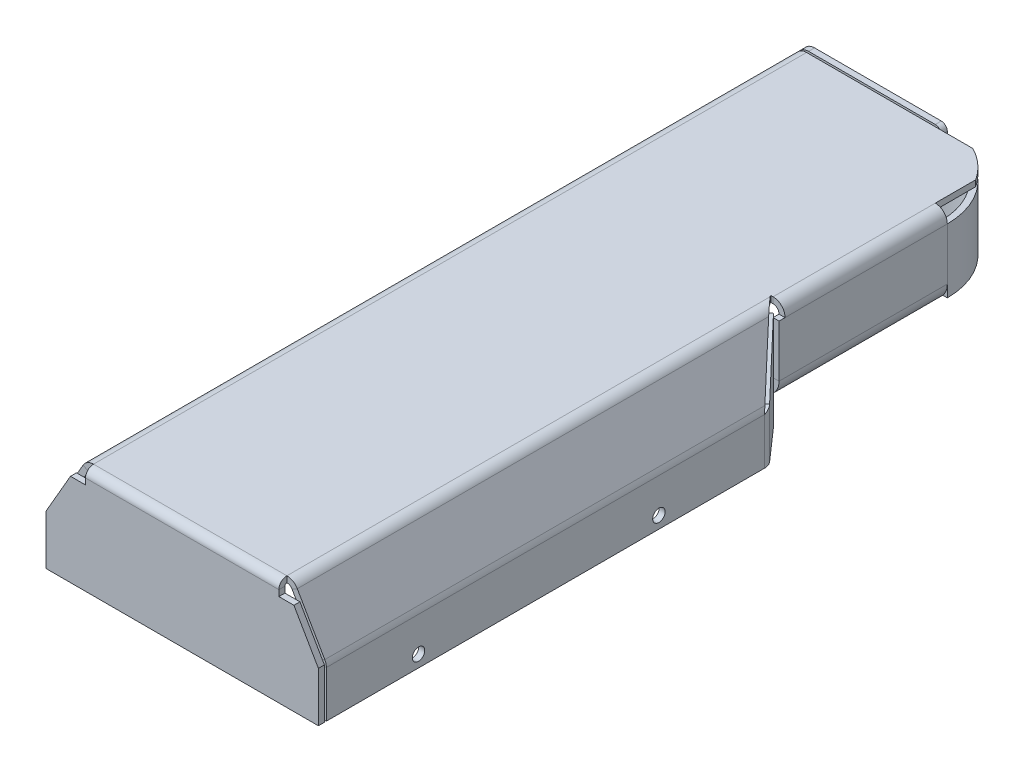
ISO-10303-21;
HEADER;
FILE_DESCRIPTION(('STEP AP214'),'2;1');
FILE_NAME('part.step','',(''),(''),'','','');
FILE_SCHEMA(('AUTOMOTIVE_DESIGN { 1 0 10303 214 1 1 1 1 }'));
ENDSEC;
DATA;
#1=APPLICATION_CONTEXT('core data for automotive mechanical design processes');
#2=APPLICATION_PROTOCOL_DEFINITION('international standard','automotive_design',2000,#1);
#3=PRODUCT_CONTEXT('',#1,'mechanical');
#4=PRODUCT('Part','Part','',(#3));
#5=PRODUCT_RELATED_PRODUCT_CATEGORY('part','',(#4));
#6=PRODUCT_DEFINITION_FORMATION('','',#4);
#7=PRODUCT_DEFINITION_CONTEXT('part definition',#1,'design');
#8=PRODUCT_DEFINITION('design','',#6,#7);
#9=PRODUCT_DEFINITION_SHAPE('','',#8);
#10=(LENGTH_UNIT() NAMED_UNIT(*) SI_UNIT(.MILLI.,.METRE.));
#11=(NAMED_UNIT(*) PLANE_ANGLE_UNIT() SI_UNIT($,.RADIAN.));
#12=(NAMED_UNIT(*) SI_UNIT($,.STERADIAN.) SOLID_ANGLE_UNIT());
#13=UNCERTAINTY_MEASURE_WITH_UNIT(LENGTH_MEASURE(1.E-05),#10,'distance_accuracy_value','');
#14=(GEOMETRIC_REPRESENTATION_CONTEXT(3) GLOBAL_UNCERTAINTY_ASSIGNED_CONTEXT((#13)) GLOBAL_UNIT_ASSIGNED_CONTEXT((#10,
#11,#12)) REPRESENTATION_CONTEXT('',''));
#15=CARTESIAN_POINT('',(0.,0.,0.));
#16=DIRECTION('',(0.,0.,1.));
#17=DIRECTION('',(1.,0.,0.));
#18=AXIS2_PLACEMENT_3D('',#15,#16,#17);
#19=CARTESIAN_POINT('',(0.,0.,-2.00000000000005));
#20=DIRECTION('',(0.,0.,1.));
#21=DIRECTION('',(1.,0.,0.));
#22=AXIS2_PLACEMENT_3D('',#19,#20,#21);
#23=PLANE('',#22);
#24=DIRECTION('',(1.,0.,0.));
#25=VECTOR('',#24,1.);
#26=CARTESIAN_POINT('',(-33.9999999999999,4.49999999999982,-2.00000000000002));
#27=LINE('',#26,#25);
#28=CARTESIAN_POINT('',(-32.4999999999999,4.49999999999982,-2.00000000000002));
#29=VERTEX_POINT('',#28);
#30=CARTESIAN_POINT('',(7.50000000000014,4.49999999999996,-2.00000000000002));
#31=VERTEX_POINT('',#30);
#32=EDGE_CURVE('E624',#29,#31,#27,.T.);
#33=ORIENTED_EDGE('',*,*,#32,.F.);
#34=CARTESIAN_POINT('',(-32.4999999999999,5.99999999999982,-2.00000000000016));
#35=DIRECTION('',(0.,0.,1.));
#36=DIRECTION('',(1.,0.,0.));
#37=AXIS2_PLACEMENT_3D('',#34,#35,#36);
#38=CIRCLE('',#37,1.5);
#39=CARTESIAN_POINT('',(-33.9999999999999,5.99999999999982,-2.00000000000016));
#40=VERTEX_POINT('',#39);
#41=EDGE_CURVE('E2177',#29,#40,#38,.F.);
#42=ORIENTED_EDGE('',*,*,#41,.T.);
#43=DIRECTION('',(0.,1.,0.));
#44=VECTOR('',#43,1.);
#45=CARTESIAN_POINT('',(-33.9999999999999,-1.1666015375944E-13,-2.00000000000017));
#46=LINE('',#45,#44);
#47=CARTESIAN_POINT('',(-34.,11.6076951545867,-2.00000000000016));
#48=VERTEX_POINT('',#47);
#49=EDGE_CURVE('E716',#40,#48,#46,.T.);
#50=ORIENTED_EDGE('',*,*,#49,.T.);
#51=CARTESIAN_POINT('',(-31.,11.6076951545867,-2.00000000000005));
#52=DIRECTION('',(0.,0.,-1.));
#53=DIRECTION('',(-1.,0.,0.));
#54=AXIS2_PLACEMENT_3D('',#51,#52,#53);
#55=CIRCLE('',#54,3.);
#56=CARTESIAN_POINT('',(-33.5980762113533,13.1076951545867,-2.00000000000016));
#57=VERTEX_POINT('',#56);
#58=EDGE_CURVE('E634',#48,#57,#55,.T.);
#59=ORIENTED_EDGE('',*,*,#58,.T.);
#60=DIRECTION('',(0.499999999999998,0.86602540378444,0.));
#61=VECTOR('',#60,1.);
#62=CARTESIAN_POINT('',(-27.5980762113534,23.4999999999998,-2.00000000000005));
#63=LINE('',#62,#61);
#64=CARTESIAN_POINT('',(-26.7320508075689,25.,-2.00000000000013));
#65=VERTEX_POINT('',#64);
#66=EDGE_CURVE('E631',#57,#65,#63,.T.);
#67=ORIENTED_EDGE('',*,*,#66,.T.);
#68=CARTESIAN_POINT('',(-24.1339745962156,23.5,-2.00000000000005));
#69=DIRECTION('',(0.,0.,-1.));
#70=DIRECTION('',(-1.,0.,0.));
#71=AXIS2_PLACEMENT_3D('',#68,#69,#70);
#72=CIRCLE('',#71,3.);
#73=CARTESIAN_POINT('',(-24.1339745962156,26.4999999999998,-2.00000000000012));
#74=VERTEX_POINT('',#73);
#75=EDGE_CURVE('E607',#65,#74,#72,.T.);
#76=ORIENTED_EDGE('',*,*,#75,.T.);
#77=DIRECTION('',(-1.,0.,0.));
#78=VECTOR('',#77,1.);
#79=CARTESIAN_POINT('',(-27.5980762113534,26.4999999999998,-2.00000000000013));
#80=LINE('',#79,#78);
#81=CARTESIAN_POINT('',(7.50000000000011,26.4999999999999,-2.00000000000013));
#82=VERTEX_POINT('',#81);
#83=EDGE_CURVE('E622',#82,#74,#80,.T.);
#84=ORIENTED_EDGE('',*,*,#83,.F.);
#85=CARTESIAN_POINT('',(7.50000000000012,24.9999999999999,-2.00000000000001));
#86=DIRECTION('',(0.,0.,1.));
#87=DIRECTION('',(1.,0.,0.));
#88=AXIS2_PLACEMENT_3D('',#85,#86,#87);
#89=CIRCLE('',#88,1.5);
#90=CARTESIAN_POINT('',(9.00000000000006,25.,-2.00000000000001));
#91=VERTEX_POINT('',#90);
#92=EDGE_CURVE('E2179',#82,#91,#89,.F.);
#93=ORIENTED_EDGE('',*,*,#92,.T.);
#94=DIRECTION('',(0.,-1.,0.));
#95=VECTOR('',#94,1.);
#96=CARTESIAN_POINT('',(9.00000000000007,23.4999999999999,-2.00000000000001));
#97=LINE('',#96,#95);
#98=CARTESIAN_POINT('',(9.00000000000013,5.99999999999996,-2.00000000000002));
#99=VERTEX_POINT('',#98);
#100=EDGE_CURVE('E166',#99,#91,#97,.F.);
#101=ORIENTED_EDGE('',*,*,#100,.F.);
#102=CARTESIAN_POINT('',(7.50000000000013,5.99999999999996,-2.00000000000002));
#103=DIRECTION('',(0.,0.,1.));
#104=DIRECTION('',(1.,0.,0.));
#105=AXIS2_PLACEMENT_3D('',#102,#103,#104);
#106=CIRCLE('',#105,1.5);
#107=EDGE_CURVE('E2121',#99,#31,#106,.F.);
#108=ORIENTED_EDGE('',*,*,#107,.T.);
#109=EDGE_LOOP('',(#33,#42,#50,#59,#67,#76,#84,#93,#101,#108));
#110=FACE_BOUND('',#109,.T.);
#111=ADVANCED_FACE('F148',(#110),#23,.F.);
#112=CARTESIAN_POINT('',(0.,0.,-0.500000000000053));
#113=DIRECTION('',(0.,0.,1.));
#114=DIRECTION('',(1.,0.,0.));
#115=AXIS2_PLACEMENT_3D('',#112,#113,#114);
#116=PLANE('',#115);
#117=DIRECTION('',(0.,-1.,0.));
#118=VECTOR('',#117,1.);
#119=CARTESIAN_POINT('',(-34.,23.4999999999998,-0.500000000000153));
#120=LINE('',#119,#118);
#121=CARTESIAN_POINT('',(-33.9999999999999,5.99999999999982,-0.500000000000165));
#122=VERTEX_POINT('',#121);
#123=CARTESIAN_POINT('',(-34.,11.6076951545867,-0.500000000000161));
#124=VERTEX_POINT('',#123);
#125=EDGE_CURVE('E719',#122,#124,#120,.F.);
#126=ORIENTED_EDGE('',*,*,#125,.F.);
#127=CARTESIAN_POINT('',(-32.4999999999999,5.99999999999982,-0.50000000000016));
#128=DIRECTION('',(0.,0.,1.));
#129=DIRECTION('',(1.,0.,0.));
#130=AXIS2_PLACEMENT_3D('',#127,#128,#129);
#131=CIRCLE('',#130,1.5);
#132=CARTESIAN_POINT('',(-32.4999999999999,4.49999999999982,-0.500000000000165));
#133=VERTEX_POINT('',#132);
#134=EDGE_CURVE('E2168',#122,#133,#131,.T.);
#135=ORIENTED_EDGE('',*,*,#134,.T.);
#136=DIRECTION('',(-1.,0.,0.));
#137=VECTOR('',#136,1.);
#138=CARTESIAN_POINT('',(-33.9999999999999,4.49999999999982,-0.500000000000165));
#139=LINE('',#138,#137);
#140=CARTESIAN_POINT('',(7.50000000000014,4.49999999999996,-0.500000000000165));
#141=VERTEX_POINT('',#140);
#142=EDGE_CURVE('E627',#141,#133,#139,.T.);
#143=ORIENTED_EDGE('',*,*,#142,.F.);
#144=CARTESIAN_POINT('',(7.50000000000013,5.99999999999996,-0.500000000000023));
#145=DIRECTION('',(0.,0.,1.));
#146=DIRECTION('',(1.,0.,0.));
#147=AXIS2_PLACEMENT_3D('',#144,#145,#146);
#148=CIRCLE('',#147,1.5);
#149=CARTESIAN_POINT('',(9.00000000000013,5.99999999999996,-0.500000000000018));
#150=VERTEX_POINT('',#149);
#151=EDGE_CURVE('E2120',#141,#150,#148,.T.);
#152=ORIENTED_EDGE('',*,*,#151,.T.);
#153=DIRECTION('',(0.,-1.,0.));
#154=VECTOR('',#153,1.);
#155=CARTESIAN_POINT('',(9.00000000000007,23.4999999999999,-0.500000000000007));
#156=LINE('',#155,#154);
#157=CARTESIAN_POINT('',(9.00000000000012,24.9999999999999,-0.500000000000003));
#158=VERTEX_POINT('',#157);
#159=EDGE_CURVE('E715',#158,#150,#156,.T.);
#160=ORIENTED_EDGE('',*,*,#159,.F.);
#161=CARTESIAN_POINT('',(7.50000000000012,24.9999999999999,-0.500000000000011));
#162=DIRECTION('',(0.,0.,1.));
#163=DIRECTION('',(1.,0.,0.));
#164=AXIS2_PLACEMENT_3D('',#161,#162,#163);
#165=CIRCLE('',#164,1.5);
#166=CARTESIAN_POINT('',(7.50000000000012,26.4999999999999,-0.500000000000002));
#167=VERTEX_POINT('',#166);
#168=EDGE_CURVE('E2172',#158,#167,#165,.T.);
#169=ORIENTED_EDGE('',*,*,#168,.T.);
#170=DIRECTION('',(1.,0.,0.));
#171=VECTOR('',#170,1.);
#172=CARTESIAN_POINT('',(-27.5980762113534,26.4999999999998,-0.500000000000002));
#173=LINE('',#172,#171);
#174=CARTESIAN_POINT('',(-24.1339745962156,26.4999999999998,-0.500000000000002));
#175=VERTEX_POINT('',#174);
#176=EDGE_CURVE('E617',#175,#167,#173,.T.);
#177=ORIENTED_EDGE('',*,*,#176,.F.);
#178=CARTESIAN_POINT('',(-24.1339745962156,23.5,-0.500000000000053));
#179=DIRECTION('',(0.,0.,-1.));
#180=DIRECTION('',(1.,0.,0.));
#181=AXIS2_PLACEMENT_3D('',#178,#179,#180);
#182=CIRCLE('',#181,3.);
#183=CARTESIAN_POINT('',(-26.7320508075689,25.,-0.500000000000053));
#184=VERTEX_POINT('',#183);
#185=EDGE_CURVE('E611',#184,#175,#182,.T.);
#186=ORIENTED_EDGE('',*,*,#185,.F.);
#187=DIRECTION('',(0.499999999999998,0.86602540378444,0.));
#188=VECTOR('',#187,1.);
#189=CARTESIAN_POINT('',(-27.5980762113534,23.4999999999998,-0.500000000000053));
#190=LINE('',#189,#188);
#191=CARTESIAN_POINT('',(-33.5980762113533,13.1076951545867,-0.500000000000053));
#192=VERTEX_POINT('',#191);
#193=EDGE_CURVE('E637',#192,#184,#190,.T.);
#194=ORIENTED_EDGE('',*,*,#193,.F.);
#195=CARTESIAN_POINT('',(-31.,11.6076951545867,-0.500000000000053));
#196=DIRECTION('',(0.,0.,-1.));
#197=DIRECTION('',(1.,0.,0.));
#198=AXIS2_PLACEMENT_3D('',#195,#196,#197);
#199=CIRCLE('',#198,3.);
#200=EDGE_CURVE('E630',#124,#192,#199,.T.);
#201=ORIENTED_EDGE('',*,*,#200,.F.);
#202=EDGE_LOOP('',(#126,#135,#143,#152,#160,#169,#177,#186,#194,#201));
#203=FACE_BOUND('',#202,.T.);
#204=ADVANCED_FACE('F870',(#203),#116,.T.);
#205=CARTESIAN_POINT('',(26.0000000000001,10.5,16.5));
#206=DIRECTION('',(0.,0.,1.));
#207=DIRECTION('',(0.,-1.,0.));
#208=AXIS2_PLACEMENT_3D('',#205,#206,#207);
#209=PLANE('',#208);
#210=DIRECTION('',(0.,1.,0.));
#211=VECTOR('',#210,1.);
#212=CARTESIAN_POINT('',(27.5000000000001,0.,16.5));
#213=LINE('',#212,#211);
#214=CARTESIAN_POINT('',(27.5000000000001,7.50000000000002,16.5));
#215=VERTEX_POINT('',#214);
#216=CARTESIAN_POINT('',(27.5000000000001,10.5,16.5));
#217=VERTEX_POINT('',#216);
#218=EDGE_CURVE('E739',#215,#217,#213,.T.);
#219=ORIENTED_EDGE('',*,*,#218,.T.);
#220=CARTESIAN_POINT('',(23.0000000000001,10.5,16.5));
#221=DIRECTION('',(0.,0.,1.));
#222=DIRECTION('',(1.,0.,0.));
#223=AXIS2_PLACEMENT_3D('',#220,#221,#222);
#224=CIRCLE('',#223,4.5);
#225=CARTESIAN_POINT('',(26.3541019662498,7.5,16.5));
#226=VERTEX_POINT('',#225);
#227=EDGE_CURVE('E682',#217,#226,#224,.F.);
#228=ORIENTED_EDGE('',*,*,#227,.T.);
#229=DIRECTION('',(-1.,0.,0.));
#230=VECTOR('',#229,1.);
#231=CARTESIAN_POINT('',(27.5000000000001,7.50000000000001,16.5));
#232=LINE('',#231,#230);
#233=EDGE_CURVE('E734',#215,#226,#232,.T.);
#234=ORIENTED_EDGE('',*,*,#233,.F.);
#235=EDGE_LOOP('',(#219,#228,#234));
#236=FACE_BOUND('',#235,.T.);
#237=ADVANCED_FACE('F875',(#236),#209,.T.);
#238=CARTESIAN_POINT('',(27.5000000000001,0.,0.));
#239=DIRECTION('',(-1.,0.,0.));
#240=DIRECTION('',(0.,-1.,0.));
#241=AXIS2_PLACEMENT_3D('',#238,#239,#240);
#242=PLANE('',#241);
#243=DIRECTION('',(0.,0.,1.));
#244=VECTOR('',#243,1.);
#245=CARTESIAN_POINT('',(27.5000000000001,10.5,58.5));
#246=LINE('',#245,#244);
#247=CARTESIAN_POINT('',(27.5000000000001,10.5,58.5));
#248=VERTEX_POINT('',#247);
#249=EDGE_CURVE('E677',#248,#217,#246,.F.);
#250=ORIENTED_EDGE('',*,*,#249,.T.);
#251=CARTESIAN_POINT('',(27.5,23.5,16.5));
#252=VERTEX_POINT('',#251);
#253=EDGE_CURVE('E742',#217,#252,#213,.T.);
#254=ORIENTED_EDGE('',*,*,#253,.T.);
#255=DIRECTION('',(0.,0.,1.));
#256=VECTOR('',#255,1.);
#257=CARTESIAN_POINT('',(27.5,23.5,57.));
#258=LINE('',#257,#256);
#259=CARTESIAN_POINT('',(27.5,23.5,57.));
#260=VERTEX_POINT('',#259);
#261=EDGE_CURVE('E763',#252,#260,#258,.T.);
#262=ORIENTED_EDGE('',*,*,#261,.T.);
#263=DIRECTION('',(0.,0.,1.));
#264=VECTOR('',#263,1.);
#265=CARTESIAN_POINT('',(27.5,23.5,16.5));
#266=LINE('',#265,#264);
#267=CARTESIAN_POINT('',(27.5,23.5,58.5));
#268=VERTEX_POINT('',#267);
#269=EDGE_CURVE('E747',#268,#260,#266,.F.);
#270=ORIENTED_EDGE('',*,*,#269,.F.);
#271=DIRECTION('',(0.,1.,0.));
#272=VECTOR('',#271,1.);
#273=CARTESIAN_POINT('',(27.5,23.5,58.5));
#274=LINE('',#273,#272);
#275=EDGE_CURVE('E705',#248,#268,#274,.T.);
#276=ORIENTED_EDGE('',*,*,#275,.F.);
#277=EDGE_LOOP('',(#250,#254,#262,#270,#276));
#278=FACE_BOUND('',#277,.T.);
#279=ADVANCED_FACE('F1809',(#278),#242,.F.);
#280=CARTESIAN_POINT('',(26.0000000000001,0.,0.));
#281=DIRECTION('',(-1.,0.,0.));
#282=DIRECTION('',(0.,-1.,0.));
#283=AXIS2_PLACEMENT_3D('',#280,#281,#282);
#284=PLANE('',#283);
#285=DIRECTION('',(0.,-1.,0.));
#286=VECTOR('',#285,1.);
#287=CARTESIAN_POINT('',(26.,25.,16.5));
#288=LINE('',#287,#286);
#289=CARTESIAN_POINT('',(26.0000000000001,10.5,16.5));
#290=VERTEX_POINT('',#289);
#291=CARTESIAN_POINT('',(26.0000000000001,23.5,16.5));
#292=VERTEX_POINT('',#291);
#293=EDGE_CURVE('E746',#290,#292,#288,.F.);
#294=ORIENTED_EDGE('',*,*,#293,.F.);
#295=DIRECTION('',(0.,0.,1.));
#296=VECTOR('',#295,1.);
#297=CARTESIAN_POINT('',(26.0000000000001,10.5,58.5));
#298=LINE('',#297,#296);
#299=CARTESIAN_POINT('',(26.0000000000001,10.5,58.5));
#300=VERTEX_POINT('',#299);
#301=EDGE_CURVE('E691',#300,#290,#298,.F.);
#302=ORIENTED_EDGE('',*,*,#301,.F.);
#303=DIRECTION('',(0.,-1.,0.));
#304=VECTOR('',#303,1.);
#305=CARTESIAN_POINT('',(26.0000000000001,23.5,58.5));
#306=LINE('',#305,#304);
#307=CARTESIAN_POINT('',(26.0000000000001,23.5,58.5));
#308=VERTEX_POINT('',#307);
#309=EDGE_CURVE('E712',#308,#300,#306,.T.);
#310=ORIENTED_EDGE('',*,*,#309,.F.);
#311=DIRECTION('',(0.,0.,1.));
#312=VECTOR('',#311,1.);
#313=CARTESIAN_POINT('',(26.,23.5,16.5));
#314=LINE('',#313,#312);
#315=CARTESIAN_POINT('',(26.,23.5,57.));
#316=VERTEX_POINT('',#315);
#317=EDGE_CURVE('E752',#316,#308,#314,.T.);
#318=ORIENTED_EDGE('',*,*,#317,.F.);
#319=EDGE_CURVE('E749',#292,#316,#314,.T.);
#320=ORIENTED_EDGE('',*,*,#319,.F.);
#321=EDGE_LOOP('',(#294,#302,#310,#318,#320));
#322=FACE_BOUND('',#321,.T.);
#323=ADVANCED_FACE('F1820',(#322),#284,.T.);
#324=CARTESIAN_POINT('',(0.,0.,58.5));
#325=DIRECTION('',(0.,0.,-1.));
#326=DIRECTION('',(-1.,0.,0.));
#327=AXIS2_PLACEMENT_3D('',#324,#325,#326);
#328=PLANE('',#327);
#329=DIRECTION('',(1.,0.,0.));
#330=VECTOR('',#329,1.);
#331=CARTESIAN_POINT('',(26.0000000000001,10.5,58.5));
#332=LINE('',#331,#330);
#333=EDGE_CURVE('E685',#300,#248,#332,.T.);
#334=ORIENTED_EDGE('',*,*,#333,.T.);
#335=ORIENTED_EDGE('',*,*,#275,.T.);
#336=DIRECTION('',(-1.,0.,0.));
#337=VECTOR('',#336,1.);
#338=CARTESIAN_POINT('',(27.5,23.5,58.5));
#339=LINE('',#338,#337);
#340=EDGE_CURVE('E709',#268,#308,#339,.T.);
#341=ORIENTED_EDGE('',*,*,#340,.T.);
#342=ORIENTED_EDGE('',*,*,#309,.T.);
#343=EDGE_LOOP('',(#334,#335,#341,#342));
#344=FACE_BOUND('',#343,.T.);
#345=ADVANCED_FACE('F880',(#344),#328,.F.);
#346=CARTESIAN_POINT('',(-25.,25.,178.));
#347=DIRECTION('',(0.,-1.,0.));
#348=DIRECTION('',(0.,0.,-1.));
#349=AXIS2_PLACEMENT_3D('',#346,#347,#348);
#350=PLANE('',#349);
#351=DIRECTION('',(-1.,0.,0.));
#352=VECTOR('',#351,1.);
#353=CARTESIAN_POINT('',(-25.,25.,0.));
#354=LINE('',#353,#352);
#355=CARTESIAN_POINT('',(17.3666002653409,25.,0.));
#356=VERTEX_POINT('',#355);
#357=CARTESIAN_POINT('',(-24.1339745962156,25.,0.));
#358=VERTEX_POINT('',#357);
#359=EDGE_CURVE('E2285',#356,#358,#354,.T.);
#360=ORIENTED_EDGE('',*,*,#359,.F.);
#361=CARTESIAN_POINT('',(9.00000000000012,25.,16.5));
#362=DIRECTION('',(0.,1.,0.));
#363=DIRECTION('',(0.,0.,-1.));
#364=AXIS2_PLACEMENT_3D('',#361,#362,#363);
#365=CIRCLE('',#364,18.5);
#366=CARTESIAN_POINT('',(24.5,25.,6.40049506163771));
#367=VERTEX_POINT('',#366);
#368=EDGE_CURVE('E697',#367,#356,#365,.T.);
#369=ORIENTED_EDGE('',*,*,#368,.F.);
#370=DIRECTION('',(0.,0.,-1.));
#371=VECTOR('',#370,1.);
#372=CARTESIAN_POINT('',(24.5,25.,0.));
#373=LINE('',#372,#371);
#374=CARTESIAN_POINT('',(24.5,25.,16.5));
#375=VERTEX_POINT('',#374);
#376=EDGE_CURVE('E784',#375,#367,#373,.T.);
#377=ORIENTED_EDGE('',*,*,#376,.F.);
#378=CARTESIAN_POINT('',(24.5,25.,57.));
#379=VERTEX_POINT('',#378);
#380=EDGE_CURVE('E785',#379,#375,#373,.T.);
#381=ORIENTED_EDGE('',*,*,#380,.F.);
#382=DIRECTION('',(-1.,0.,0.));
#383=VECTOR('',#382,1.);
#384=CARTESIAN_POINT('',(24.5,25.,57.));
#385=LINE('',#384,#383);
#386=CARTESIAN_POINT('',(24.,25.,57.));
#387=VERTEX_POINT('',#386);
#388=EDGE_CURVE('E788',#379,#387,#385,.T.);
#389=ORIENTED_EDGE('',*,*,#388,.T.);
#390=DIRECTION('',(0.,0.,-1.));
#391=VECTOR('',#390,1.);
#392=CARTESIAN_POINT('',(24.,25.,178.));
#393=LINE('',#392,#391);
#394=CARTESIAN_POINT('',(24.,25.,57.2172388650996));
#395=VERTEX_POINT('',#394);
#396=EDGE_CURVE('E2367',#395,#387,#393,.T.);
#397=ORIENTED_EDGE('',*,*,#396,.F.);
#398=DIRECTION('',(-0.660001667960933,0.,-0.751264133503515));
#399=VECTOR('',#398,1.);
#400=CARTESIAN_POINT('',(62.5438826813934,25.,101.090819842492));
#401=LINE('',#400,#399);
#402=CARTESIAN_POINT('',(24.1339745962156,25.,57.3697389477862));
#403=VERTEX_POINT('',#402);
#404=EDGE_CURVE('E2370',#403,#395,#401,.T.);
#405=ORIENTED_EDGE('',*,*,#404,.F.);
#406=DIRECTION('',(0.,0.,-1.));
#407=VECTOR('',#406,1.);
#408=CARTESIAN_POINT('',(24.1339745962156,25.,178.));
#409=LINE('',#408,#407);
#410=CARTESIAN_POINT('',(24.1339745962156,25.,178.));
#411=VERTEX_POINT('',#410);
#412=EDGE_CURVE('E2230',#411,#403,#409,.T.);
#413=ORIENTED_EDGE('',*,*,#412,.F.);
#414=DIRECTION('',(-1.,0.,0.));
#415=VECTOR('',#414,1.);
#416=CARTESIAN_POINT('',(-25.,25.,178.));
#417=LINE('',#416,#415);
#418=CARTESIAN_POINT('',(-24.1339745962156,25.,178.));
#419=VERTEX_POINT('',#418);
#420=EDGE_CURVE('E2343',#411,#419,#417,.T.);
#421=ORIENTED_EDGE('',*,*,#420,.T.);
#422=DIRECTION('',(0.,0.,-1.));
#423=VECTOR('',#422,1.);
#424=CARTESIAN_POINT('',(-24.1339745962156,25.,178.));
#425=LINE('',#424,#423);
#426=EDGE_CURVE('E2227',#419,#358,#425,.T.);
#427=ORIENTED_EDGE('',*,*,#426,.T.);
#428=EDGE_LOOP('',(#360,#369,#377,#381,#389,#397,#405,#413,#421,#427));
#429=FACE_BOUND('',#428,.T.);
#430=ADVANCED_FACE('F1011',(#429),#350,.T.);
#431=CARTESIAN_POINT('',(-25.,26.5,178.));
#432=DIRECTION('',(0.,-1.,0.));
#433=DIRECTION('',(0.,0.,-1.));
#434=AXIS2_PLACEMENT_3D('',#431,#432,#433);
#435=PLANE('',#434);
#436=CARTESIAN_POINT('',(9.00000000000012,26.5,16.5));
#437=DIRECTION('',(0.,1.,0.));
#438=DIRECTION('',(0.,0.,1.));
#439=AXIS2_PLACEMENT_3D('',#436,#437,#438);
#440=CIRCLE('',#439,18.5);
#441=CARTESIAN_POINT('',(24.5,26.5,6.40049506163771));
#442=VERTEX_POINT('',#441);
#443=CARTESIAN_POINT('',(17.3666002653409,26.5,0.));
#444=VERTEX_POINT('',#443);
#445=EDGE_CURVE('E698',#442,#444,#440,.T.);
#446=ORIENTED_EDGE('',*,*,#445,.T.);
#447=DIRECTION('',(1.,0.,0.));
#448=VECTOR('',#447,1.);
#449=CARTESIAN_POINT('',(-25.,26.5,0.));
#450=LINE('',#449,#448);
#451=CARTESIAN_POINT('',(-24.1339745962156,26.5,0.));
#452=VERTEX_POINT('',#451);
#453=EDGE_CURVE('E2283',#444,#452,#450,.F.);
#454=ORIENTED_EDGE('',*,*,#453,.T.);
#455=DIRECTION('',(0.,0.,-1.));
#456=VECTOR('',#455,1.);
#457=CARTESIAN_POINT('',(-24.1339745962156,26.5,178.));
#458=LINE('',#457,#456);
#459=CARTESIAN_POINT('',(-24.1339745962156,26.5,178.));
#460=VERTEX_POINT('',#459);
#461=EDGE_CURVE('E2260',#460,#452,#458,.T.);
#462=ORIENTED_EDGE('',*,*,#461,.F.);
#463=DIRECTION('',(1.,0.,0.));
#464=VECTOR('',#463,1.);
#465=CARTESIAN_POINT('',(-25.,26.5,178.));
#466=LINE('',#465,#464);
#467=CARTESIAN_POINT('',(24.1339745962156,26.5,178.));
#468=VERTEX_POINT('',#467);
#469=EDGE_CURVE('E2314',#468,#460,#466,.F.);
#470=ORIENTED_EDGE('',*,*,#469,.F.);
#471=DIRECTION('',(0.,0.,-1.));
#472=VECTOR('',#471,1.);
#473=CARTESIAN_POINT('',(24.1339745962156,26.5,178.));
#474=LINE('',#473,#472);
#475=CARTESIAN_POINT('',(24.1339745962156,26.5,57.3697389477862));
#476=VERTEX_POINT('',#475);
#477=EDGE_CURVE('E2257',#468,#476,#474,.T.);
#478=ORIENTED_EDGE('',*,*,#477,.T.);
#479=DIRECTION('',(-0.660001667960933,0.,-0.751264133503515));
#480=VECTOR('',#479,1.);
#481=CARTESIAN_POINT('',(62.5438826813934,26.5,101.090819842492));
#482=LINE('',#481,#480);
#483=CARTESIAN_POINT('',(24.,26.5,57.2172388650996));
#484=VERTEX_POINT('',#483);
#485=EDGE_CURVE('E2369',#476,#484,#482,.T.);
#486=ORIENTED_EDGE('',*,*,#485,.T.);
#487=DIRECTION('',(0.,0.,-1.));
#488=VECTOR('',#487,1.);
#489=CARTESIAN_POINT('',(24.,26.5,178.));
#490=LINE('',#489,#488);
#491=CARTESIAN_POINT('',(24.,26.5,57.));
#492=VERTEX_POINT('',#491);
#493=EDGE_CURVE('E2365',#484,#492,#490,.T.);
#494=ORIENTED_EDGE('',*,*,#493,.T.);
#495=DIRECTION('',(-1.,0.,0.));
#496=VECTOR('',#495,1.);
#497=CARTESIAN_POINT('',(24.5,26.5,57.));
#498=LINE('',#497,#496);
#499=CARTESIAN_POINT('',(24.5,26.5,57.));
#500=VERTEX_POINT('',#499);
#501=EDGE_CURVE('E793',#500,#492,#498,.T.);
#502=ORIENTED_EDGE('',*,*,#501,.F.);
#503=DIRECTION('',(0.,0.,1.));
#504=VECTOR('',#503,1.);
#505=CARTESIAN_POINT('',(24.5,26.5,57.));
#506=LINE('',#505,#504);
#507=CARTESIAN_POINT('',(24.5,26.5,16.5));
#508=VERTEX_POINT('',#507);
#509=EDGE_CURVE('E755',#500,#508,#506,.F.);
#510=ORIENTED_EDGE('',*,*,#509,.T.);
#511=DIRECTION('',(0.,0.,1.));
#512=VECTOR('',#511,1.);
#513=CARTESIAN_POINT('',(24.5,26.5,0.));
#514=LINE('',#513,#512);
#515=EDGE_CURVE('E779',#442,#508,#514,.T.);
#516=ORIENTED_EDGE('',*,*,#515,.F.);
#517=EDGE_LOOP('',(#446,#454,#462,#470,#478,#486,#494,#502,#510,#516));
#518=FACE_BOUND('',#517,.T.);
#519=ADVANCED_FACE('F973',(#518),#435,.F.);
#520=CARTESIAN_POINT('',(-26.7320508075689,25.,0.));
#521=DIRECTION('',(0.,0.,-1.));
#522=DIRECTION('',(-1.,0.,0.));
#523=AXIS2_PLACEMENT_3D('',#520,#521,#522);
#524=PLANE('',#523);
#525=ORIENTED_EDGE('',*,*,#453,.F.);
#526=DIRECTION('',(0.,-1.,0.));
#527=VECTOR('',#526,1.);
#528=CARTESIAN_POINT('',(17.3666002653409,25.,0.));
#529=LINE('',#528,#527);
#530=EDGE_CURVE('E703',#356,#444,#529,.F.);
#531=ORIENTED_EDGE('',*,*,#530,.F.);
#532=ORIENTED_EDGE('',*,*,#359,.T.);
#533=DIRECTION('',(0.,1.,0.));
#534=VECTOR('',#533,1.);
#535=CARTESIAN_POINT('',(-24.1339745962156,25.,0.));
#536=LINE('',#535,#534);
#537=EDGE_CURVE('E2200',#358,#452,#536,.T.);
#538=ORIENTED_EDGE('',*,*,#537,.T.);
#539=EDGE_LOOP('',(#525,#531,#532,#538));
#540=FACE_BOUND('',#539,.T.);
#541=ADVANCED_FACE('F969',(#540),#524,.T.);
#542=CARTESIAN_POINT('',(24.5,0.,0.));
#543=DIRECTION('',(1.,0.,0.));
#544=DIRECTION('',(0.,0.,-1.));
#545=AXIS2_PLACEMENT_3D('',#542,#543,#544);
#546=PLANE('',#545);
#547=ORIENTED_EDGE('',*,*,#376,.T.);
#548=DIRECTION('',(0.,-1.,0.));
#549=VECTOR('',#548,1.);
#550=CARTESIAN_POINT('',(24.5,25.,6.40049506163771));
#551=LINE('',#550,#549);
#552=EDGE_CURVE('E701',#367,#442,#551,.F.);
#553=ORIENTED_EDGE('',*,*,#552,.T.);
#554=ORIENTED_EDGE('',*,*,#515,.T.);
#555=DIRECTION('',(0.,1.,0.));
#556=VECTOR('',#555,1.);
#557=CARTESIAN_POINT('',(24.5,25.,16.5));
#558=LINE('',#557,#556);
#559=EDGE_CURVE('E762',#375,#508,#558,.T.);
#560=ORIENTED_EDGE('',*,*,#559,.F.);
#561=EDGE_LOOP('',(#547,#553,#554,#560));
#562=FACE_BOUND('',#561,.T.);
#563=ADVANCED_FACE('F972',(#562),#546,.T.);
#564=CARTESIAN_POINT('',(24.,25.,178.));
#565=DIRECTION('',(-1.,0.,0.));
#566=DIRECTION('',(0.,0.,-1.));
#567=AXIS2_PLACEMENT_3D('',#564,#565,#566);
#568=PLANE('',#567);
#569=ORIENTED_EDGE('',*,*,#396,.T.);
#570=DIRECTION('',(0.,-1.,0.));
#571=VECTOR('',#570,1.);
#572=CARTESIAN_POINT('',(24.,25.,57.));
#573=LINE('',#572,#571);
#574=EDGE_CURVE('E778',#492,#387,#573,.T.);
#575=ORIENTED_EDGE('',*,*,#574,.F.);
#576=ORIENTED_EDGE('',*,*,#493,.F.);
#577=DIRECTION('',(0.,-1.,0.));
#578=VECTOR('',#577,1.);
#579=CARTESIAN_POINT('',(24.,25.,57.2172388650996));
#580=LINE('',#579,#578);
#581=EDGE_CURVE('E2305',#395,#484,#580,.F.);
#582=ORIENTED_EDGE('',*,*,#581,.F.);
#583=EDGE_LOOP('',(#569,#575,#576,#582));
#584=FACE_BOUND('',#583,.T.);
#585=ADVANCED_FACE('F1019',(#584),#568,.F.);
#586=CARTESIAN_POINT('',(24.1339745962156,23.5,178.));
#587=DIRECTION('',(0.,0.,-1.));
#588=DIRECTION('',(-1.,0.,0.));
#589=AXIS2_PLACEMENT_3D('',#586,#587,#588);
#590=CYLINDRICAL_SURFACE('',#589,1.5);
#591=ORIENTED_EDGE('',*,*,#412,.T.);
#592=CARTESIAN_POINT('',(24.1339745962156,23.5,57.3697389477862));
#593=DIRECTION('',(-0.915564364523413,0.,0.402171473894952));
#594=DIRECTION('',(-0.402171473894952,0.,-0.915564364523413));
#595=AXIS2_PLACEMENT_3D('',#592,#593,#594);
#596=ELLIPSE('',#595,3.7297523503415,1.5);
#597=CARTESIAN_POINT('',(25.4330127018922,24.25,60.3270670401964));
#598=VERTEX_POINT('',#597);
#599=EDGE_CURVE('E2384',#598,#403,#596,.T.);
#600=ORIENTED_EDGE('',*,*,#599,.F.);
#601=DIRECTION('',(0.,0.,-1.));
#602=VECTOR('',#601,1.);
#603=CARTESIAN_POINT('',(25.4330127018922,24.25,178.));
#604=LINE('',#603,#602);
#605=CARTESIAN_POINT('',(25.4330127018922,24.25,178.));
#606=VERTEX_POINT('',#605);
#607=EDGE_CURVE('E2233',#606,#598,#604,.T.);
#608=ORIENTED_EDGE('',*,*,#607,.F.);
#609=CARTESIAN_POINT('',(24.1339745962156,23.5,178.));
#610=DIRECTION('',(0.,0.,1.));
#611=DIRECTION('',(1.,0.,0.));
#612=AXIS2_PLACEMENT_3D('',#609,#610,#611);
#613=CIRCLE('',#612,1.5);
#614=EDGE_CURVE('E2340',#606,#411,#613,.T.);
#615=ORIENTED_EDGE('',*,*,#614,.T.);
#616=EDGE_LOOP('',(#591,#600,#608,#615));
#617=FACE_BOUND('',#616,.T.);
#618=ADVANCED_FACE('F1015',(#617),#590,.F.);
#619=CARTESIAN_POINT('',(32.5,12.0096189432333,178.));
#620=DIRECTION('',(-0.86602540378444,-0.499999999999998,0.));
#621=DIRECTION('',(0.499999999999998,-0.86602540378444,0.));
#622=AXIS2_PLACEMENT_3D('',#619,#620,#621);
#623=PLANE('',#622);
#624=ORIENTED_EDGE('',*,*,#607,.T.);
#625=DIRECTION('',(-0.434549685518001,0.75266213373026,-0.494637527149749));
#626=VECTOR('',#625,1.);
#627=CARTESIAN_POINT('',(56.0641058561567,-28.8046096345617,95.193708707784));
#628=LINE('',#627,#626);
#629=CARTESIAN_POINT('',(32.2990381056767,12.3576951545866,68.1424997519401));
#630=VERTEX_POINT('',#629);
#631=EDGE_CURVE('E2389',#630,#598,#628,.T.);
#632=ORIENTED_EDGE('',*,*,#631,.F.);
#633=DIRECTION('',(0.,0.,-1.));
#634=VECTOR('',#633,1.);
#635=CARTESIAN_POINT('',(32.2990381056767,12.3576951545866,178.));
#636=LINE('',#635,#634);
#637=CARTESIAN_POINT('',(32.2990381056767,12.3576951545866,178.));
#638=VERTEX_POINT('',#637);
#639=EDGE_CURVE('E2236',#638,#630,#636,.T.);
#640=ORIENTED_EDGE('',*,*,#639,.F.);
#641=DIRECTION('',(-0.499999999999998,0.86602540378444,0.));
#642=VECTOR('',#641,1.);
#643=CARTESIAN_POINT('',(32.5,12.0096189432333,178.));
#644=LINE('',#643,#642);
#645=EDGE_CURVE('E2337',#638,#606,#644,.T.);
#646=ORIENTED_EDGE('',*,*,#645,.T.);
#647=EDGE_LOOP('',(#624,#632,#640,#646));
#648=FACE_BOUND('',#647,.T.);
#649=ADVANCED_FACE('F1018',(#648),#623,.T.);
#650=CARTESIAN_POINT('',(31.,11.6076951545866,178.));
#651=DIRECTION('',(0.,0.,-1.));
#652=DIRECTION('',(-1.,0.,0.));
#653=AXIS2_PLACEMENT_3D('',#650,#651,#652);
#654=CYLINDRICAL_SURFACE('',#653,1.5);
#655=ORIENTED_EDGE('',*,*,#639,.T.);
#656=CARTESIAN_POINT('',(31.,11.6076951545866,65.1851716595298));
#657=DIRECTION('',(-0.915564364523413,0.,0.402171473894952));
#658=DIRECTION('',(-0.402171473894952,0.,-0.915564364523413));
#659=AXIS2_PLACEMENT_3D('',#656,#657,#658);
#660=ELLIPSE('',#659,3.7297523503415,1.5);
#661=CARTESIAN_POINT('',(32.5,11.6076951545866,68.6));
#662=VERTEX_POINT('',#661);
#663=EDGE_CURVE('E2397',#662,#630,#660,.T.);
#664=ORIENTED_EDGE('',*,*,#663,.F.);
#665=DIRECTION('',(0.,0.,-1.));
#666=VECTOR('',#665,1.);
#667=CARTESIAN_POINT('',(32.5,11.6076951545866,178.));
#668=LINE('',#667,#666);
#669=CARTESIAN_POINT('',(32.5,11.6076951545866,178.));
#670=VERTEX_POINT('',#669);
#671=EDGE_CURVE('E2239',#670,#662,#668,.T.);
#672=ORIENTED_EDGE('',*,*,#671,.F.);
#673=CARTESIAN_POINT('',(31.,11.6076951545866,178.));
#674=DIRECTION('',(0.,0.,1.));
#675=DIRECTION('',(1.,0.,0.));
#676=AXIS2_PLACEMENT_3D('',#673,#674,#675);
#677=CIRCLE('',#676,1.5);
#678=EDGE_CURVE('E2334',#670,#638,#677,.T.);
#679=ORIENTED_EDGE('',*,*,#678,.T.);
#680=EDGE_LOOP('',(#655,#664,#672,#679));
#681=FACE_BOUND('',#680,.T.);
#682=ADVANCED_FACE('F1023',(#681),#654,.F.);
#683=CARTESIAN_POINT('',(32.5,0.,178.));
#684=DIRECTION('',(-1.,0.,0.));
#685=DIRECTION('',(0.,0.,1.));
#686=AXIS2_PLACEMENT_3D('',#683,#684,#685);
#687=PLANE('',#686);
#688=CARTESIAN_POINT('',(32.5,3.,155.));
#689=DIRECTION('',(-1.,0.,0.));
#690=DIRECTION('',(0.,0.,1.));
#691=AXIS2_PLACEMENT_3D('',#688,#689,#690);
#692=CIRCLE('',#691,1.54999999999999);
#693=CARTESIAN_POINT('',(32.5,3.,156.55));
#694=VERTEX_POINT('',#693);
#695=EDGE_CURVE('E2469',#694,#694,#692,.T.);
#696=ORIENTED_EDGE('',*,*,#695,.F.);
#697=EDGE_LOOP('',(#696));
#698=FACE_BOUND('',#697,.T.);
#699=CARTESIAN_POINT('',(32.5,2.99999999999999,95.));
#700=DIRECTION('',(-1.,0.,0.));
#701=DIRECTION('',(0.,0.,1.));
#702=AXIS2_PLACEMENT_3D('',#699,#700,#701);
#703=CIRCLE('',#702,1.54999999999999);
#704=CARTESIAN_POINT('',(32.5,2.99999999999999,96.55));
#705=VERTEX_POINT('',#704);
#706=EDGE_CURVE('E2460',#705,#705,#703,.T.);
#707=ORIENTED_EDGE('',*,*,#706,.F.);
#708=EDGE_LOOP('',(#707));
#709=FACE_BOUND('',#708,.T.);
#710=ORIENTED_EDGE('',*,*,#671,.T.);
#711=DIRECTION('',(0.,1.,0.));
#712=VECTOR('',#711,1.);
#713=CARTESIAN_POINT('',(32.5,0.,68.6));
#714=LINE('',#713,#712);
#715=CARTESIAN_POINT('',(32.5000000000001,0.,68.6));
#716=VERTEX_POINT('',#715);
#717=EDGE_CURVE('E2378',#716,#662,#714,.T.);
#718=ORIENTED_EDGE('',*,*,#717,.F.);
#719=DIRECTION('',(0.,0.,-1.));
#720=VECTOR('',#719,1.);
#721=CARTESIAN_POINT('',(32.5,0.,178.));
#722=LINE('',#721,#720);
#723=CARTESIAN_POINT('',(32.5,0.,178.));
#724=VERTEX_POINT('',#723);
#725=EDGE_CURVE('E2242',#724,#716,#722,.T.);
#726=ORIENTED_EDGE('',*,*,#725,.F.);
#727=DIRECTION('',(0.,1.,0.));
#728=VECTOR('',#727,1.);
#729=CARTESIAN_POINT('',(32.5,0.,178.));
#730=LINE('',#729,#728);
#731=EDGE_CURVE('E2331',#724,#670,#730,.T.);
#732=ORIENTED_EDGE('',*,*,#731,.T.);
#733=EDGE_LOOP('',(#710,#718,#726,#732));
#734=FACE_BOUND('',#733,.T.);
#735=ADVANCED_FACE('F1027',(#698,#709,#734),#687,.T.);
#736=CARTESIAN_POINT('',(34.,0.,178.));
#737=DIRECTION('',(0.,-1.,0.));
#738=DIRECTION('',(0.,0.,-1.));
#739=AXIS2_PLACEMENT_3D('',#736,#737,#738);
#740=PLANE('',#739);
#741=ORIENTED_EDGE('',*,*,#725,.T.);
#742=DIRECTION('',(1.,0.,0.));
#743=VECTOR('',#742,1.);
#744=CARTESIAN_POINT('',(34.,0.,68.6));
#745=LINE('',#744,#743);
#746=CARTESIAN_POINT('',(34.0000000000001,0.,68.6));
#747=VERTEX_POINT('',#746);
#748=EDGE_CURVE('E1115',#747,#716,#745,.F.);
#749=ORIENTED_EDGE('',*,*,#748,.F.);
#750=DIRECTION('',(0.,0.,-1.));
#751=VECTOR('',#750,1.);
#752=CARTESIAN_POINT('',(34.,0.,178.));
#753=LINE('',#752,#751);
#754=CARTESIAN_POINT('',(34.,0.,178.));
#755=VERTEX_POINT('',#754);
#756=EDGE_CURVE('E2245',#755,#747,#753,.T.);
#757=ORIENTED_EDGE('',*,*,#756,.F.);
#758=DIRECTION('',(-1.,0.,0.));
#759=VECTOR('',#758,1.);
#760=CARTESIAN_POINT('',(34.,0.,178.));
#761=LINE('',#760,#759);
#762=EDGE_CURVE('E2328',#755,#724,#761,.T.);
#763=ORIENTED_EDGE('',*,*,#762,.T.);
#764=EDGE_LOOP('',(#741,#749,#757,#763));
#765=FACE_BOUND('',#764,.T.);
#766=ADVANCED_FACE('F1031',(#765),#740,.T.);
#767=CARTESIAN_POINT('',(34.,0.,178.));
#768=DIRECTION('',(-1.,0.,0.));
#769=DIRECTION('',(0.,0.,1.));
#770=AXIS2_PLACEMENT_3D('',#767,#768,#769);
#771=PLANE('',#770);
#772=CARTESIAN_POINT('',(34.,3.,155.));
#773=DIRECTION('',(1.,0.,0.));
#774=DIRECTION('',(0.,0.,-1.));
#775=AXIS2_PLACEMENT_3D('',#772,#773,#774);
#776=CIRCLE('',#775,1.54999999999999);
#777=CARTESIAN_POINT('',(34.,3.,153.45));
#778=VERTEX_POINT('',#777);
#779=EDGE_CURVE('E2472',#778,#778,#776,.T.);
#780=ORIENTED_EDGE('',*,*,#779,.F.);
#781=EDGE_LOOP('',(#780));
#782=FACE_BOUND('',#781,.T.);
#783=CARTESIAN_POINT('',(34.,2.99999999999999,95.));
#784=DIRECTION('',(1.,0.,0.));
#785=DIRECTION('',(0.,0.,-1.));
#786=AXIS2_PLACEMENT_3D('',#783,#784,#785);
#787=CIRCLE('',#786,1.54999999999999);
#788=CARTESIAN_POINT('',(34.,2.99999999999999,93.45));
#789=VERTEX_POINT('',#788);
#790=EDGE_CURVE('E2466',#789,#789,#787,.T.);
#791=ORIENTED_EDGE('',*,*,#790,.F.);
#792=EDGE_LOOP('',(#791));
#793=FACE_BOUND('',#792,.T.);
#794=DIRECTION('',(0.,1.,0.));
#795=VECTOR('',#794,1.);
#796=CARTESIAN_POINT('',(34.,0.,68.6));
#797=LINE('',#796,#795);
#798=CARTESIAN_POINT('',(34.,11.6076951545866,68.6));
#799=VERTEX_POINT('',#798);
#800=EDGE_CURVE('E2381',#747,#799,#797,.T.);
#801=ORIENTED_EDGE('',*,*,#800,.T.);
#802=DIRECTION('',(0.,0.,-1.));
#803=VECTOR('',#802,1.);
#804=CARTESIAN_POINT('',(34.,11.6076951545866,178.));
#805=LINE('',#804,#803);
#806=CARTESIAN_POINT('',(34.,11.6076951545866,178.));
#807=VERTEX_POINT('',#806);
#808=EDGE_CURVE('E2248',#807,#799,#805,.T.);
#809=ORIENTED_EDGE('',*,*,#808,.F.);
#810=DIRECTION('',(0.,1.,0.));
#811=VECTOR('',#810,1.);
#812=CARTESIAN_POINT('',(34.,0.,178.));
#813=LINE('',#812,#811);
#814=EDGE_CURVE('E2325',#755,#807,#813,.T.);
#815=ORIENTED_EDGE('',*,*,#814,.F.);
#816=ORIENTED_EDGE('',*,*,#756,.T.);
#817=EDGE_LOOP('',(#801,#809,#815,#816));
#818=FACE_BOUND('',#817,.T.);
#819=ADVANCED_FACE('F1035',(#782,#793,#818),#771,.F.);
#820=CARTESIAN_POINT('',(31.,11.6076951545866,178.));
#821=DIRECTION('',(0.,0.,-1.));
#822=DIRECTION('',(-1.,0.,0.));
#823=AXIS2_PLACEMENT_3D('',#820,#821,#822);
#824=CYLINDRICAL_SURFACE('',#823,3.);
#825=CARTESIAN_POINT('',(31.,11.6076951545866,65.1851716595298));
#826=DIRECTION('',(-0.751264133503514,0.,0.660001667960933));
#827=DIRECTION('',(-0.660001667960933,0.,-0.751264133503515));
#828=AXIS2_PLACEMENT_3D('',#825,#826,#827);
#829=ELLIPSE('',#828,4.54544305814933,3.);
#830=CARTESIAN_POINT('',(33.5980762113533,13.1076951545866,68.1424997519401));
#831=VERTEX_POINT('',#830);
#832=EDGE_CURVE('E841',#799,#831,#829,.T.);
#833=ORIENTED_EDGE('',*,*,#832,.T.);
#834=DIRECTION('',(0.,0.,-1.));
#835=VECTOR('',#834,1.);
#836=CARTESIAN_POINT('',(33.5980762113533,13.1076951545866,178.));
#837=LINE('',#836,#835);
#838=CARTESIAN_POINT('',(33.5980762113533,13.1076951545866,178.));
#839=VERTEX_POINT('',#838);
#840=EDGE_CURVE('E2251',#839,#831,#837,.T.);
#841=ORIENTED_EDGE('',*,*,#840,.F.);
#842=CARTESIAN_POINT('',(31.,11.6076951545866,178.));
#843=DIRECTION('',(0.,0.,1.));
#844=DIRECTION('',(1.,0.,0.));
#845=AXIS2_PLACEMENT_3D('',#842,#843,#844);
#846=CIRCLE('',#845,3.);
#847=EDGE_CURVE('E2322',#807,#839,#846,.T.);
#848=ORIENTED_EDGE('',*,*,#847,.F.);
#849=ORIENTED_EDGE('',*,*,#808,.T.);
#850=EDGE_LOOP('',(#833,#841,#848,#849));
#851=FACE_BOUND('',#850,.T.);
#852=ADVANCED_FACE('F1039',(#851),#824,.T.);
#853=CARTESIAN_POINT('',(33.7990381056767,12.7596189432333,178.));
#854=DIRECTION('',(-0.86602540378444,-0.499999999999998,0.));
#855=DIRECTION('',(0.499999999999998,-0.86602540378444,0.));
#856=AXIS2_PLACEMENT_3D('',#853,#854,#855);
#857=PLANE('',#856);
#858=DIRECTION('',(-0.434549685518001,0.75266213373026,-0.494637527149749));
#859=VECTOR('',#858,1.);
#860=CARTESIAN_POINT('',(57.3631439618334,-28.0546096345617,95.193708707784));
#861=LINE('',#860,#859);
#862=CARTESIAN_POINT('',(26.7320508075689,25.,60.3270670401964));
#863=VERTEX_POINT('',#862);
#864=EDGE_CURVE('E2380',#831,#863,#861,.T.);
#865=ORIENTED_EDGE('',*,*,#864,.T.);
#866=DIRECTION('',(0.,0.,-1.));
#867=VECTOR('',#866,1.);
#868=CARTESIAN_POINT('',(26.7320508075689,25.,178.));
#869=LINE('',#868,#867);
#870=CARTESIAN_POINT('',(26.7320508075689,25.,178.));
#871=VERTEX_POINT('',#870);
#872=EDGE_CURVE('E2254',#871,#863,#869,.T.);
#873=ORIENTED_EDGE('',*,*,#872,.F.);
#874=DIRECTION('',(-0.499999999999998,0.86602540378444,0.));
#875=VECTOR('',#874,1.);
#876=CARTESIAN_POINT('',(33.7990381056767,12.7596189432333,178.));
#877=LINE('',#876,#875);
#878=EDGE_CURVE('E2319',#839,#871,#877,.T.);
#879=ORIENTED_EDGE('',*,*,#878,.F.);
#880=ORIENTED_EDGE('',*,*,#840,.T.);
#881=EDGE_LOOP('',(#865,#873,#879,#880));
#882=FACE_BOUND('',#881,.T.);
#883=ADVANCED_FACE('F1043',(#882),#857,.F.);
#884=CARTESIAN_POINT('',(24.1339745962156,23.5,178.));
#885=DIRECTION('',(0.,0.,-1.));
#886=DIRECTION('',(-1.,0.,0.));
#887=AXIS2_PLACEMENT_3D('',#884,#885,#886);
#888=CYLINDRICAL_SURFACE('',#887,3.);
#889=CARTESIAN_POINT('',(24.1339745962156,23.5,57.3697389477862));
#890=DIRECTION('',(-0.751264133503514,0.,0.660001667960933));
#891=DIRECTION('',(-0.660001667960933,0.,-0.751264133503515));
#892=AXIS2_PLACEMENT_3D('',#889,#890,#891);
#893=ELLIPSE('',#892,4.54544305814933,3.);
#894=EDGE_CURVE('E2399',#863,#476,#893,.T.);
#895=ORIENTED_EDGE('',*,*,#894,.T.);
#896=ORIENTED_EDGE('',*,*,#477,.F.);
#897=CARTESIAN_POINT('',(24.1339745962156,23.5,178.));
#898=DIRECTION('',(0.,0.,1.));
#899=DIRECTION('',(1.,0.,0.));
#900=AXIS2_PLACEMENT_3D('',#897,#898,#899);
#901=CIRCLE('',#900,3.);
#902=EDGE_CURVE('E2317',#871,#468,#901,.T.);
#903=ORIENTED_EDGE('',*,*,#902,.F.);
#904=ORIENTED_EDGE('',*,*,#872,.T.);
#905=EDGE_LOOP('',(#895,#896,#903,#904));
#906=FACE_BOUND('',#905,.T.);
#907=ADVANCED_FACE('F943',(#906),#888,.T.);
#908=CARTESIAN_POINT('',(-32.5,11.6076951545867,178.));
#909=DIRECTION('',(0.,0.,1.));
#910=DIRECTION('',(1.,0.,0.));
#911=AXIS2_PLACEMENT_3D('',#908,#909,#910);
#912=PLANE('',#911);
#913=DIRECTION('',(-1.,0.,0.));
#914=VECTOR('',#913,1.);
#915=CARTESIAN_POINT('',(-32.5,11.6076951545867,178.));
#916=LINE('',#915,#914);
#917=CARTESIAN_POINT('',(-32.5,11.6076951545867,178.));
#918=VERTEX_POINT('',#917);
#919=CARTESIAN_POINT('',(-34.,11.6076951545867,178.));
#920=VERTEX_POINT('',#919);
#921=EDGE_CURVE('E2187',#918,#920,#916,.T.);
#922=ORIENTED_EDGE('',*,*,#921,.F.);
#923=CARTESIAN_POINT('',(-31.,11.6076951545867,178.));
#924=DIRECTION('',(0.,0.,1.));
#925=DIRECTION('',(1.,0.,0.));
#926=AXIS2_PLACEMENT_3D('',#923,#924,#925);
#927=CIRCLE('',#926,1.5);
#928=CARTESIAN_POINT('',(-32.2990381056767,12.3576951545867,178.));
#929=VERTEX_POINT('',#928);
#930=EDGE_CURVE('E2352',#929,#918,#927,.T.);
#931=ORIENTED_EDGE('',*,*,#930,.F.);
#932=DIRECTION('',(0.866025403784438,-0.500000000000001,0.));
#933=VECTOR('',#932,1.);
#934=CARTESIAN_POINT('',(-33.5980762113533,13.1076951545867,178.));
#935=LINE('',#934,#933);
#936=CARTESIAN_POINT('',(-33.5980762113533,13.1076951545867,178.));
#937=VERTEX_POINT('',#936);
#938=EDGE_CURVE('E2189',#937,#929,#935,.T.);
#939=ORIENTED_EDGE('',*,*,#938,.F.);
#940=CARTESIAN_POINT('',(-31.,11.6076951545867,178.));
#941=DIRECTION('',(0.,0.,1.));
#942=DIRECTION('',(1.,0.,0.));
#943=AXIS2_PLACEMENT_3D('',#940,#941,#942);
#944=CIRCLE('',#943,3.);
#945=EDGE_CURVE('E2272',#937,#920,#944,.T.);
#946=ORIENTED_EDGE('',*,*,#945,.T.);
#947=EDGE_LOOP('',(#922,#931,#939,#946));
#948=FACE_BOUND('',#947,.T.);
#949=ADVANCED_FACE('F939',(#948),#912,.T.);
#950=CARTESIAN_POINT('',(-33.5980762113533,13.1076951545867,178.));
#951=DIRECTION('',(0.,0.,1.));
#952=DIRECTION('',(1.,0.,0.));
#953=AXIS2_PLACEMENT_3D('',#950,#951,#952);
#954=PLANE('',#953);
#955=DIRECTION('',(0.,-1.,0.));
#956=VECTOR('',#955,1.);
#957=CARTESIAN_POINT('',(-32.5,0.,178.));
#958=LINE('',#957,#956);
#959=CARTESIAN_POINT('',(-32.5,0.,178.));
#960=VERTEX_POINT('',#959);
#961=EDGE_CURVE('E2355',#918,#960,#958,.T.);
#962=ORIENTED_EDGE('',*,*,#961,.F.);
#963=ORIENTED_EDGE('',*,*,#921,.T.);
#964=DIRECTION('',(0.,1.,0.));
#965=VECTOR('',#964,1.);
#966=CARTESIAN_POINT('',(-34.,0.,178.));
#967=LINE('',#966,#965);
#968=CARTESIAN_POINT('',(-34.,0.,178.));
#969=VERTEX_POINT('',#968);
#970=EDGE_CURVE('E2276',#920,#969,#967,.F.);
#971=ORIENTED_EDGE('',*,*,#970,.T.);
#972=DIRECTION('',(-1.,0.,0.));
#973=VECTOR('',#972,1.);
#974=CARTESIAN_POINT('',(-32.5,0.,178.));
#975=LINE('',#974,#973);
#976=EDGE_CURVE('E2358',#960,#969,#975,.T.);
#977=ORIENTED_EDGE('',*,*,#976,.F.);
#978=EDGE_LOOP('',(#962,#963,#971,#977));
#979=FACE_BOUND('',#978,.T.);
#980=ADVANCED_FACE('F942',(#979),#954,.T.);
#981=CARTESIAN_POINT('',(-32.2990381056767,12.3576951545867,0.));
#982=DIRECTION('',(0.,0.,-1.));
#983=DIRECTION('',(-1.,0.,0.));
#984=AXIS2_PLACEMENT_3D('',#981,#982,#983);
#985=PLANE('',#984);
#986=DIRECTION('',(-0.866025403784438,0.500000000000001,0.));
#987=VECTOR('',#986,1.);
#988=CARTESIAN_POINT('',(-32.2990381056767,12.3576951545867,0.));
#989=LINE('',#988,#987);
#990=CARTESIAN_POINT('',(-32.2990381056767,12.3576951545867,0.));
#991=VERTEX_POINT('',#990);
#992=CARTESIAN_POINT('',(-33.5980762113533,13.1076951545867,0.));
#993=VERTEX_POINT('',#992);
#994=EDGE_CURVE('E2191',#991,#993,#989,.T.);
#995=ORIENTED_EDGE('',*,*,#994,.F.);
#996=CARTESIAN_POINT('',(-31.,11.6076951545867,0.));
#997=DIRECTION('',(0.,0.,1.));
#998=DIRECTION('',(1.,0.,0.));
#999=AXIS2_PLACEMENT_3D('',#996,#997,#998);
#1000=CIRCLE('',#999,1.5);
#1001=CARTESIAN_POINT('',(-32.5,11.6076951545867,0.));
#1002=VERTEX_POINT('',#1001);
#1003=EDGE_CURVE('E2293',#991,#1002,#1000,.T.);
#1004=ORIENTED_EDGE('',*,*,#1003,.T.);
#1005=DIRECTION('',(1.,0.,0.));
#1006=VECTOR('',#1005,1.);
#1007=CARTESIAN_POINT('',(-34.,11.6076951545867,0.));
#1008=LINE('',#1007,#1006);
#1009=CARTESIAN_POINT('',(-34.,11.6076951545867,0.));
#1010=VERTEX_POINT('',#1009);
#1011=EDGE_CURVE('E2193',#1010,#1002,#1008,.T.);
#1012=ORIENTED_EDGE('',*,*,#1011,.F.);
#1013=CARTESIAN_POINT('',(-31.,11.6076951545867,0.));
#1014=DIRECTION('',(0.,0.,1.));
#1015=DIRECTION('',(1.,0.,0.));
#1016=AXIS2_PLACEMENT_3D('',#1013,#1014,#1015);
#1017=CIRCLE('',#1016,3.);
#1018=EDGE_CURVE('E2273',#993,#1010,#1017,.T.);
#1019=ORIENTED_EDGE('',*,*,#1018,.F.);
#1020=EDGE_LOOP('',(#995,#1004,#1012,#1019));
#1021=FACE_BOUND('',#1020,.T.);
#1022=ADVANCED_FACE('F947',(#1021),#985,.T.);
#1023=CARTESIAN_POINT('',(-34.,11.6076951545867,0.));
#1024=DIRECTION('',(0.,0.,-1.));
#1025=DIRECTION('',(-1.,0.,0.));
#1026=AXIS2_PLACEMENT_3D('',#1023,#1024,#1025);
#1027=PLANE('',#1026);
#1028=DIRECTION('',(-0.499999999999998,-0.86602540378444,0.));
#1029=VECTOR('',#1028,1.);
#1030=CARTESIAN_POINT('',(-32.5,12.0096189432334,0.));
#1031=LINE('',#1030,#1029);
#1032=CARTESIAN_POINT('',(-25.4330127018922,24.25,0.));
#1033=VERTEX_POINT('',#1032);
#1034=EDGE_CURVE('E2290',#1033,#991,#1031,.T.);
#1035=ORIENTED_EDGE('',*,*,#1034,.T.);
#1036=ORIENTED_EDGE('',*,*,#994,.T.);
#1037=DIRECTION('',(-0.499999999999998,-0.86602540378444,0.));
#1038=VECTOR('',#1037,1.);
#1039=CARTESIAN_POINT('',(-33.7990381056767,12.7596189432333,0.));
#1040=LINE('',#1039,#1038);
#1041=CARTESIAN_POINT('',(-26.7320508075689,25.,0.));
#1042=VERTEX_POINT('',#1041);
#1043=EDGE_CURVE('E2277',#1042,#993,#1040,.T.);
#1044=ORIENTED_EDGE('',*,*,#1043,.F.);
#1045=DIRECTION('',(0.866025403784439,-0.5,0.));
#1046=VECTOR('',#1045,1.);
#1047=CARTESIAN_POINT('',(-26.7320508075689,25.,0.));
#1048=LINE('',#1047,#1046);
#1049=EDGE_CURVE('E2203',#1042,#1033,#1048,.T.);
#1050=ORIENTED_EDGE('',*,*,#1049,.T.);
#1051=EDGE_LOOP('',(#1035,#1036,#1044,#1050));
#1052=FACE_BOUND('',#1051,.T.);
#1053=ADVANCED_FACE('F951',(#1052),#1027,.T.);
#1054=CARTESIAN_POINT('',(-25.4330127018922,24.25,178.));
#1055=DIRECTION('',(0.,0.,1.));
#1056=DIRECTION('',(1.,0.,0.));
#1057=AXIS2_PLACEMENT_3D('',#1054,#1055,#1056);
#1058=PLANE('',#1057);
#1059=DIRECTION('',(-0.866025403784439,0.5,0.));
#1060=VECTOR('',#1059,1.);
#1061=CARTESIAN_POINT('',(-25.4330127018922,24.25,178.));
#1062=LINE('',#1061,#1060);
#1063=CARTESIAN_POINT('',(-25.4330127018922,24.25,178.));
#1064=VERTEX_POINT('',#1063);
#1065=CARTESIAN_POINT('',(-26.7320508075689,25.,178.));
#1066=VERTEX_POINT('',#1065);
#1067=EDGE_CURVE('E2195',#1064,#1066,#1062,.T.);
#1068=ORIENTED_EDGE('',*,*,#1067,.F.);
#1069=CARTESIAN_POINT('',(-24.1339745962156,23.5,178.));
#1070=DIRECTION('',(0.,0.,1.));
#1071=DIRECTION('',(1.,0.,0.));
#1072=AXIS2_PLACEMENT_3D('',#1069,#1070,#1071);
#1073=CIRCLE('',#1072,1.5);
#1074=EDGE_CURVE('E2346',#419,#1064,#1073,.T.);
#1075=ORIENTED_EDGE('',*,*,#1074,.F.);
#1076=DIRECTION('',(0.,-1.,0.));
#1077=VECTOR('',#1076,1.);
#1078=CARTESIAN_POINT('',(-24.1339745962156,26.5,178.));
#1079=LINE('',#1078,#1077);
#1080=EDGE_CURVE('E2197',#460,#419,#1079,.T.);
#1081=ORIENTED_EDGE('',*,*,#1080,.F.);
#1082=CARTESIAN_POINT('',(-24.1339745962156,23.5,178.));
#1083=DIRECTION('',(0.,0.,1.));
#1084=DIRECTION('',(1.,0.,0.));
#1085=AXIS2_PLACEMENT_3D('',#1082,#1083,#1084);
#1086=CIRCLE('',#1085,3.);
#1087=EDGE_CURVE('E2311',#460,#1066,#1086,.T.);
#1088=ORIENTED_EDGE('',*,*,#1087,.T.);
#1089=EDGE_LOOP('',(#1068,#1075,#1081,#1088));
#1090=FACE_BOUND('',#1089,.T.);
#1091=ADVANCED_FACE('F955',(#1090),#1058,.T.);
#1092=CARTESIAN_POINT('',(-24.1339745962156,26.5,178.));
#1093=DIRECTION('',(0.,0.,1.));
#1094=DIRECTION('',(1.,0.,0.));
#1095=AXIS2_PLACEMENT_3D('',#1092,#1093,#1094);
#1096=PLANE('',#1095);
#1097=DIRECTION('',(-0.499999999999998,-0.86602540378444,0.));
#1098=VECTOR('',#1097,1.);
#1099=CARTESIAN_POINT('',(-32.5,12.0096189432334,178.));
#1100=LINE('',#1099,#1098);
#1101=EDGE_CURVE('E2349',#1064,#929,#1100,.T.);
#1102=ORIENTED_EDGE('',*,*,#1101,.F.);
#1103=ORIENTED_EDGE('',*,*,#1067,.T.);
#1104=DIRECTION('',(-0.499999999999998,-0.86602540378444,0.));
#1105=VECTOR('',#1104,1.);
#1106=CARTESIAN_POINT('',(-33.7990381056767,12.7596189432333,178.));
#1107=LINE('',#1106,#1105);
#1108=EDGE_CURVE('E2308',#1066,#937,#1107,.T.);
#1109=ORIENTED_EDGE('',*,*,#1108,.T.);
#1110=ORIENTED_EDGE('',*,*,#938,.T.);
#1111=EDGE_LOOP('',(#1102,#1103,#1109,#1110));
#1112=FACE_BOUND('',#1111,.T.);
#1113=ADVANCED_FACE('F959',(#1112),#1096,.T.);
#1114=CARTESIAN_POINT('',(-24.1339745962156,25.,0.));
#1115=DIRECTION('',(0.,0.,-1.));
#1116=DIRECTION('',(-1.,0.,0.));
#1117=AXIS2_PLACEMENT_3D('',#1114,#1115,#1116);
#1118=PLANE('',#1117);
#1119=ORIENTED_EDGE('',*,*,#537,.F.);
#1120=CARTESIAN_POINT('',(-24.1339745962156,23.5,0.));
#1121=DIRECTION('',(0.,0.,1.));
#1122=DIRECTION('',(1.,0.,0.));
#1123=AXIS2_PLACEMENT_3D('',#1120,#1121,#1122);
#1124=CIRCLE('',#1123,1.5);
#1125=EDGE_CURVE('E2287',#358,#1033,#1124,.T.);
#1126=ORIENTED_EDGE('',*,*,#1125,.T.);
#1127=ORIENTED_EDGE('',*,*,#1049,.F.);
#1128=CARTESIAN_POINT('',(-24.1339745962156,23.5,0.));
#1129=DIRECTION('',(0.,0.,1.));
#1130=DIRECTION('',(1.,0.,0.));
#1131=AXIS2_PLACEMENT_3D('',#1128,#1129,#1130);
#1132=CIRCLE('',#1131,3.);
#1133=EDGE_CURVE('E2280',#452,#1042,#1132,.T.);
#1134=ORIENTED_EDGE('',*,*,#1133,.F.);
#1135=EDGE_LOOP('',(#1119,#1126,#1127,#1134));
#1136=FACE_BOUND('',#1135,.T.);
#1137=ADVANCED_FACE('F963',(#1136),#1118,.T.);
#1138=CARTESIAN_POINT('',(24.1339745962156,25.,178.));
#1139=DIRECTION('',(0.,0.,1.));
#1140=DIRECTION('',(1.,0.,0.));
#1141=AXIS2_PLACEMENT_3D('',#1138,#1139,#1140);
#1142=PLANE('',#1141);
#1143=DIRECTION('',(0.,1.,0.));
#1144=VECTOR('',#1143,1.);
#1145=CARTESIAN_POINT('',(24.1339745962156,25.,178.));
#1146=LINE('',#1145,#1144);
#1147=EDGE_CURVE('E2205',#411,#468,#1146,.T.);
#1148=ORIENTED_EDGE('',*,*,#1147,.F.);
#1149=ORIENTED_EDGE('',*,*,#614,.F.);
#1150=DIRECTION('',(-0.866025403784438,-0.500000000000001,0.));
#1151=VECTOR('',#1150,1.);
#1152=CARTESIAN_POINT('',(26.7320508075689,25.,178.));
#1153=LINE('',#1152,#1151);
#1154=EDGE_CURVE('E2208',#871,#606,#1153,.T.);
#1155=ORIENTED_EDGE('',*,*,#1154,.F.);
#1156=ORIENTED_EDGE('',*,*,#902,.T.);
#1157=EDGE_LOOP('',(#1148,#1149,#1155,#1156));
#1158=FACE_BOUND('',#1157,.T.);
#1159=ADVANCED_FACE('F967',(#1158),#1142,.T.);
#1160=CARTESIAN_POINT('',(32.2990381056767,12.3576951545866,178.));
#1161=DIRECTION('',(0.,0.,1.));
#1162=DIRECTION('',(1.,0.,0.));
#1163=AXIS2_PLACEMENT_3D('',#1160,#1161,#1162);
#1164=PLANE('',#1163);
#1165=DIRECTION('',(0.86602540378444,0.499999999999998,0.));
#1166=VECTOR('',#1165,1.);
#1167=CARTESIAN_POINT('',(32.2990381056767,12.3576951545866,178.));
#1168=LINE('',#1167,#1166);
#1169=EDGE_CURVE('E2210',#638,#839,#1168,.T.);
#1170=ORIENTED_EDGE('',*,*,#1169,.F.);
#1171=ORIENTED_EDGE('',*,*,#678,.F.);
#1172=DIRECTION('',(-1.,0.,0.));
#1173=VECTOR('',#1172,1.);
#1174=CARTESIAN_POINT('',(34.,11.6076951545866,178.));
#1175=LINE('',#1174,#1173);
#1176=EDGE_CURVE('E2212',#807,#670,#1175,.T.);
#1177=ORIENTED_EDGE('',*,*,#1176,.F.);
#1178=ORIENTED_EDGE('',*,*,#847,.T.);
#1179=EDGE_LOOP('',(#1170,#1171,#1177,#1178));
#1180=FACE_BOUND('',#1179,.T.);
#1181=ADVANCED_FACE('F977',(#1180),#1164,.T.);
#1182=CARTESIAN_POINT('',(34.,11.6076951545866,178.));
#1183=DIRECTION('',(0.,0.,1.));
#1184=DIRECTION('',(1.,0.,0.));
#1185=AXIS2_PLACEMENT_3D('',#1182,#1183,#1184);
#1186=PLANE('',#1185);
#1187=ORIENTED_EDGE('',*,*,#645,.F.);
#1188=ORIENTED_EDGE('',*,*,#1169,.T.);
#1189=ORIENTED_EDGE('',*,*,#878,.T.);
#1190=ORIENTED_EDGE('',*,*,#1154,.T.);
#1191=EDGE_LOOP('',(#1187,#1188,#1189,#1190));
#1192=FACE_BOUND('',#1191,.T.);
#1193=ADVANCED_FACE('F981',(#1192),#1186,.T.);
#1194=CARTESIAN_POINT('',(-34.,0.,178.));
#1195=DIRECTION('',(1.,0.,0.));
#1196=DIRECTION('',(0.,0.,-1.));
#1197=AXIS2_PLACEMENT_3D('',#1194,#1195,#1196);
#1198=PLANE('',#1197);
#1199=CARTESIAN_POINT('',(-34.,2.99999999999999,95.));
#1200=DIRECTION('',(-1.,0.,0.));
#1201=DIRECTION('',(0.,0.,1.));
#1202=AXIS2_PLACEMENT_3D('',#1199,#1200,#1201);
#1203=CIRCLE('',#1202,1.54999999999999);
#1204=CARTESIAN_POINT('',(-34.,2.99999999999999,96.55));
#1205=VERTEX_POINT('',#1204);
#1206=EDGE_CURVE('E2459',#1205,#1205,#1203,.T.);
#1207=ORIENTED_EDGE('',*,*,#1206,.F.);
#1208=EDGE_LOOP('',(#1207));
#1209=FACE_BOUND('',#1208,.T.);
#1210=CARTESIAN_POINT('',(-34.,2.99999999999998,25.));
#1211=DIRECTION('',(-1.,0.,0.));
#1212=DIRECTION('',(0.,0.,1.));
#1213=AXIS2_PLACEMENT_3D('',#1210,#1211,#1212);
#1214=CIRCLE('',#1213,1.55);
#1215=CARTESIAN_POINT('',(-34.,2.99999999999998,26.55));
#1216=VERTEX_POINT('',#1215);
#1217=EDGE_CURVE('E2456',#1216,#1216,#1214,.T.);
#1218=ORIENTED_EDGE('',*,*,#1217,.F.);
#1219=EDGE_LOOP('',(#1218));
#1220=FACE_BOUND('',#1219,.T.);
#1221=CARTESIAN_POINT('',(-34.,3.,155.));
#1222=DIRECTION('',(-1.,0.,0.));
#1223=DIRECTION('',(0.,0.,1.));
#1224=AXIS2_PLACEMENT_3D('',#1221,#1222,#1223);
#1225=CIRCLE('',#1224,1.54999999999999);
#1226=CARTESIAN_POINT('',(-34.,3.,156.55));
#1227=VERTEX_POINT('',#1226);
#1228=EDGE_CURVE('E2453',#1227,#1227,#1225,.T.);
#1229=ORIENTED_EDGE('',*,*,#1228,.F.);
#1230=EDGE_LOOP('',(#1229));
#1231=FACE_BOUND('',#1230,.T.);
#1232=DIRECTION('',(0.,1.,0.));
#1233=VECTOR('',#1232,1.);
#1234=CARTESIAN_POINT('',(-34.,0.,0.));
#1235=LINE('',#1234,#1233);
#1236=CARTESIAN_POINT('',(-34.,0.,0.));
#1237=VERTEX_POINT('',#1236);
#1238=EDGE_CURVE('E2302',#1010,#1237,#1235,.F.);
#1239=ORIENTED_EDGE('',*,*,#1238,.T.);
#1240=DIRECTION('',(0.,0.,-1.));
#1241=VECTOR('',#1240,1.);
#1242=CARTESIAN_POINT('',(-34.,0.,178.));
#1243=LINE('',#1242,#1241);
#1244=EDGE_CURVE('E2214',#969,#1237,#1243,.T.);
#1245=ORIENTED_EDGE('',*,*,#1244,.F.);
#1246=ORIENTED_EDGE('',*,*,#970,.F.);
#1247=DIRECTION('',(0.,0.,-1.));
#1248=VECTOR('',#1247,1.);
#1249=CARTESIAN_POINT('',(-34.,11.6076951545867,178.));
#1250=LINE('',#1249,#1248);
#1251=EDGE_CURVE('E2269',#920,#1010,#1250,.T.);
#1252=ORIENTED_EDGE('',*,*,#1251,.T.);
#1253=EDGE_LOOP('',(#1239,#1245,#1246,#1252));
#1254=FACE_BOUND('',#1253,.T.);
#1255=ADVANCED_FACE('F985',(#1209,#1220,#1231,#1254),#1198,.F.);
#1256=CARTESIAN_POINT('',(-32.5,0.,178.));
#1257=DIRECTION('',(0.,-1.,0.));
#1258=DIRECTION('',(0.,0.,-1.));
#1259=AXIS2_PLACEMENT_3D('',#1256,#1257,#1258);
#1260=PLANE('',#1259);
#1261=DIRECTION('',(-1.,0.,0.));
#1262=VECTOR('',#1261,1.);
#1263=CARTESIAN_POINT('',(-32.5,0.,0.));
#1264=LINE('',#1263,#1262);
#1265=CARTESIAN_POINT('',(-32.5,0.,0.));
#1266=VERTEX_POINT('',#1265);
#1267=EDGE_CURVE('E2299',#1266,#1237,#1264,.T.);
#1268=ORIENTED_EDGE('',*,*,#1267,.F.);
#1269=DIRECTION('',(0.,0.,-1.));
#1270=VECTOR('',#1269,1.);
#1271=CARTESIAN_POINT('',(-32.5,0.,178.));
#1272=LINE('',#1271,#1270);
#1273=EDGE_CURVE('E2216',#960,#1266,#1272,.T.);
#1274=ORIENTED_EDGE('',*,*,#1273,.F.);
#1275=ORIENTED_EDGE('',*,*,#976,.T.);
#1276=ORIENTED_EDGE('',*,*,#1244,.T.);
#1277=EDGE_LOOP('',(#1268,#1274,#1275,#1276));
#1278=FACE_BOUND('',#1277,.T.);
#1279=ADVANCED_FACE('F989',(#1278),#1260,.T.);
#1280=CARTESIAN_POINT('',(-32.5,0.,178.));
#1281=DIRECTION('',(1.,0.,0.));
#1282=DIRECTION('',(0.,0.,-1.));
#1283=AXIS2_PLACEMENT_3D('',#1280,#1281,#1282);
#1284=PLANE('',#1283);
#1285=CARTESIAN_POINT('',(-32.5,2.99999999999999,95.));
#1286=DIRECTION('',(1.,0.,0.));
#1287=DIRECTION('',(0.,0.,-1.));
#1288=AXIS2_PLACEMENT_3D('',#1285,#1286,#1287);
#1289=CIRCLE('',#1288,1.54999999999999);
#1290=CARTESIAN_POINT('',(-32.5,2.99999999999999,93.45));
#1291=VERTEX_POINT('',#1290);
#1292=EDGE_CURVE('E152',#1291,#1291,#1289,.T.);
#1293=ORIENTED_EDGE('',*,*,#1292,.F.);
#1294=EDGE_LOOP('',(#1293));
#1295=FACE_BOUND('',#1294,.T.);
#1296=CARTESIAN_POINT('',(-32.5,2.99999999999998,25.));
#1297=DIRECTION('',(1.,0.,0.));
#1298=DIRECTION('',(0.,0.,-1.));
#1299=AXIS2_PLACEMENT_3D('',#1296,#1297,#1298);
#1300=CIRCLE('',#1299,1.55);
#1301=CARTESIAN_POINT('',(-32.5,2.99999999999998,23.45));
#1302=VERTEX_POINT('',#1301);
#1303=EDGE_CURVE('E2463',#1302,#1302,#1300,.T.);
#1304=ORIENTED_EDGE('',*,*,#1303,.F.);
#1305=EDGE_LOOP('',(#1304));
#1306=FACE_BOUND('',#1305,.T.);
#1307=CARTESIAN_POINT('',(-32.5,3.,155.));
#1308=DIRECTION('',(1.,0.,0.));
#1309=DIRECTION('',(0.,0.,-1.));
#1310=AXIS2_PLACEMENT_3D('',#1307,#1308,#1309);
#1311=CIRCLE('',#1310,1.54999999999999);
#1312=CARTESIAN_POINT('',(-32.5,3.,153.45));
#1313=VERTEX_POINT('',#1312);
#1314=EDGE_CURVE('E592',#1313,#1313,#1311,.T.);
#1315=ORIENTED_EDGE('',*,*,#1314,.F.);
#1316=EDGE_LOOP('',(#1315));
#1317=FACE_BOUND('',#1316,.T.);
#1318=DIRECTION('',(0.,-1.,0.));
#1319=VECTOR('',#1318,1.);
#1320=CARTESIAN_POINT('',(-32.5,0.,0.));
#1321=LINE('',#1320,#1319);
#1322=EDGE_CURVE('E2296',#1002,#1266,#1321,.T.);
#1323=ORIENTED_EDGE('',*,*,#1322,.F.);
#1324=DIRECTION('',(0.,0.,-1.));
#1325=VECTOR('',#1324,1.);
#1326=CARTESIAN_POINT('',(-32.5,11.6076951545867,178.));
#1327=LINE('',#1326,#1325);
#1328=EDGE_CURVE('E2218',#918,#1002,#1327,.T.);
#1329=ORIENTED_EDGE('',*,*,#1328,.F.);
#1330=ORIENTED_EDGE('',*,*,#961,.T.);
#1331=ORIENTED_EDGE('',*,*,#1273,.T.);
#1332=EDGE_LOOP('',(#1323,#1329,#1330,#1331));
#1333=FACE_BOUND('',#1332,.T.);
#1334=ADVANCED_FACE('F993',(#1295,#1306,#1317,#1333),#1284,.T.);
#1335=CARTESIAN_POINT('',(-31.,11.6076951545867,178.));
#1336=DIRECTION('',(0.,0.,-1.));
#1337=DIRECTION('',(-1.,0.,0.));
#1338=AXIS2_PLACEMENT_3D('',#1335,#1336,#1337);
#1339=CYLINDRICAL_SURFACE('',#1338,1.5);
#1340=ORIENTED_EDGE('',*,*,#1003,.F.);
#1341=DIRECTION('',(0.,0.,-1.));
#1342=VECTOR('',#1341,1.);
#1343=CARTESIAN_POINT('',(-32.2990381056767,12.3576951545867,178.));
#1344=LINE('',#1343,#1342);
#1345=EDGE_CURVE('E2221',#929,#991,#1344,.T.);
#1346=ORIENTED_EDGE('',*,*,#1345,.F.);
#1347=ORIENTED_EDGE('',*,*,#930,.T.);
#1348=ORIENTED_EDGE('',*,*,#1328,.T.);
#1349=EDGE_LOOP('',(#1340,#1346,#1347,#1348));
#1350=FACE_BOUND('',#1349,.T.);
#1351=ADVANCED_FACE('F997',(#1350),#1339,.F.);
#1352=CARTESIAN_POINT('',(-32.5,12.0096189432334,178.));
#1353=DIRECTION('',(0.86602540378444,-0.499999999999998,0.));
#1354=DIRECTION('',(0.499999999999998,0.86602540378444,0.));
#1355=AXIS2_PLACEMENT_3D('',#1352,#1353,#1354);
#1356=PLANE('',#1355);
#1357=ORIENTED_EDGE('',*,*,#1034,.F.);
#1358=DIRECTION('',(0.,0.,-1.));
#1359=VECTOR('',#1358,1.);
#1360=CARTESIAN_POINT('',(-25.4330127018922,24.25,178.));
#1361=LINE('',#1360,#1359);
#1362=EDGE_CURVE('E2224',#1064,#1033,#1361,.T.);
#1363=ORIENTED_EDGE('',*,*,#1362,.F.);
#1364=ORIENTED_EDGE('',*,*,#1101,.T.);
#1365=ORIENTED_EDGE('',*,*,#1345,.T.);
#1366=EDGE_LOOP('',(#1357,#1363,#1364,#1365));
#1367=FACE_BOUND('',#1366,.T.);
#1368=ADVANCED_FACE('F1001',(#1367),#1356,.T.);
#1369=CARTESIAN_POINT('',(-24.1339745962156,23.5,178.));
#1370=DIRECTION('',(0.,0.,-1.));
#1371=DIRECTION('',(-1.,0.,0.));
#1372=AXIS2_PLACEMENT_3D('',#1369,#1370,#1371);
#1373=CYLINDRICAL_SURFACE('',#1372,1.5);
#1374=ORIENTED_EDGE('',*,*,#1125,.F.);
#1375=ORIENTED_EDGE('',*,*,#426,.F.);
#1376=ORIENTED_EDGE('',*,*,#1074,.T.);
#1377=ORIENTED_EDGE('',*,*,#1362,.T.);
#1378=EDGE_LOOP('',(#1374,#1375,#1376,#1377));
#1379=FACE_BOUND('',#1378,.T.);
#1380=ADVANCED_FACE('F1005',(#1379),#1373,.F.);
#1381=CARTESIAN_POINT('',(-24.1339745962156,23.5,178.));
#1382=DIRECTION('',(0.,0.,-1.));
#1383=DIRECTION('',(-1.,0.,0.));
#1384=AXIS2_PLACEMENT_3D('',#1381,#1382,#1383);
#1385=CYLINDRICAL_SURFACE('',#1384,3.);
#1386=ORIENTED_EDGE('',*,*,#1133,.T.);
#1387=DIRECTION('',(0.,0.,-1.));
#1388=VECTOR('',#1387,1.);
#1389=CARTESIAN_POINT('',(-26.7320508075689,25.,178.));
#1390=LINE('',#1389,#1388);
#1391=EDGE_CURVE('E2263',#1066,#1042,#1390,.T.);
#1392=ORIENTED_EDGE('',*,*,#1391,.F.);
#1393=ORIENTED_EDGE('',*,*,#1087,.F.);
#1394=ORIENTED_EDGE('',*,*,#461,.T.);
#1395=EDGE_LOOP('',(#1386,#1392,#1393,#1394));
#1396=FACE_BOUND('',#1395,.T.);
#1397=ADVANCED_FACE('F1009',(#1396),#1385,.T.);
#1398=CARTESIAN_POINT('',(-33.7990381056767,12.7596189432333,178.));
#1399=DIRECTION('',(0.86602540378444,-0.499999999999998,0.));
#1400=DIRECTION('',(0.499999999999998,0.86602540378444,0.));
#1401=AXIS2_PLACEMENT_3D('',#1398,#1399,#1400);
#1402=PLANE('',#1401);
#1403=ORIENTED_EDGE('',*,*,#1043,.T.);
#1404=DIRECTION('',(0.,0.,-1.));
#1405=VECTOR('',#1404,1.);
#1406=CARTESIAN_POINT('',(-33.5980762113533,13.1076951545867,178.));
#1407=LINE('',#1406,#1405);
#1408=EDGE_CURVE('E2266',#937,#993,#1407,.T.);
#1409=ORIENTED_EDGE('',*,*,#1408,.F.);
#1410=ORIENTED_EDGE('',*,*,#1108,.F.);
#1411=ORIENTED_EDGE('',*,*,#1391,.T.);
#1412=EDGE_LOOP('',(#1403,#1409,#1410,#1411));
#1413=FACE_BOUND('',#1412,.T.);
#1414=ADVANCED_FACE('F1056',(#1413),#1402,.F.);
#1415=CARTESIAN_POINT('',(-31.,11.6076951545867,178.));
#1416=DIRECTION('',(0.,0.,-1.));
#1417=DIRECTION('',(-1.,0.,0.));
#1418=AXIS2_PLACEMENT_3D('',#1415,#1416,#1417);
#1419=CYLINDRICAL_SURFACE('',#1418,3.);
#1420=ORIENTED_EDGE('',*,*,#1018,.T.);
#1421=ORIENTED_EDGE('',*,*,#1251,.F.);
#1422=ORIENTED_EDGE('',*,*,#945,.F.);
#1423=ORIENTED_EDGE('',*,*,#1408,.T.);
#1424=EDGE_LOOP('',(#1420,#1421,#1422,#1423));
#1425=FACE_BOUND('',#1424,.T.);
#1426=ADVANCED_FACE('F1060',(#1425),#1419,.T.);
#1427=CARTESIAN_POINT('',(-31.,11.6076951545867,178.));
#1428=DIRECTION('',(0.,0.,1.));
#1429=DIRECTION('',(1.,0.,0.));
#1430=AXIS2_PLACEMENT_3D('',#1427,#1428,#1429);
#1431=PLANE('',#1430);
#1432=ORIENTED_EDGE('',*,*,#814,.T.);
#1433=ORIENTED_EDGE('',*,*,#1176,.T.);
#1434=ORIENTED_EDGE('',*,*,#731,.F.);
#1435=ORIENTED_EDGE('',*,*,#762,.F.);
#1436=EDGE_LOOP('',(#1432,#1433,#1434,#1435));
#1437=FACE_BOUND('',#1436,.T.);
#1438=ADVANCED_FACE('F1064',(#1437),#1431,.T.);
#1439=CARTESIAN_POINT('',(-31.,11.6076951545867,0.));
#1440=DIRECTION('',(0.,0.,1.));
#1441=DIRECTION('',(1.,0.,0.));
#1442=AXIS2_PLACEMENT_3D('',#1439,#1440,#1441);
#1443=PLANE('',#1442);
#1444=ORIENTED_EDGE('',*,*,#1238,.F.);
#1445=ORIENTED_EDGE('',*,*,#1011,.T.);
#1446=ORIENTED_EDGE('',*,*,#1322,.T.);
#1447=ORIENTED_EDGE('',*,*,#1267,.T.);
#1448=EDGE_LOOP('',(#1444,#1445,#1446,#1447));
#1449=FACE_BOUND('',#1448,.T.);
#1450=ADVANCED_FACE('F1066',(#1449),#1443,.F.);
#1451=CARTESIAN_POINT('',(62.5438826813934,25.,101.090819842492));
#1452=DIRECTION('',(-0.751264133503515,0.,0.660001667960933));
#1453=DIRECTION('',(-0.660001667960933,0.,-0.751264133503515));
#1454=AXIS2_PLACEMENT_3D('',#1451,#1452,#1453);
#1455=PLANE('',#1454);
#1456=ORIENTED_EDGE('',*,*,#404,.T.);
#1457=ORIENTED_EDGE('',*,*,#581,.T.);
#1458=ORIENTED_EDGE('',*,*,#485,.F.);
#1459=DIRECTION('',(0.,-1.,0.));
#1460=VECTOR('',#1459,1.);
#1461=CARTESIAN_POINT('',(24.1339745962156,25.,57.3697389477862));
#1462=LINE('',#1461,#1460);
#1463=EDGE_CURVE('E2362',#403,#476,#1462,.F.);
#1464=ORIENTED_EDGE('',*,*,#1463,.F.);
#1465=EDGE_LOOP('',(#1456,#1457,#1458,#1464));
#1466=FACE_BOUND('',#1465,.T.);
#1467=ADVANCED_FACE('F1069',(#1466),#1455,.F.);
#1468=CARTESIAN_POINT('',(29.5,11.6076951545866,61.7703433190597));
#1469=CARTESIAN_POINT('',(29.,11.6076951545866,61.7703433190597));
#1470=CARTESIAN_POINT('',(28.5,11.6076951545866,61.7703433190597));
#1471=CARTESIAN_POINT('',(28.,11.6076951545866,61.7703433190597));
#1472=CARTESIAN_POINT('',(29.5,8.60769515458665,61.7703433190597));
#1473=CARTESIAN_POINT('',(29.,7.60769515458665,61.7703433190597));
#1474=CARTESIAN_POINT('',(28.5,6.60769515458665,61.7703433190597));
#1475=CARTESIAN_POINT('',(28.,5.60769515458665,61.7703433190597));
#1476=CARTESIAN_POINT('',(32.5,8.60769515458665,68.6));
#1477=CARTESIAN_POINT('',(33.,7.60769515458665,68.6));
#1478=CARTESIAN_POINT('',(33.5,6.60769515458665,68.6));
#1479=CARTESIAN_POINT('',(34.,5.60769515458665,68.6));
#1480=CARTESIAN_POINT('',(32.5,11.6076951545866,68.6));
#1481=CARTESIAN_POINT('',(33.,11.6076951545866,68.6));
#1482=CARTESIAN_POINT('',(33.5,11.6076951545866,68.6));
#1483=CARTESIAN_POINT('',(34.,11.6076951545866,68.6));
#1484=CARTESIAN_POINT('',(32.5,14.6076951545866,68.6));
#1485=CARTESIAN_POINT('',(33.,15.6076951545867,68.6));
#1486=CARTESIAN_POINT('',(33.5,16.6076951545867,68.6));
#1487=CARTESIAN_POINT('',(34.,17.6076951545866,68.6));
#1488=CARTESIAN_POINT('',(29.5,14.6076951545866,61.7703433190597));
#1489=CARTESIAN_POINT('',(29.,15.6076951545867,61.7703433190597));
#1490=CARTESIAN_POINT('',(28.5,16.6076951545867,61.7703433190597));
#1491=CARTESIAN_POINT('',(28.,17.6076951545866,61.7703433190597));
#1492=CARTESIAN_POINT('',(29.5,11.6076951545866,61.7703433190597));
#1493=CARTESIAN_POINT('',(29.,11.6076951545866,61.7703433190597));
#1494=CARTESIAN_POINT('',(28.5,11.6076951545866,61.7703433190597));
#1495=CARTESIAN_POINT('',(28.,11.6076951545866,61.7703433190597));
#1496=(BOUNDED_SURFACE() B_SPLINE_SURFACE(3,3,((#1468,#1469,#1470,#1471),(#1472,#1473,#1474,
#1475),(#1476,#1477,#1478,#1479),(#1480,#1481,#1482,#1483),(#1484,#1485,#1486,#1487),(#1488,
#1489,#1490,#1491),(#1492,#1493,#1494,#1495)),.UNSPECIFIED.,.T.,.F.,
.F.) B_SPLINE_SURFACE_WITH_KNOTS((4,3,4),(4,4),(0.,0.5,1.),(0.,1.),
.UNSPECIFIED.) GEOMETRIC_REPRESENTATION_ITEM() RATIONAL_B_SPLINE_SURFACE(((1.,1.,1.,1.),
(0.333333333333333,0.333333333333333,0.333333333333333,0.333333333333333),(0.333333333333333,
0.333333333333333,0.333333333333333,0.333333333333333),(1.,1.,1.,1.),(0.333333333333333,
0.333333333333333,0.333333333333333,0.333333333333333),(0.333333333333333,0.333333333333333,
0.333333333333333,0.333333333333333),(1.,1.,1.,1.))) REPRESENTATION_ITEM('') SURFACE());
#1497=DIRECTION('',(0.86602540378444,0.499999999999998,0.));
#1498=VECTOR('',#1497,1.);
#1499=CARTESIAN_POINT('',(33.5980762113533,13.1076951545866,68.1424997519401));
#1500=LINE('',#1499,#1498);
#1501=EDGE_CURVE('E2386',#831,#630,#1500,.F.);
#1502=DIRECTION('',(1.,0.,0.));
#1503=VECTOR('',#1502,1.);
#1504=CARTESIAN_POINT('',(34.,11.6076951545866,68.6));
#1505=LINE('',#1504,#1503);
#1506=EDGE_CURVE('E1136',#799,#662,#1505,.F.);
#1507=ORIENTED_EDGE('',*,*,#1501,.F.);
#1508=ORIENTED_EDGE('',*,*,#832,.F.);
#1509=ORIENTED_EDGE('',*,*,#1506,.T.);
#1510=ORIENTED_EDGE('',*,*,#663,.T.);
#1511=EDGE_LOOP('',(#1507,#1508,#1509,#1510));
#1512=FACE_BOUND('',#1511,.T.);
#1513=ADVANCED_FACE('F1076',(#1512),#1496,.T.);
#1514=CARTESIAN_POINT('',(57.3631439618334,-28.0546096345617,95.193708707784));
#1515=DIRECTION('',(-0.247318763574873,0.428368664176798,0.869099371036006));
#1516=DIRECTION('',(-0.434549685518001,0.75266213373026,-0.494637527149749));
#1517=AXIS2_PLACEMENT_3D('',#1514,#1515,#1516);
#1518=PLANE('',#1517);
#1519=DIRECTION('',(0.86602540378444,0.499999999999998,0.));
#1520=VECTOR('',#1519,1.);
#1521=CARTESIAN_POINT('',(26.7320508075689,25.,60.3270670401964));
#1522=LINE('',#1521,#1520);
#1523=EDGE_CURVE('E2372',#863,#598,#1522,.F.);
#1524=ORIENTED_EDGE('',*,*,#1523,.F.);
#1525=ORIENTED_EDGE('',*,*,#864,.F.);
#1526=ORIENTED_EDGE('',*,*,#1501,.T.);
#1527=ORIENTED_EDGE('',*,*,#631,.T.);
#1528=EDGE_LOOP('',(#1524,#1525,#1526,#1527));
#1529=FACE_BOUND('',#1528,.T.);
#1530=ADVANCED_FACE('F1081',(#1529),#1518,.F.);
#1531=CARTESIAN_POINT('',(22.6339745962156,23.5,53.9549106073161));
#1532=CARTESIAN_POINT('',(22.1339745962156,23.5,53.9549106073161));
#1533=CARTESIAN_POINT('',(21.6339745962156,23.5,53.9549106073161));
#1534=CARTESIAN_POINT('',(21.1339745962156,23.5,53.9549106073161));
#1535=CARTESIAN_POINT('',(22.6339745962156,20.5,53.9549106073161));
#1536=CARTESIAN_POINT('',(22.1339745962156,19.5,53.9549106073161));
#1537=CARTESIAN_POINT('',(21.6339745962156,18.5,53.9549106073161));
#1538=CARTESIAN_POINT('',(21.1339745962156,17.5,53.9549106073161));
#1539=CARTESIAN_POINT('',(25.6339745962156,20.5,60.7845672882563));
#1540=CARTESIAN_POINT('',(26.1339745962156,19.5,60.7845672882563));
#1541=CARTESIAN_POINT('',(26.6339745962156,18.5,60.7845672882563));
#1542=CARTESIAN_POINT('',(27.1339745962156,17.5,60.7845672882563));
#1543=CARTESIAN_POINT('',(25.6339745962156,23.5,60.7845672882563));
#1544=CARTESIAN_POINT('',(26.1339745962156,23.5,60.7845672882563));
#1545=CARTESIAN_POINT('',(26.6339745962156,23.5,60.7845672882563));
#1546=CARTESIAN_POINT('',(27.1339745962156,23.5,60.7845672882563));
#1547=CARTESIAN_POINT('',(25.6339745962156,26.5,60.7845672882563));
#1548=CARTESIAN_POINT('',(26.1339745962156,27.5,60.7845672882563));
#1549=CARTESIAN_POINT('',(26.6339745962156,28.5,60.7845672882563));
#1550=CARTESIAN_POINT('',(27.1339745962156,29.5,60.7845672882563));
#1551=CARTESIAN_POINT('',(22.6339745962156,26.5,53.9549106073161));
#1552=CARTESIAN_POINT('',(22.1339745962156,27.5,53.9549106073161));
#1553=CARTESIAN_POINT('',(21.6339745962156,28.5,53.9549106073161));
#1554=CARTESIAN_POINT('',(21.1339745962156,29.5,53.9549106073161));
#1555=CARTESIAN_POINT('',(22.6339745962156,23.5,53.9549106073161));
#1556=CARTESIAN_POINT('',(22.1339745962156,23.5,53.9549106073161));
#1557=CARTESIAN_POINT('',(21.6339745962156,23.5,53.9549106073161));
#1558=CARTESIAN_POINT('',(21.1339745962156,23.5,53.9549106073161));
#1559=(BOUNDED_SURFACE() B_SPLINE_SURFACE(3,3,((#1531,#1532,#1533,#1534),(#1535,#1536,#1537,
#1538),(#1539,#1540,#1541,#1542),(#1543,#1544,#1545,#1546),(#1547,#1548,#1549,#1550),(#1551,
#1552,#1553,#1554),(#1555,#1556,#1557,#1558)),.UNSPECIFIED.,.T.,.F.,
.F.) B_SPLINE_SURFACE_WITH_KNOTS((4,3,4),(4,4),(0.,0.5,1.),(0.,1.),
.UNSPECIFIED.) GEOMETRIC_REPRESENTATION_ITEM() RATIONAL_B_SPLINE_SURFACE(((1.,1.,1.,1.),
(0.333333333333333,0.333333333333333,0.333333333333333,0.333333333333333),(0.333333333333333,
0.333333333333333,0.333333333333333,0.333333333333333),(1.,1.,1.,1.),(0.333333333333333,
0.333333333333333,0.333333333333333,0.333333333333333),(0.333333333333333,0.333333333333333,
0.333333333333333,0.333333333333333),(1.,1.,1.,1.))) REPRESENTATION_ITEM('') SURFACE());
#1560=ORIENTED_EDGE('',*,*,#1463,.T.);
#1561=ORIENTED_EDGE('',*,*,#894,.F.);
#1562=ORIENTED_EDGE('',*,*,#1523,.T.);
#1563=ORIENTED_EDGE('',*,*,#599,.T.);
#1564=EDGE_LOOP('',(#1560,#1561,#1562,#1563));
#1565=FACE_BOUND('',#1564,.T.);
#1566=ADVANCED_FACE('F1084',(#1565),#1559,.T.);
#1567=CARTESIAN_POINT('',(34.015,11.6076951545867,68.6));
#1568=CARTESIAN_POINT('',(34.015,11.7496617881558,68.2377472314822));
#1569=CARTESIAN_POINT('',(33.9490299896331,11.891596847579,67.8756761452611));
#1570=CARTESIAN_POINT('',(33.6935554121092,12.1754985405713,67.1977938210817));
#1571=CARTESIAN_POINT('',(33.5041487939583,12.3174335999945,66.8822424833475));
#1572=CARTESIAN_POINT('',(33.2650613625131,12.4594002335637,66.6100949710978));
#1573=CARTESIAN_POINT('',(34.,11.6076951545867,68.6));
#1574=CARTESIAN_POINT('',(34.,11.7496617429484,68.2395495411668));
#1575=CARTESIAN_POINT('',(33.9343581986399,11.891596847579,67.8792797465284));
#1576=CARTESIAN_POINT('',(33.6801546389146,12.1754985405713,67.2047699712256));
#1577=CARTESIAN_POINT('',(33.4916903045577,12.3174336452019,66.8907884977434));
#1578=CARTESIAN_POINT('',(33.2537924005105,12.4594002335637,66.6199949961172));
#1579=CARTESIAN_POINT('',(32.5,11.6076951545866,68.6));
#1580=CARTESIAN_POINT('',(32.5,11.7496572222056,68.4197805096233));
#1581=CARTESIAN_POINT('',(32.4671790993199,11.891596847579,68.2396398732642));
#1582=CARTESIAN_POINT('',(32.3400773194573,12.1754985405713,67.9023849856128));
#1583=CARTESIAN_POINT('',(32.245841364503,12.3174381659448,67.7453899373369));
#1584=CARTESIAN_POINT('',(32.1268962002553,12.4594002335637,67.6099974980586));
#1585=CARTESIAN_POINT('',(32.48485,11.6076951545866,68.6));
#1586=CARTESIAN_POINT('',(32.48485,11.7496571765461,68.4216008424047));
#1587=CARTESIAN_POINT('',(32.4523605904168,11.891596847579,68.2432795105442));
#1588=CARTESIAN_POINT('',(32.3265425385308,12.1754985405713,67.9094308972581));
#1589=CARTESIAN_POINT('',(32.2332582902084,12.3174382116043,67.7540214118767));
#1590=CARTESIAN_POINT('',(32.1155145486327,12.4594002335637,67.6199965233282));
#1591=B_SPLINE_SURFACE_WITH_KNOTS('',1,3,((#1567,#1568,#1569,#1570,#1571,#1572),(#1573,#1574,
#1575,#1576,#1577,#1578),(#1579,#1580,#1581,#1582,#1583,#1584),(#1585,#1586,#1587,#1588,#1589,
#1590)),.UNSPECIFIED.,.F.,.F.,.F.,(2,1,1,2),(4,2,4),(-0.01,0.,1.,1.0101),(0.,0.5,1.),.UNSPECIFIED.);
#1592=DIRECTION('',(-0.751264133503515,0.,0.660001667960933));
#1593=VECTOR('',#1592,1.);
#1594=CARTESIAN_POINT('',(33.2537924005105,12.4594002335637,66.6199949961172));
#1595=LINE('',#1594,#1593);
#1596=CARTESIAN_POINT('',(32.1268962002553,12.4594002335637,67.6099974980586));
#1597=VERTEX_POINT('',#1596);
#1598=CARTESIAN_POINT('',(33.2537924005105,12.4594002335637,66.6199949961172));
#1599=VERTEX_POINT('',#1598);
#1600=EDGE_CURVE('E796',#1597,#1599,#1595,.F.);
#1601=CARTESIAN_POINT('',(32.5,11.6076951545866,68.6));
#1602=CARTESIAN_POINT('',(32.5000079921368,11.6465348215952,68.5506957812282));
#1603=CARTESIAN_POINT('',(32.497569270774,11.6853721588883,68.5013930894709));
#1604=CARTESIAN_POINT('',(32.4878595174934,11.763030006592,68.403285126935));
#1605=CARTESIAN_POINT('',(32.4805904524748,11.8018505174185,68.3544796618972));
#1606=CARTESIAN_POINT('',(32.461280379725,11.8794967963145,68.257816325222));
#1607=CARTESIAN_POINT('',(32.4492390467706,11.9183225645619,68.2099585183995));
#1608=CARTESIAN_POINT('',(32.4205085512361,11.9959773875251,68.1156567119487));
#1609=CARTESIAN_POINT('',(32.4038181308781,12.0348064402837,68.0692130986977));
#1610=CARTESIAN_POINT('',(32.3535442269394,12.1378675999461,67.9484251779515));
#1611=CARTESIAN_POINT('',(32.3160474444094,12.2021260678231,67.8756718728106));
#1612=CARTESIAN_POINT('',(32.251313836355,12.2985248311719,67.7718153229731));
#1613=CARTESIAN_POINT('',(32.2282865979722,12.3307004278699,67.7380358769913));
#1614=CARTESIAN_POINT('',(32.1795593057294,12.3950465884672,67.6724731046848));
#1615=CARTESIAN_POINT('',(32.1538597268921,12.4272171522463,67.6406894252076));
#1616=CARTESIAN_POINT('',(32.1268962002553,12.4594002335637,67.6099974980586));
#1617=B_SPLINE_CURVE_WITH_KNOTS('',3,(#1601,#1602,#1603,#1604,#1605,#1606,#1607,#1608,#1609,
#1610,#1611,#1612,#1613,#1614,#1615,#1616),.UNSPECIFIED.,.F.,.F.,(4,2,2,2,2,2,2,4),(0.,
0.188242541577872,0.376408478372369,0.564587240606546,0.752816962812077,1.06399620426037,
1.21998216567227,1.37594044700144),.UNSPECIFIED.);
#1618=EDGE_CURVE('E831',#662,#1597,#1617,.T.);
#1619=CARTESIAN_POINT('',(34.,11.6076951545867,68.6));
#1620=CARTESIAN_POINT('',(34.0000114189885,11.6428955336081,68.510630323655));
#1621=CARTESIAN_POINT('',(33.9960070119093,11.6780948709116,68.4212620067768));
#1622=CARTESIAN_POINT('',(33.9800486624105,11.7484914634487,68.2432395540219));
#1623=CARTESIAN_POINT('',(33.9680949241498,11.7836887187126,68.1545853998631));
#1624=CARTESIAN_POINT('',(33.93632099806,11.854080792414,67.9787034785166));
#1625=CARTESIAN_POINT('',(33.9165012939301,11.8892756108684,67.8914756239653));
#1626=CARTESIAN_POINT('',(33.8691583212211,11.9596660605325,67.719139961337));
#1627=CARTESIAN_POINT('',(33.8416352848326,11.9948616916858,67.6340320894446));
#1628=CARTESIAN_POINT('',(33.7790423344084,12.0653218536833,67.4664481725));
#1629=CARTESIAN_POINT('',(33.7439577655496,12.1005863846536,67.3839776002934));
#1630=CARTESIAN_POINT('',(33.6665543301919,12.1711149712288,67.2224999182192));
#1631=CARTESIAN_POINT('',(33.6242351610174,12.2063790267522,67.143492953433));
#1632=CARTESIAN_POINT('',(33.531366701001,12.2779335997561,66.9873417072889));
#1633=CARTESIAN_POINT('',(33.480613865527,12.3142241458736,66.9103184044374));
#1634=CARTESIAN_POINT('',(33.3722416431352,12.3868096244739,66.7612551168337));
#1635=CARTESIAN_POINT('',(33.3146216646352,12.423104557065,66.6892155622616));
#1636=CARTESIAN_POINT('',(33.2537924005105,12.4594002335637,66.6199949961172));
#1637=B_SPLINE_CURVE_WITH_KNOTS('',3,(#1619,#1620,#1621,#1622,#1623,#1624,#1625,#1626,#1627,
#1628,#1629,#1630,#1631,#1632,#1633,#1634,#1635,#1636),.UNSPECIFIED.,.F.,.F.,(4,2,2,2,2,2,2,2,
4),(0.,0.288070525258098,0.57613365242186,0.864179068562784,1.15221580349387,1.44081587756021,
1.7294280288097,2.02643300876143,2.32346359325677),.UNSPECIFIED.);
#1638=EDGE_CURVE('E830',#799,#1599,#1637,.T.);
#1639=ORIENTED_EDGE('',*,*,#1600,.F.);
#1640=ORIENTED_EDGE('',*,*,#1618,.F.);
#1641=ORIENTED_EDGE('',*,*,#1506,.F.);
#1642=ORIENTED_EDGE('',*,*,#1638,.T.);
#1643=EDGE_LOOP('',(#1639,#1640,#1641,#1642));
#1644=FACE_BOUND('',#1643,.T.);
#1645=ADVANCED_FACE('F847',(#1644),#1591,.F.);
#1646=CARTESIAN_POINT('',(31.,0.,68.6));
#1647=DIRECTION('',(0.,1.,0.));
#1648=DIRECTION('',(-1.,0.,0.));
#1649=AXIS2_PLACEMENT_3D('',#1646,#1647,#1648);
#1650=PLANE('',#1649);
#1651=CARTESIAN_POINT('',(31.,0.,68.6));
#1652=DIRECTION('',(0.,-1.,0.));
#1653=DIRECTION('',(1.,0.,0.));
#1654=AXIS2_PLACEMENT_3D('',#1651,#1652,#1653);
#1655=CIRCLE('',#1654,1.50000000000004);
#1656=CARTESIAN_POINT('',(32.1268962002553,0.,67.6099974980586));
#1657=VERTEX_POINT('',#1656);
#1658=EDGE_CURVE('E800',#1657,#716,#1655,.T.);
#1659=ORIENTED_EDGE('',*,*,#1658,.F.);
#1660=DIRECTION('',(-0.751264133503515,0.,0.660001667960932));
#1661=VECTOR('',#1660,1.);
#1662=CARTESIAN_POINT('',(32.1268962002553,0.,67.6099974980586));
#1663=LINE('',#1662,#1661);
#1664=CARTESIAN_POINT('',(33.2537924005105,0.,66.6199949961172));
#1665=VERTEX_POINT('',#1664);
#1666=EDGE_CURVE('E820',#1657,#1665,#1663,.F.);
#1667=ORIENTED_EDGE('',*,*,#1666,.T.);
#1668=CARTESIAN_POINT('',(31.,0.,68.6));
#1669=DIRECTION('',(0.,-1.,0.));
#1670=DIRECTION('',(1.,0.,0.));
#1671=AXIS2_PLACEMENT_3D('',#1668,#1669,#1670);
#1672=CIRCLE('',#1671,3.00000000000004);
#1673=EDGE_CURVE('E827',#1665,#747,#1672,.T.);
#1674=ORIENTED_EDGE('',*,*,#1673,.T.);
#1675=ORIENTED_EDGE('',*,*,#748,.T.);
#1676=EDGE_LOOP('',(#1659,#1667,#1674,#1675));
#1677=FACE_BOUND('',#1676,.T.);
#1678=ADVANCED_FACE('F857',(#1677),#1650,.F.);
#1679=CARTESIAN_POINT('',(31.,0.,68.6));
#1680=DIRECTION('',(0.,-1.,0.));
#1681=DIRECTION('',(0.751264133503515,0.,-0.660001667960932));
#1682=AXIS2_PLACEMENT_3D('',#1679,#1680,#1681);
#1683=CYLINDRICAL_SURFACE('',#1682,3.00000000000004);
#1684=ORIENTED_EDGE('',*,*,#800,.F.);
#1685=ORIENTED_EDGE('',*,*,#1673,.F.);
#1686=DIRECTION('',(0.,-1.,0.));
#1687=VECTOR('',#1686,1.);
#1688=CARTESIAN_POINT('',(33.2537924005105,12.4594002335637,66.6199949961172));
#1689=LINE('',#1688,#1687);
#1690=EDGE_CURVE('E818',#1665,#1599,#1689,.F.);
#1691=ORIENTED_EDGE('',*,*,#1690,.T.);
#1692=ORIENTED_EDGE('',*,*,#1638,.F.);
#1693=EDGE_LOOP('',(#1684,#1685,#1691,#1692));
#1694=FACE_BOUND('',#1693,.T.);
#1695=ADVANCED_FACE('F852',(#1694),#1683,.T.);
#1696=CARTESIAN_POINT('',(31.,0.,68.6));
#1697=DIRECTION('',(0.,-1.,0.));
#1698=DIRECTION('',(0.751264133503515,0.,-0.660001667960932));
#1699=AXIS2_PLACEMENT_3D('',#1696,#1697,#1698);
#1700=CYLINDRICAL_SURFACE('',#1699,1.50000000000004);
#1701=ORIENTED_EDGE('',*,*,#717,.T.);
#1702=ORIENTED_EDGE('',*,*,#1618,.T.);
#1703=DIRECTION('',(0.,-1.,0.));
#1704=VECTOR('',#1703,1.);
#1705=CARTESIAN_POINT('',(32.1268962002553,12.4594002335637,67.6099974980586));
#1706=LINE('',#1705,#1704);
#1707=EDGE_CURVE('E823',#1597,#1657,#1706,.T.);
#1708=ORIENTED_EDGE('',*,*,#1707,.T.);
#1709=ORIENTED_EDGE('',*,*,#1658,.T.);
#1710=EDGE_LOOP('',(#1701,#1702,#1708,#1709));
#1711=FACE_BOUND('',#1710,.T.);
#1712=ADVANCED_FACE('F856',(#1711),#1700,.F.);
#1713=CARTESIAN_POINT('',(26.2348775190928,1.44417578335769E-13,58.6305318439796));
#1714=DIRECTION('',(0.,1.,0.));
#1715=DIRECTION('',(-1.,0.,0.));
#1716=AXIS2_PLACEMENT_3D('',#1713,#1714,#1715);
#1717=PLANE('',#1716);
#1718=ORIENTED_EDGE('',*,*,#1666,.F.);
#1719=DIRECTION('',(0.660001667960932,0.,0.751264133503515));
#1720=VECTOR('',#1719,1.);
#1721=CARTESIAN_POINT('',(25.1079813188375,1.46784808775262E-13,59.620534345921));
#1722=LINE('',#1721,#1720);
#1723=CARTESIAN_POINT('',(25.1079813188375,1.4684259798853E-13,59.620534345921));
#1724=VERTEX_POINT('',#1723);
#1725=EDGE_CURVE('E816',#1657,#1724,#1722,.F.);
#1726=ORIENTED_EDGE('',*,*,#1725,.T.);
#1727=DIRECTION('',(-0.751264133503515,0.,0.660001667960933));
#1728=VECTOR('',#1727,1.);
#1729=CARTESIAN_POINT('',(26.2348775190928,1.45716771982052E-13,58.6305318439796));
#1730=LINE('',#1729,#1728);
#1731=CARTESIAN_POINT('',(26.2348775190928,1.4506717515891E-13,58.6305318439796));
#1732=VERTEX_POINT('',#1731);
#1733=EDGE_CURVE('E797',#1732,#1724,#1730,.T.);
#1734=ORIENTED_EDGE('',*,*,#1733,.F.);
#1735=DIRECTION('',(-0.660001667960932,0.,-0.751264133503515));
#1736=VECTOR('',#1735,1.);
#1737=CARTESIAN_POINT('',(-14.5444962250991,9.61638882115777E-13,12.212344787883));
#1738=LINE('',#1737,#1736);
#1739=EDGE_CURVE('E809',#1665,#1732,#1738,.T.);
#1740=ORIENTED_EDGE('',*,*,#1739,.F.);
#1741=EDGE_LOOP('',(#1718,#1726,#1734,#1740));
#1742=FACE_BOUND('',#1741,.T.);
#1743=ADVANCED_FACE('F859',(#1742),#1717,.F.);
#1744=CARTESIAN_POINT('',(26.2348775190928,24.6165174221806,58.6305318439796));
#1745=DIRECTION('',(-0.496758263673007,-0.658406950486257,-0.56544806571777));
#1746=DIRECTION('',(0.,0.651521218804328,-0.758630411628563));
#1747=AXIS2_PLACEMENT_3D('',#1744,#1745,#1746);
#1748=PLANE('',#1747);
#1749=ORIENTED_EDGE('',*,*,#1600,.T.);
#1750=DIRECTION('',(0.434549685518,-0.75266213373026,0.49463752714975));
#1751=VECTOR('',#1750,1.);
#1752=CARTESIAN_POINT('',(16.6083327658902,41.2901820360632,47.6728658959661));
#1753=LINE('',#1752,#1751);
#1754=CARTESIAN_POINT('',(26.2348775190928,24.6165174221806,58.6305318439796));
#1755=VERTEX_POINT('',#1754);
#1756=EDGE_CURVE('E804',#1755,#1599,#1753,.T.);
#1757=ORIENTED_EDGE('',*,*,#1756,.F.);
#1758=DIRECTION('',(-0.751264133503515,0.,0.660001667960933));
#1759=VECTOR('',#1758,1.);
#1760=CARTESIAN_POINT('',(26.2348775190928,24.6165174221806,58.6305318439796));
#1761=LINE('',#1760,#1759);
#1762=CARTESIAN_POINT('',(25.1079813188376,24.6165174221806,59.620534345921));
#1763=VERTEX_POINT('',#1762);
#1764=EDGE_CURVE('E801',#1755,#1763,#1761,.T.);
#1765=ORIENTED_EDGE('',*,*,#1764,.T.);
#1766=DIRECTION('',(-0.434549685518,0.75266213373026,-0.49463752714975));
#1767=VECTOR('',#1766,1.);
#1768=CARTESIAN_POINT('',(25.1079813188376,24.6165174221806,59.620534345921));
#1769=LINE('',#1768,#1767);
#1770=EDGE_CURVE('E811',#1763,#1597,#1769,.F.);
#1771=ORIENTED_EDGE('',*,*,#1770,.T.);
#1772=EDGE_LOOP('',(#1749,#1757,#1765,#1771));
#1773=FACE_BOUND('',#1772,.T.);
#1774=ADVANCED_FACE('F867',(#1773),#1748,.F.);
#1775=CARTESIAN_POINT('',(-14.5444962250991,0.,12.212344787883));
#1776=DIRECTION('',(-0.751264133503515,0.,0.660001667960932));
#1777=DIRECTION('',(0.660001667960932,0.,0.751264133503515));
#1778=AXIS2_PLACEMENT_3D('',#1775,#1776,#1777);
#1779=PLANE('',#1778);
#1780=ORIENTED_EDGE('',*,*,#1690,.F.);
#1781=ORIENTED_EDGE('',*,*,#1739,.T.);
#1782=DIRECTION('',(0.,1.,0.));
#1783=VECTOR('',#1782,1.);
#1784=CARTESIAN_POINT('',(26.2348775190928,1.33876092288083E-13,58.6305318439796));
#1785=LINE('',#1784,#1783);
#1786=EDGE_CURVE('E807',#1732,#1755,#1785,.T.);
#1787=ORIENTED_EDGE('',*,*,#1786,.T.);
#1788=ORIENTED_EDGE('',*,*,#1756,.T.);
#1789=EDGE_LOOP('',(#1780,#1781,#1787,#1788));
#1790=FACE_BOUND('',#1789,.T.);
#1791=ADVANCED_FACE('F1131',(#1790),#1779,.F.);
#1792=CARTESIAN_POINT('',(-15.6713924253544,0.,13.2023472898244));
#1793=DIRECTION('',(-0.751264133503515,0.,0.660001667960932));
#1794=DIRECTION('',(0.660001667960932,0.,0.751264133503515));
#1795=AXIS2_PLACEMENT_3D('',#1792,#1793,#1794);
#1796=PLANE('',#1795);
#1797=ORIENTED_EDGE('',*,*,#1725,.F.);
#1798=ORIENTED_EDGE('',*,*,#1707,.F.);
#1799=ORIENTED_EDGE('',*,*,#1770,.F.);
#1800=DIRECTION('',(0.,-1.,0.));
#1801=VECTOR('',#1800,1.);
#1802=CARTESIAN_POINT('',(25.1079813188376,24.6165174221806,59.620534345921));
#1803=LINE('',#1802,#1801);
#1804=EDGE_CURVE('E814',#1724,#1763,#1803,.F.);
#1805=ORIENTED_EDGE('',*,*,#1804,.F.);
#1806=EDGE_LOOP('',(#1797,#1798,#1799,#1805));
#1807=FACE_BOUND('',#1806,.T.);
#1808=ADVANCED_FACE('F1123',(#1807),#1796,.T.);
#1809=CARTESIAN_POINT('',(26.2348775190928,24.6165174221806,58.6305318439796));
#1810=DIRECTION('',(0.660001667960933,0.,0.751264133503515));
#1811=DIRECTION('',(0.751264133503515,0.,-0.660001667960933));
#1812=AXIS2_PLACEMENT_3D('',#1809,#1810,#1811);
#1813=PLANE('',#1812);
#1814=ORIENTED_EDGE('',*,*,#1804,.T.);
#1815=ORIENTED_EDGE('',*,*,#1764,.F.);
#1816=ORIENTED_EDGE('',*,*,#1786,.F.);
#1817=ORIENTED_EDGE('',*,*,#1733,.T.);
#1818=EDGE_LOOP('',(#1814,#1815,#1816,#1817));
#1819=FACE_BOUND('',#1818,.T.);
#1820=ADVANCED_FACE('F1128',(#1819),#1813,.F.);
#1821=CARTESIAN_POINT('',(24.5,25.,57.));
#1822=DIRECTION('',(0.,0.,-1.));
#1823=DIRECTION('',(-1.,0.,0.));
#1824=AXIS2_PLACEMENT_3D('',#1821,#1822,#1823);
#1825=PLANE('',#1824);
#1826=ORIENTED_EDGE('',*,*,#574,.T.);
#1827=ORIENTED_EDGE('',*,*,#388,.F.);
#1828=DIRECTION('',(0.,-1.,0.));
#1829=VECTOR('',#1828,1.);
#1830=CARTESIAN_POINT('',(24.5,25.,57.));
#1831=LINE('',#1830,#1829);
#1832=EDGE_CURVE('E781',#500,#379,#1831,.T.);
#1833=ORIENTED_EDGE('',*,*,#1832,.F.);
#1834=ORIENTED_EDGE('',*,*,#501,.T.);
#1835=EDGE_LOOP('',(#1826,#1827,#1833,#1834));
#1836=FACE_BOUND('',#1835,.T.);
#1837=ADVANCED_FACE('F1147',(#1836),#1825,.F.);
#1838=CARTESIAN_POINT('',(24.5,23.5,16.5));
#1839=DIRECTION('',(0.,0.,-1.));
#1840=DIRECTION('',(0.,1.,0.));
#1841=AXIS2_PLACEMENT_3D('',#1838,#1839,#1840);
#1842=PLANE('',#1841);
#1843=DIRECTION('',(-1.,0.,0.));
#1844=VECTOR('',#1843,1.);
#1845=CARTESIAN_POINT('',(27.5,23.5,16.5));
#1846=LINE('',#1845,#1844);
#1847=EDGE_CURVE('E727',#292,#252,#1846,.F.);
#1848=ORIENTED_EDGE('',*,*,#1847,.F.);
#1849=CARTESIAN_POINT('',(24.5,23.5,16.5));
#1850=DIRECTION('',(0.,0.,1.));
#1851=DIRECTION('',(0.,-1.,0.));
#1852=AXIS2_PLACEMENT_3D('',#1849,#1850,#1851);
#1853=CIRCLE('',#1852,1.5);
#1854=EDGE_CURVE('E766',#375,#292,#1853,.F.);
#1855=ORIENTED_EDGE('',*,*,#1854,.F.);
#1856=ORIENTED_EDGE('',*,*,#559,.T.);
#1857=CARTESIAN_POINT('',(24.5,23.5,16.5));
#1858=DIRECTION('',(0.,0.,1.));
#1859=DIRECTION('',(0.,-1.,0.));
#1860=AXIS2_PLACEMENT_3D('',#1857,#1858,#1859);
#1861=CIRCLE('',#1860,3.);
#1862=EDGE_CURVE('E758',#508,#252,#1861,.F.);
#1863=ORIENTED_EDGE('',*,*,#1862,.T.);
#1864=EDGE_LOOP('',(#1848,#1855,#1856,#1863));
#1865=FACE_BOUND('',#1864,.T.);
#1866=ADVANCED_FACE('F1152',(#1865),#1842,.T.);
#1867=CARTESIAN_POINT('',(24.5,23.5,57.));
#1868=DIRECTION('',(0.,0.,-1.));
#1869=DIRECTION('',(0.,1.,0.));
#1870=AXIS2_PLACEMENT_3D('',#1867,#1868,#1869);
#1871=PLANE('',#1870);
#1872=CARTESIAN_POINT('',(24.5,23.5,57.));
#1873=DIRECTION('',(0.,0.,1.));
#1874=DIRECTION('',(0.,-1.,0.));
#1875=AXIS2_PLACEMENT_3D('',#1872,#1873,#1874);
#1876=CIRCLE('',#1875,1.5);
#1877=EDGE_CURVE('E737',#316,#379,#1876,.T.);
#1878=ORIENTED_EDGE('',*,*,#1877,.F.);
#1879=DIRECTION('',(1.,0.,0.));
#1880=VECTOR('',#1879,1.);
#1881=CARTESIAN_POINT('',(26.,23.5,57.));
#1882=LINE('',#1881,#1880);
#1883=EDGE_CURVE('E775',#316,#260,#1882,.T.);
#1884=ORIENTED_EDGE('',*,*,#1883,.T.);
#1885=CARTESIAN_POINT('',(24.5,23.5,57.));
#1886=DIRECTION('',(0.,0.,1.));
#1887=DIRECTION('',(0.,-1.,0.));
#1888=AXIS2_PLACEMENT_3D('',#1885,#1886,#1887);
#1889=CIRCLE('',#1888,3.);
#1890=EDGE_CURVE('E759',#260,#500,#1889,.T.);
#1891=ORIENTED_EDGE('',*,*,#1890,.T.);
#1892=ORIENTED_EDGE('',*,*,#1832,.T.);
#1893=EDGE_LOOP('',(#1878,#1884,#1891,#1892));
#1894=FACE_BOUND('',#1893,.T.);
#1895=ADVANCED_FACE('F1943',(#1894),#1871,.F.);
#1896=CARTESIAN_POINT('',(24.5,23.5,57.));
#1897=DIRECTION('',(0.,0.,1.));
#1898=DIRECTION('',(1.,0.,0.));
#1899=AXIS2_PLACEMENT_3D('',#1896,#1897,#1898);
#1900=CYLINDRICAL_SURFACE('',#1899,3.);
#1901=ORIENTED_EDGE('',*,*,#509,.F.);
#1902=ORIENTED_EDGE('',*,*,#1890,.F.);
#1903=ORIENTED_EDGE('',*,*,#261,.F.);
#1904=ORIENTED_EDGE('',*,*,#1862,.F.);
#1905=EDGE_LOOP('',(#1901,#1902,#1903,#1904));
#1906=FACE_BOUND('',#1905,.T.);
#1907=ADVANCED_FACE('F1933',(#1906),#1900,.T.);
#1908=CARTESIAN_POINT('',(24.5,23.5,57.));
#1909=DIRECTION('',(0.,0.,1.));
#1910=DIRECTION('',(1.,0.,0.));
#1911=AXIS2_PLACEMENT_3D('',#1908,#1909,#1910);
#1912=CYLINDRICAL_SURFACE('',#1911,1.5);
#1913=ORIENTED_EDGE('',*,*,#380,.T.);
#1914=ORIENTED_EDGE('',*,*,#1854,.T.);
#1915=ORIENTED_EDGE('',*,*,#319,.T.);
#1916=ORIENTED_EDGE('',*,*,#1877,.T.);
#1917=EDGE_LOOP('',(#1913,#1914,#1915,#1916));
#1918=FACE_BOUND('',#1917,.T.);
#1919=ADVANCED_FACE('F1924',(#1918),#1912,.F.);
#1920=CARTESIAN_POINT('',(26.,23.5,16.5));
#1921=DIRECTION('',(0.,1.,0.));
#1922=DIRECTION('',(-1.,0.,0.));
#1923=AXIS2_PLACEMENT_3D('',#1920,#1921,#1922);
#1924=PLANE('',#1923);
#1925=ORIENTED_EDGE('',*,*,#1883,.F.);
#1926=ORIENTED_EDGE('',*,*,#317,.T.);
#1927=ORIENTED_EDGE('',*,*,#340,.F.);
#1928=ORIENTED_EDGE('',*,*,#269,.T.);
#1929=EDGE_LOOP('',(#1925,#1926,#1927,#1928));
#1930=FACE_BOUND('',#1929,.T.);
#1931=ADVANCED_FACE('F1916',(#1930),#1924,.T.);
#1932=CARTESIAN_POINT('',(9.00000000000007,23.4999999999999,16.5));
#1933=DIRECTION('',(0.,1.,0.));
#1934=DIRECTION('',(-1.,0.,0.));
#1935=AXIS2_PLACEMENT_3D('',#1932,#1933,#1934);
#1936=PLANE('',#1935);
#1937=CARTESIAN_POINT('',(9.00000000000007,23.4999999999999,16.5));
#1938=DIRECTION('',(0.,-1.,0.));
#1939=DIRECTION('',(1.,0.,0.));
#1940=AXIS2_PLACEMENT_3D('',#1937,#1938,#1939);
#1941=CIRCLE('',#1940,18.5);
#1942=CARTESIAN_POINT('',(10.5000000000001,23.5,-1.93908891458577));
#1943=VERTEX_POINT('',#1942);
#1944=EDGE_CURVE('E724',#252,#1943,#1941,.F.);
#1945=ORIENTED_EDGE('',*,*,#1944,.T.);
#1946=DIRECTION('',(0.,0.,-1.));
#1947=VECTOR('',#1946,1.);
#1948=CARTESIAN_POINT('',(10.5000000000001,23.4999999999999,16.5));
#1949=LINE('',#1948,#1947);
#1950=CARTESIAN_POINT('',(10.5000000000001,23.5,-0.433694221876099));
#1951=VERTEX_POINT('',#1950);
#1952=EDGE_CURVE('E2163',#1943,#1951,#1949,.F.);
#1953=ORIENTED_EDGE('',*,*,#1952,.T.);
#1954=CARTESIAN_POINT('',(9.00000000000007,23.4999999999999,16.5));
#1955=DIRECTION('',(0.,-1.,0.));
#1956=DIRECTION('',(1.,0.,0.));
#1957=AXIS2_PLACEMENT_3D('',#1954,#1955,#1956);
#1958=CIRCLE('',#1957,17.);
#1959=EDGE_CURVE('E730',#292,#1951,#1958,.F.);
#1960=ORIENTED_EDGE('',*,*,#1959,.F.);
#1961=ORIENTED_EDGE('',*,*,#1847,.T.);
#1962=EDGE_LOOP('',(#1945,#1953,#1960,#1961));
#1963=FACE_BOUND('',#1962,.T.);
#1964=ADVANCED_FACE('F1906',(#1963),#1936,.T.);
#1965=CARTESIAN_POINT('',(9.00000000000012,7.49999999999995,16.5));
#1966=DIRECTION('',(0.,1.,0.));
#1967=DIRECTION('',(-1.,0.,0.));
#1968=AXIS2_PLACEMENT_3D('',#1965,#1966,#1967);
#1969=PLANE('',#1968);
#1970=CARTESIAN_POINT('',(9.00000000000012,7.49999999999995,16.5));
#1971=DIRECTION('',(0.,-1.,0.));
#1972=DIRECTION('',(1.,0.,0.));
#1973=AXIS2_PLACEMENT_3D('',#1970,#1971,#1972);
#1974=CIRCLE('',#1973,17.);
#1975=CARTESIAN_POINT('',(10.5000000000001,7.49999999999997,-0.433694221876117));
#1976=VERTEX_POINT('',#1975);
#1977=CARTESIAN_POINT('',(26.0000000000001,7.50000000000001,16.5));
#1978=VERTEX_POINT('',#1977);
#1979=EDGE_CURVE('E718',#1976,#1978,#1974,.T.);
#1980=ORIENTED_EDGE('',*,*,#1979,.F.);
#1981=DIRECTION('',(0.,0.,-1.));
#1982=VECTOR('',#1981,1.);
#1983=CARTESIAN_POINT('',(10.5000000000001,7.49999999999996,16.5));
#1984=LINE('',#1983,#1982);
#1985=CARTESIAN_POINT('',(10.5000000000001,7.49999999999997,-1.93908891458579));
#1986=VERTEX_POINT('',#1985);
#1987=EDGE_CURVE('E2125',#1976,#1986,#1984,.T.);
#1988=ORIENTED_EDGE('',*,*,#1987,.T.);
#1989=CARTESIAN_POINT('',(9.00000000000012,7.49999999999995,16.5));
#1990=DIRECTION('',(0.,-1.,0.));
#1991=DIRECTION('',(1.,0.,0.));
#1992=AXIS2_PLACEMENT_3D('',#1989,#1990,#1991);
#1993=CIRCLE('',#1992,18.5);
#1994=EDGE_CURVE('E728',#1986,#215,#1993,.T.);
#1995=ORIENTED_EDGE('',*,*,#1994,.T.);
#1996=ORIENTED_EDGE('',*,*,#233,.T.);
#1997=EDGE_CURVE('E738',#226,#1978,#232,.T.);
#1998=ORIENTED_EDGE('',*,*,#1997,.T.);
#1999=EDGE_LOOP('',(#1980,#1988,#1995,#1996,#1998));
#2000=FACE_BOUND('',#1999,.T.);
#2001=ADVANCED_FACE('F893',(#2000),#1969,.F.);
#2002=CARTESIAN_POINT('',(9.00000000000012,7.49999999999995,16.5));
#2003=DIRECTION('',(0.,-1.,0.));
#2004=DIRECTION('',(0.,0.,-1.));
#2005=AXIS2_PLACEMENT_3D('',#2002,#2003,#2004);
#2006=CYLINDRICAL_SURFACE('',#2005,18.5);
#2007=ORIENTED_EDGE('',*,*,#218,.F.);
#2008=ORIENTED_EDGE('',*,*,#1994,.F.);
#2009=CARTESIAN_POINT('',(10.5000000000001,7.49999999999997,-1.93908891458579));
#2010=CARTESIAN_POINT('',(10.4579501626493,7.49999972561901,-1.94251042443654));
#2011=CARTESIAN_POINT('',(10.4159081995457,7.49823066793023,-1.94578471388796));
#2012=CARTESIAN_POINT('',(10.3320997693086,7.49116726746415,-1.9520262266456));
#2013=CARTESIAN_POINT('',(10.2903332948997,7.48587301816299,-1.95499345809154));
#2014=CARTESIAN_POINT('',(10.1659666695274,7.46474341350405,-1.96340687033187));
#2015=CARTESIAN_POINT('',(10.0841625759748,7.44366110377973,-1.9683758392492));
#2016=CARTESIAN_POINT('',(9.92517909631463,7.38805146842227,-1.97702368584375));
#2017=CARTESIAN_POINT('',(9.84800244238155,7.3535162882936,-1.98070180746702));
#2018=CARTESIAN_POINT('',(9.70050569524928,7.27196869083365,-1.98688024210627));
#2019=CARTESIAN_POINT('',(9.63018416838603,7.22495889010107,-1.98938080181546));
#2020=CARTESIAN_POINT('',(9.49852767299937,7.11988239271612,-1.99339910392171));
#2021=CARTESIAN_POINT('',(9.43717737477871,7.06183495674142,-1.99491853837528));
#2022=CARTESIAN_POINT('',(9.32505108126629,6.93625876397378,-1.99722938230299));
#2023=CARTESIAN_POINT('',(9.27427729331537,6.86872803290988,-1.99802063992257));
#2024=CARTESIAN_POINT('',(9.18472275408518,6.72605071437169,-1.99913220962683));
#2025=CARTESIAN_POINT('',(9.14595331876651,6.65089702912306,-1.99945207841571));
#2026=CARTESIAN_POINT('',(9.08158587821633,6.49516627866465,-1.99984826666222));
#2027=CARTESIAN_POINT('',(9.05598037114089,6.41459233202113,-1.99992472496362));
#2028=CARTESIAN_POINT('',(9.02491482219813,6.27795351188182,-1.99998737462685));
#2029=CARTESIAN_POINT('',(9.01557779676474,6.22273868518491,-1.99999524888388));
#2030=CARTESIAN_POINT('',(9.0031209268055,6.11169022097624,-2.00000002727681));
#2031=CARTESIAN_POINT('',(8.99999243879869,6.05585755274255,-1.99999694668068));
#2032=CARTESIAN_POINT('',(9.00000000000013,5.99999999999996,-2.00000000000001));
#2033=B_SPLINE_CURVE_WITH_KNOTS('',3,(#2009,#2010,#2011,#2012,#2013,#2014,#2015,#2016,#2017,
#2018,#2019,#2020,#2021,#2022,#2023,#2024,#2025,#2026,#2027,#2028,#2029,#2030,#2031,#2032),
.UNSPECIFIED.,.F.,.F.,(4,2,2,2,2,2,2,2,2,2,2,4),(0.,0.126489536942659,0.252975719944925,
0.505541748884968,0.758255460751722,1.01091620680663,1.26314004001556,1.51541646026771,
1.76792997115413,2.02029941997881,2.1879697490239,2.35540648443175),.UNSPECIFIED.);
#2034=EDGE_CURVE('E158',#1986,#99,#2033,.T.);
#2035=ORIENTED_EDGE('',*,*,#2034,.T.);
#2036=ORIENTED_EDGE('',*,*,#100,.T.);
#2037=CARTESIAN_POINT('',(9.00000000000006,25.,-2.00000000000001));
#2038=CARTESIAN_POINT('',(9.0000002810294,24.9578006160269,-1.99999916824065));
#2039=CARTESIAN_POINT('',(9.00178190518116,24.91562144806,-2.00000009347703));
#2040=CARTESIAN_POINT('',(9.00888953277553,24.8315648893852,-1.99999836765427));
#2041=CARTESIAN_POINT('',(9.01421536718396,24.7896874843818,-1.99999571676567));
#2042=CARTESIAN_POINT('',(9.03545876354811,24.6650301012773,-1.99997179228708));
#2043=CARTESIAN_POINT('',(9.05664235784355,24.5830850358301,-1.99993459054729));
#2044=CARTESIAN_POINT('',(9.11246490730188,24.4239163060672,-1.99967895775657));
#2045=CARTESIAN_POINT('',(9.14711037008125,24.3466949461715,-1.9994604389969));
#2046=CARTESIAN_POINT('',(9.22886888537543,24.1991678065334,-1.99862923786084));
#2047=CARTESIAN_POINT('',(9.27597975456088,24.1288608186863,-1.9980166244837));
#2048=CARTESIAN_POINT('',(9.38131377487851,23.9971790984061,-1.99614460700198));
#2049=CARTESIAN_POINT('',(9.43953375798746,23.9358018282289,-1.99488538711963));
#2050=CARTESIAN_POINT('',(9.56544569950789,23.8236863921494,-1.99146366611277));
#2051=CARTESIAN_POINT('',(9.63313924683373,23.7729500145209,-1.98930101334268));
#2052=CARTESIAN_POINT('',(9.77596977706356,23.6836141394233,-1.98385697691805));
#2053=CARTESIAN_POINT('',(9.8510995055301,23.6450029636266,-1.98057667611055));
#2054=CARTESIAN_POINT('',(10.0066960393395,23.5809442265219,-1.97275329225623));
#2055=CARTESIAN_POINT('',(10.0871599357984,23.5554895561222,-1.96821089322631));
#2056=CARTESIAN_POINT('',(10.2234212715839,23.5246651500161,-1.95958315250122));
#2057=CARTESIAN_POINT('',(10.2783965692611,23.5154179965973,-1.95585935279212));
#2058=CARTESIAN_POINT('',(10.3889143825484,23.5030860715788,-1.94787287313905));
#2059=CARTESIAN_POINT('',(10.4444559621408,23.4999924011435,-1.94361098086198));
#2060=CARTESIAN_POINT('',(10.5000000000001,23.5,-1.93908891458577));
#2061=B_SPLINE_CURVE_WITH_KNOTS('',3,(#2037,#2038,#2039,#2040,#2041,#2042,#2043,#2044,#2045,
#2046,#2047,#2048,#2049,#2050,#2051,#2052,#2053,#2054,#2055,#2056,#2057,#2058,#2059,#2060),
.UNSPECIFIED.,.F.,.F.,(4,2,2,2,2,2,2,2,2,2,2,4),(0.,0.126520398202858,0.253034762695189,
0.505649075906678,0.758385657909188,1.01107800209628,1.26369839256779,1.51636120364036,
1.76877991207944,2.02106208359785,2.18835475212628,2.35540531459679),.UNSPECIFIED.);
#2062=EDGE_CURVE('E899',#91,#1943,#2061,.T.);
#2063=ORIENTED_EDGE('',*,*,#2062,.T.);
#2064=ORIENTED_EDGE('',*,*,#1944,.F.);
#2065=ORIENTED_EDGE('',*,*,#253,.F.);
#2066=EDGE_LOOP('',(#2007,#2008,#2035,#2036,#2063,#2064,#2065));
#2067=FACE_BOUND('',#2066,.T.);
#2068=ADVANCED_FACE('F889',(#2067),#2006,.T.);
#2069=CARTESIAN_POINT('',(9.00000000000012,7.49999999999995,16.5));
#2070=DIRECTION('',(0.,-1.,0.));
#2071=DIRECTION('',(0.,0.,-1.));
#2072=AXIS2_PLACEMENT_3D('',#2069,#2070,#2071);
#2073=CYLINDRICAL_SURFACE('',#2072,17.);
#2074=EDGE_CURVE('E743',#1978,#290,#288,.F.);
#2075=ORIENTED_EDGE('',*,*,#2074,.T.);
#2076=ORIENTED_EDGE('',*,*,#293,.T.);
#2077=ORIENTED_EDGE('',*,*,#1959,.T.);
#2078=CARTESIAN_POINT('',(10.5000000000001,23.5,-0.433694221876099));
#2079=CARTESIAN_POINT('',(10.457978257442,23.50000027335,-0.437417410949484));
#2080=CARTESIAN_POINT('',(10.4159621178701,23.5017669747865,-0.440980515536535));
#2081=CARTESIAN_POINT('',(10.3322004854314,23.5088220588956,-0.447772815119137));
#2082=CARTESIAN_POINT('',(10.2904549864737,23.5141103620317,-0.451002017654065));
#2083=CARTESIAN_POINT('',(10.1661433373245,23.535218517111,-0.460158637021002));
#2084=CARTESIAN_POINT('',(10.0843660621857,23.5562817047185,-0.465567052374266));
#2085=CARTESIAN_POINT('',(9.92541821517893,23.6118509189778,-0.474980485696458));
#2086=CARTESIAN_POINT('',(9.84825045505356,23.6463650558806,-0.478984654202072));
#2087=CARTESIAN_POINT('',(9.70076060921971,23.7278719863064,-0.485711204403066));
#2088=CARTESIAN_POINT('',(9.63043704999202,23.7748620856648,-0.488433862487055));
#2089=CARTESIAN_POINT('',(9.49879032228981,23.8798853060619,-0.492808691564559));
#2090=CARTESIAN_POINT('',(9.43744904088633,23.9378956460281,-0.494463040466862));
#2091=CARTESIAN_POINT('',(9.3253291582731,24.0633951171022,-0.496979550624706));
#2092=CARTESIAN_POINT('',(9.27455278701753,24.130886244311,-0.497841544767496));
#2093=CARTESIAN_POINT('',(9.18497577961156,24.2734932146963,-0.499052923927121));
#2094=CARTESIAN_POINT('',(9.14618807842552,24.3486171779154,-0.499401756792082));
#2095=CARTESIAN_POINT('',(9.08177640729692,24.5042912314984,-0.499834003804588));
#2096=CARTESIAN_POINT('',(9.0561449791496,24.5848382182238,-0.49991756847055));
#2097=CARTESIAN_POINT('',(9.02500530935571,24.7215463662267,-0.499986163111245));
#2098=CARTESIAN_POINT('',(9.01563444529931,24.7768588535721,-0.499994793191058));
#2099=CARTESIAN_POINT('',(9.00313228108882,24.8881065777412,-0.500000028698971));
#2100=CARTESIAN_POINT('',(8.99999233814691,24.944040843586,-0.499996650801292));
#2101=CARTESIAN_POINT('',(9.00000000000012,25.,-0.500000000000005));
#2102=B_SPLINE_CURVE_WITH_KNOTS('',3,(#2078,#2079,#2080,#2081,#2082,#2083,#2084,#2085,#2086,
#2087,#2088,#2089,#2090,#2091,#2092,#2093,#2094,#2095,#2096,#2097,#2098,#2099,#2100,#2101),
.UNSPECIFIED.,.F.,.F.,(4,2,2,2,2,2,2,2,2,2,2,4),(0.,0.126482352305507,0.252961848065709,
0.505516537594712,0.758223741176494,1.01087641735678,1.26301238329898,1.51520151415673,
1.76766179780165,2.01997880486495,2.18795302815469,2.3556940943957),.UNSPECIFIED.);
#2103=EDGE_CURVE('E910',#1951,#158,#2102,.T.);
#2104=ORIENTED_EDGE('',*,*,#2103,.T.);
#2105=ORIENTED_EDGE('',*,*,#159,.T.);
#2106=CARTESIAN_POINT('',(9.00000000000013,5.99999999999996,-0.500000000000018));
#2107=CARTESIAN_POINT('',(9.00000028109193,6.04219887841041,-0.499999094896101));
#2108=CARTESIAN_POINT('',(9.00178186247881,6.08437754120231,-0.500000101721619));
#2109=CARTESIAN_POINT('',(9.0088893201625,6.16843310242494,-0.499998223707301));
#2110=CARTESIAN_POINT('',(9.01421502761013,6.21031001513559,-0.499995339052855));
#2111=CARTESIAN_POINT('',(9.03545794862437,6.3349661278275,-0.499969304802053));
#2112=CARTESIAN_POINT('',(9.0566410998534,6.41691044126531,-0.499928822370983));
#2113=CARTESIAN_POINT('',(9.11246252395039,6.57607783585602,-0.499650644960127));
#2114=CARTESIAN_POINT('',(9.14710731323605,6.65329860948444,-0.499412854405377));
#2115=CARTESIAN_POINT('',(9.22886413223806,6.80082454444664,-0.498508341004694));
#2116=CARTESIAN_POINT('',(9.27597398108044,6.87113091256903,-0.497841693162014));
#2117=CARTESIAN_POINT('',(9.38130220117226,7.00280748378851,-0.495804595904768));
#2118=CARTESIAN_POINT('',(9.43951684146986,7.06418067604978,-0.494434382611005));
#2119=CARTESIAN_POINT('',(9.56541383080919,7.17628766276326,-0.490711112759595));
#2120=CARTESIAN_POINT('',(9.6330977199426,7.22701972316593,-0.488357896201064));
#2121=CARTESIAN_POINT('',(9.77588623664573,7.31633789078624,-0.482434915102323));
#2122=CARTESIAN_POINT('',(9.85098201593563,7.35493825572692,-0.478866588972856));
#2123=CARTESIAN_POINT('',(10.0064975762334,7.41898444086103,-0.470356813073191));
#2124=CARTESIAN_POINT('',(10.0869145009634,7.44443725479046,-0.465416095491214));
#2125=CARTESIAN_POINT('',(10.2231758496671,7.47529103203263,-0.456026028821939));
#2126=CARTESIAN_POINT('',(10.2782045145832,7.48455523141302,-0.451968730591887));
#2127=CARTESIAN_POINT('',(10.3888233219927,7.49690909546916,-0.443266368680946));
#2128=CARTESIAN_POINT('',(10.4444125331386,7.50000770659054,-0.43862216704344));
#2129=CARTESIAN_POINT('',(10.5000000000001,7.49999999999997,-0.433694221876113));
#2130=B_SPLINE_CURVE_WITH_KNOTS('',3,(#2106,#2107,#2108,#2109,#2110,#2111,#2112,#2113,#2114,
#2115,#2116,#2117,#2118,#2119,#2120,#2121,#2122,#2123,#2124,#2125,#2126,#2127,#2128,#2129),
.UNSPECIFIED.,.F.,.F.,(4,2,2,2,2,2,2,2,2,2,2,4),(0.,0.126518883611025,0.253031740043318,
0.505643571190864,0.758377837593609,1.01106791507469,1.26367324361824,1.51631970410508,
1.76866812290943,2.02088216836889,2.18840907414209,2.3556927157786),.UNSPECIFIED.);
#2131=EDGE_CURVE('E13',#150,#1976,#2130,.T.);
#2132=ORIENTED_EDGE('',*,*,#2131,.T.);
#2133=ORIENTED_EDGE('',*,*,#1979,.T.);
#2134=EDGE_LOOP('',(#2075,#2076,#2077,#2104,#2105,#2132,#2133));
#2135=FACE_BOUND('',#2134,.T.);
#2136=ADVANCED_FACE('F887',(#2135),#2073,.F.);
#2137=CARTESIAN_POINT('',(-34.,23.4999999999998,-2.00000000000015));
#2138=DIRECTION('',(1.,0.,0.));
#2139=DIRECTION('',(0.,1.,0.));
#2140=AXIS2_PLACEMENT_3D('',#2137,#2138,#2139);
#2141=PLANE('',#2140);
#2142=ORIENTED_EDGE('',*,*,#49,.F.);
#2143=DIRECTION('',(0.,0.,-1.));
#2144=VECTOR('',#2143,1.);
#2145=CARTESIAN_POINT('',(-33.9999999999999,5.99999999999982,-0.500000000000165));
#2146=LINE('',#2145,#2144);
#2147=EDGE_CURVE('E2175',#40,#122,#2146,.F.);
#2148=ORIENTED_EDGE('',*,*,#2147,.T.);
#2149=ORIENTED_EDGE('',*,*,#125,.T.);
#2150=DIRECTION('',(0.,0.,1.));
#2151=VECTOR('',#2150,1.);
#2152=CARTESIAN_POINT('',(-34.,11.6076951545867,-0.500000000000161));
#2153=LINE('',#2152,#2151);
#2154=EDGE_CURVE('E633',#124,#48,#2153,.F.);
#2155=ORIENTED_EDGE('',*,*,#2154,.T.);
#2156=EDGE_LOOP('',(#2142,#2148,#2149,#2155));
#2157=FACE_BOUND('',#2156,.T.);
#2158=ADVANCED_FACE('F883',(#2157),#2141,.F.);
#2159=CARTESIAN_POINT('',(9.00000000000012,25.,16.5));
#2160=DIRECTION('',(0.,1.,0.));
#2161=DIRECTION('',(0.,0.,1.));
#2162=AXIS2_PLACEMENT_3D('',#2159,#2160,#2161);
#2163=CYLINDRICAL_SURFACE('',#2162,18.5);
#2164=ORIENTED_EDGE('',*,*,#368,.T.);
#2165=ORIENTED_EDGE('',*,*,#530,.T.);
#2166=ORIENTED_EDGE('',*,*,#445,.F.);
#2167=ORIENTED_EDGE('',*,*,#552,.F.);
#2168=EDGE_LOOP('',(#2164,#2165,#2166,#2167));
#2169=FACE_BOUND('',#2168,.T.);
#2170=ADVANCED_FACE('F886',(#2169),#2163,.T.);
#2171=CARTESIAN_POINT('',(23.0000000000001,10.5,16.5));
#2172=DIRECTION('',(0.,0.,-1.));
#2173=DIRECTION('',(-1.,0.,0.));
#2174=AXIS2_PLACEMENT_3D('',#2171,#2172,#2173);
#2175=PLANE('',#2174);
#2176=ORIENTED_EDGE('',*,*,#2074,.F.);
#2177=ORIENTED_EDGE('',*,*,#1997,.F.);
#2178=CARTESIAN_POINT('',(23.0000000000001,5.99999999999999,16.5));
#2179=VERTEX_POINT('',#2178);
#2180=EDGE_CURVE('E680',#226,#2179,#224,.F.);
#2181=ORIENTED_EDGE('',*,*,#2180,.T.);
#2182=DIRECTION('',(0.,-1.,0.));
#2183=VECTOR('',#2182,1.);
#2184=CARTESIAN_POINT('',(23.0000000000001,7.49999999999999,16.5));
#2185=LINE('',#2184,#2183);
#2186=CARTESIAN_POINT('',(23.0000000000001,7.49999999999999,16.5));
#2187=VERTEX_POINT('',#2186);
#2188=EDGE_CURVE('E643',#2187,#2179,#2185,.T.);
#2189=ORIENTED_EDGE('',*,*,#2188,.F.);
#2190=CARTESIAN_POINT('',(23.0000000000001,10.5,16.5));
#2191=DIRECTION('',(0.,0.,1.));
#2192=DIRECTION('',(1.,0.,0.));
#2193=AXIS2_PLACEMENT_3D('',#2190,#2191,#2192);
#2194=CIRCLE('',#2193,3.);
#2195=EDGE_CURVE('E688',#290,#2187,#2194,.F.);
#2196=ORIENTED_EDGE('',*,*,#2195,.F.);
#2197=EDGE_LOOP('',(#2176,#2177,#2181,#2189,#2196));
#2198=FACE_BOUND('',#2197,.T.);
#2199=ADVANCED_FACE('F1790',(#2198),#2175,.T.);
#2200=CARTESIAN_POINT('',(23.0000000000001,10.5,58.5));
#2201=DIRECTION('',(0.,0.,-1.));
#2202=DIRECTION('',(-1.,0.,0.));
#2203=AXIS2_PLACEMENT_3D('',#2200,#2201,#2202);
#2204=PLANE('',#2203);
#2205=CARTESIAN_POINT('',(23.0000000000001,10.5,58.5));
#2206=DIRECTION('',(0.,0.,1.));
#2207=DIRECTION('',(1.,0.,0.));
#2208=AXIS2_PLACEMENT_3D('',#2205,#2206,#2207);
#2209=CIRCLE('',#2208,3.);
#2210=CARTESIAN_POINT('',(23.0000000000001,7.49999999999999,58.5));
#2211=VERTEX_POINT('',#2210);
#2212=EDGE_CURVE('E676',#2211,#300,#2209,.T.);
#2213=ORIENTED_EDGE('',*,*,#2212,.F.);
#2214=DIRECTION('',(0.,-1.,0.));
#2215=VECTOR('',#2214,1.);
#2216=CARTESIAN_POINT('',(23.0000000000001,7.49999999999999,58.5));
#2217=LINE('',#2216,#2215);
#2218=CARTESIAN_POINT('',(23.0000000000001,5.99999999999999,58.5));
#2219=VERTEX_POINT('',#2218);
#2220=EDGE_CURVE('E648',#2211,#2219,#2217,.T.);
#2221=ORIENTED_EDGE('',*,*,#2220,.T.);
#2222=CARTESIAN_POINT('',(23.0000000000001,10.5,58.5));
#2223=DIRECTION('',(0.,0.,1.));
#2224=DIRECTION('',(1.,0.,0.));
#2225=AXIS2_PLACEMENT_3D('',#2222,#2223,#2224);
#2226=CIRCLE('',#2225,4.5);
#2227=EDGE_CURVE('E681',#2219,#248,#2226,.T.);
#2228=ORIENTED_EDGE('',*,*,#2227,.T.);
#2229=ORIENTED_EDGE('',*,*,#333,.F.);
#2230=EDGE_LOOP('',(#2213,#2221,#2228,#2229));
#2231=FACE_BOUND('',#2230,.T.);
#2232=ADVANCED_FACE('F1780',(#2231),#2204,.F.);
#2233=CARTESIAN_POINT('',(23.0000000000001,10.5,58.5));
#2234=DIRECTION('',(0.,0.,1.));
#2235=DIRECTION('',(0.,-1.,0.));
#2236=AXIS2_PLACEMENT_3D('',#2233,#2234,#2235);
#2237=CYLINDRICAL_SURFACE('',#2236,4.5);
#2238=ORIENTED_EDGE('',*,*,#249,.F.);
#2239=ORIENTED_EDGE('',*,*,#2227,.F.);
#2240=DIRECTION('',(0.,0.,-1.));
#2241=VECTOR('',#2240,1.);
#2242=CARTESIAN_POINT('',(23.0000000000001,5.99999999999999,0.));
#2243=LINE('',#2242,#2241);
#2244=EDGE_CURVE('E651',#2219,#2179,#2243,.T.);
#2245=ORIENTED_EDGE('',*,*,#2244,.T.);
#2246=ORIENTED_EDGE('',*,*,#2180,.F.);
#2247=ORIENTED_EDGE('',*,*,#227,.F.);
#2248=EDGE_LOOP('',(#2238,#2239,#2245,#2246,#2247));
#2249=FACE_BOUND('',#2248,.T.);
#2250=ADVANCED_FACE('F1770',(#2249),#2237,.T.);
#2251=CARTESIAN_POINT('',(23.0000000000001,10.5,58.5));
#2252=DIRECTION('',(0.,0.,1.));
#2253=DIRECTION('',(0.,-1.,0.));
#2254=AXIS2_PLACEMENT_3D('',#2251,#2252,#2253);
#2255=CYLINDRICAL_SURFACE('',#2254,3.);
#2256=ORIENTED_EDGE('',*,*,#301,.T.);
#2257=ORIENTED_EDGE('',*,*,#2195,.T.);
#2258=DIRECTION('',(0.,0.,1.));
#2259=VECTOR('',#2258,1.);
#2260=CARTESIAN_POINT('',(23.0000000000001,7.49999999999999,16.5));
#2261=LINE('',#2260,#2259);
#2262=EDGE_CURVE('E646',#2187,#2211,#2261,.T.);
#2263=ORIENTED_EDGE('',*,*,#2262,.T.);
#2264=ORIENTED_EDGE('',*,*,#2212,.T.);
#2265=EDGE_LOOP('',(#2256,#2257,#2263,#2264));
#2266=FACE_BOUND('',#2265,.T.);
#2267=ADVANCED_FACE('F1760',(#2266),#2255,.F.);
#2268=CARTESIAN_POINT('',(19.5000000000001,5.99999999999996,58.5));
#2269=DIRECTION('',(0.,0.,-1.));
#2270=DIRECTION('',(-1.,0.,0.));
#2271=AXIS2_PLACEMENT_3D('',#2268,#2269,#2270);
#2272=PLANE('',#2271);
#2273=ORIENTED_EDGE('',*,*,#2220,.F.);
#2274=DIRECTION('',(-1.,0.,0.));
#2275=VECTOR('',#2274,1.);
#2276=CARTESIAN_POINT('',(19.5000000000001,7.49999999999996,58.5));
#2277=LINE('',#2276,#2275);
#2278=CARTESIAN_POINT('',(19.5000000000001,7.49999999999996,58.5));
#2279=VERTEX_POINT('',#2278);
#2280=EDGE_CURVE('E656',#2211,#2279,#2277,.T.);
#2281=ORIENTED_EDGE('',*,*,#2280,.T.);
#2282=DIRECTION('',(0.,1.,0.));
#2283=VECTOR('',#2282,1.);
#2284=CARTESIAN_POINT('',(19.5000000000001,5.99999999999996,58.5));
#2285=LINE('',#2284,#2283);
#2286=CARTESIAN_POINT('',(19.5000000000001,5.99999999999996,58.5));
#2287=VERTEX_POINT('',#2286);
#2288=EDGE_CURVE('E673',#2287,#2279,#2285,.T.);
#2289=ORIENTED_EDGE('',*,*,#2288,.F.);
#2290=DIRECTION('',(-1.,0.,0.));
#2291=VECTOR('',#2290,1.);
#2292=CARTESIAN_POINT('',(19.5000000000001,5.99999999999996,58.5));
#2293=LINE('',#2292,#2291);
#2294=EDGE_CURVE('E657',#2219,#2287,#2293,.T.);
#2295=ORIENTED_EDGE('',*,*,#2294,.F.);
#2296=EDGE_LOOP('',(#2273,#2281,#2289,#2295));
#2297=FACE_BOUND('',#2296,.T.);
#2298=ADVANCED_FACE('F1750',(#2297),#2272,.F.);
#2299=CARTESIAN_POINT('',(26.0000000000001,6.00000000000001,16.5));
#2300=DIRECTION('',(0.,0.,1.));
#2301=DIRECTION('',(1.,0.,0.));
#2302=AXIS2_PLACEMENT_3D('',#2299,#2300,#2301);
#2303=PLANE('',#2302);
#2304=ORIENTED_EDGE('',*,*,#2188,.T.);
#2305=DIRECTION('',(1.,0.,0.));
#2306=VECTOR('',#2305,1.);
#2307=CARTESIAN_POINT('',(26.0000000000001,6.00000000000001,16.5));
#2308=LINE('',#2307,#2306);
#2309=CARTESIAN_POINT('',(19.5000000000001,5.99999999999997,16.5));
#2310=VERTEX_POINT('',#2309);
#2311=EDGE_CURVE('E662',#2310,#2179,#2308,.T.);
#2312=ORIENTED_EDGE('',*,*,#2311,.F.);
#2313=DIRECTION('',(0.,1.,0.));
#2314=VECTOR('',#2313,1.);
#2315=CARTESIAN_POINT('',(19.5000000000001,5.99999999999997,16.5));
#2316=LINE('',#2315,#2314);
#2317=CARTESIAN_POINT('',(19.5000000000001,7.49999999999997,16.5));
#2318=VERTEX_POINT('',#2317);
#2319=EDGE_CURVE('E665',#2310,#2318,#2316,.T.);
#2320=ORIENTED_EDGE('',*,*,#2319,.T.);
#2321=DIRECTION('',(1.,0.,0.));
#2322=VECTOR('',#2321,1.);
#2323=CARTESIAN_POINT('',(26.0000000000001,7.50000000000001,16.5));
#2324=LINE('',#2323,#2322);
#2325=EDGE_CURVE('E660',#2318,#2187,#2324,.T.);
#2326=ORIENTED_EDGE('',*,*,#2325,.T.);
#2327=EDGE_LOOP('',(#2304,#2312,#2320,#2326));
#2328=FACE_BOUND('',#2327,.T.);
#2329=ADVANCED_FACE('F1740',(#2328),#2303,.F.);
#2330=CARTESIAN_POINT('',(0.,5.99999999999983,0.));
#2331=DIRECTION('',(0.,1.,0.));
#2332=DIRECTION('',(-1.,0.,0.));
#2333=AXIS2_PLACEMENT_3D('',#2330,#2331,#2332);
#2334=PLANE('',#2333);
#2335=ORIENTED_EDGE('',*,*,#2244,.F.);
#2336=ORIENTED_EDGE('',*,*,#2294,.T.);
#2337=DIRECTION('',(0.,0.,-1.));
#2338=VECTOR('',#2337,1.);
#2339=CARTESIAN_POINT('',(19.5000000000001,5.99999999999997,16.5));
#2340=LINE('',#2339,#2338);
#2341=EDGE_CURVE('E659',#2287,#2310,#2340,.T.);
#2342=ORIENTED_EDGE('',*,*,#2341,.T.);
#2343=ORIENTED_EDGE('',*,*,#2311,.T.);
#2344=EDGE_LOOP('',(#2335,#2336,#2342,#2343));
#2345=FACE_BOUND('',#2344,.T.);
#2346=ADVANCED_FACE('F1730',(#2345),#2334,.F.);
#2347=CARTESIAN_POINT('',(0.,7.49999999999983,0.));
#2348=DIRECTION('',(0.,1.,0.));
#2349=DIRECTION('',(-1.,0.,0.));
#2350=AXIS2_PLACEMENT_3D('',#2347,#2348,#2349);
#2351=PLANE('',#2350);
#2352=ORIENTED_EDGE('',*,*,#2280,.F.);
#2353=ORIENTED_EDGE('',*,*,#2262,.F.);
#2354=ORIENTED_EDGE('',*,*,#2325,.F.);
#2355=DIRECTION('',(0.,0.,-1.));
#2356=VECTOR('',#2355,1.);
#2357=CARTESIAN_POINT('',(19.5000000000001,7.49999999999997,16.5));
#2358=LINE('',#2357,#2356);
#2359=EDGE_CURVE('E667',#2279,#2318,#2358,.T.);
#2360=ORIENTED_EDGE('',*,*,#2359,.F.);
#2361=EDGE_LOOP('',(#2352,#2353,#2354,#2360));
#2362=FACE_BOUND('',#2361,.T.);
#2363=ADVANCED_FACE('F1720',(#2362),#2351,.T.);
#2364=CARTESIAN_POINT('',(19.5000000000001,5.99999999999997,16.5));
#2365=DIRECTION('',(1.,0.,0.));
#2366=DIRECTION('',(0.,1.,0.));
#2367=AXIS2_PLACEMENT_3D('',#2364,#2365,#2366);
#2368=PLANE('',#2367);
#2369=ORIENTED_EDGE('',*,*,#2359,.T.);
#2370=ORIENTED_EDGE('',*,*,#2319,.F.);
#2371=ORIENTED_EDGE('',*,*,#2341,.F.);
#2372=ORIENTED_EDGE('',*,*,#2288,.T.);
#2373=EDGE_LOOP('',(#2369,#2370,#2371,#2372));
#2374=FACE_BOUND('',#2373,.T.);
#2375=ADVANCED_FACE('F1711',(#2374),#2368,.F.);
#2376=CARTESIAN_POINT('',(-27.5980762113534,23.4999999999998,-0.500000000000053));
#2377=DIRECTION('',(0.86602540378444,-0.499999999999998,0.));
#2378=DIRECTION('',(0.499999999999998,0.86602540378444,0.));
#2379=AXIS2_PLACEMENT_3D('',#2376,#2377,#2378);
#2380=PLANE('',#2379);
#2381=DIRECTION('',(0.,0.,1.));
#2382=VECTOR('',#2381,1.);
#2383=CARTESIAN_POINT('',(-33.5980762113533,13.1076951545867,-0.500000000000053));
#2384=LINE('',#2383,#2382);
#2385=EDGE_CURVE('E640',#192,#57,#2384,.F.);
#2386=ORIENTED_EDGE('',*,*,#2385,.F.);
#2387=ORIENTED_EDGE('',*,*,#193,.T.);
#2388=DIRECTION('',(0.,0.,1.));
#2389=VECTOR('',#2388,1.);
#2390=CARTESIAN_POINT('',(-26.7320508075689,25.,-0.500000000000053));
#2391=LINE('',#2390,#2389);
#2392=EDGE_CURVE('E610',#184,#65,#2391,.F.);
#2393=ORIENTED_EDGE('',*,*,#2392,.T.);
#2394=ORIENTED_EDGE('',*,*,#66,.F.);
#2395=EDGE_LOOP('',(#2386,#2387,#2393,#2394));
#2396=FACE_BOUND('',#2395,.T.);
#2397=ADVANCED_FACE('F1700',(#2396),#2380,.F.);
#2398=CARTESIAN_POINT('',(-31.,11.6076951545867,-0.500000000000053));
#2399=DIRECTION('',(0.,0.,-1.));
#2400=DIRECTION('',(-1.,0.,0.));
#2401=AXIS2_PLACEMENT_3D('',#2398,#2399,#2400);
#2402=CYLINDRICAL_SURFACE('',#2401,3.);
#2403=ORIENTED_EDGE('',*,*,#200,.T.);
#2404=ORIENTED_EDGE('',*,*,#2385,.T.);
#2405=ORIENTED_EDGE('',*,*,#58,.F.);
#2406=ORIENTED_EDGE('',*,*,#2154,.F.);
#2407=EDGE_LOOP('',(#2403,#2404,#2405,#2406));
#2408=FACE_BOUND('',#2407,.T.);
#2409=ADVANCED_FACE('F1694',(#2408),#2402,.T.);
#2410=CARTESIAN_POINT('',(0.,4.49999999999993,0.));
#2411=DIRECTION('',(0.,-1.,0.));
#2412=DIRECTION('',(1.,0.,0.));
#2413=AXIS2_PLACEMENT_3D('',#2410,#2411,#2412);
#2414=PLANE('',#2413);
#2415=ORIENTED_EDGE('',*,*,#142,.T.);
#2416=DIRECTION('',(0.,0.,-1.));
#2417=VECTOR('',#2416,1.);
#2418=CARTESIAN_POINT('',(-32.4999999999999,4.49999999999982,-2.00000000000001));
#2419=LINE('',#2418,#2417);
#2420=EDGE_CURVE('E2182',#133,#29,#2419,.T.);
#2421=ORIENTED_EDGE('',*,*,#2420,.T.);
#2422=ORIENTED_EDGE('',*,*,#32,.T.);
#2423=DIRECTION('',(0.,0.,1.));
#2424=VECTOR('',#2423,1.);
#2425=CARTESIAN_POINT('',(7.50000000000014,4.49999999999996,-0.500000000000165));
#2426=LINE('',#2425,#2424);
#2427=EDGE_CURVE('E2185',#31,#141,#2426,.T.);
#2428=ORIENTED_EDGE('',*,*,#2427,.T.);
#2429=EDGE_LOOP('',(#2415,#2421,#2422,#2428));
#2430=FACE_BOUND('',#2429,.T.);
#2431=ADVANCED_FACE('F1699',(#2430),#2414,.T.);
#2432=CARTESIAN_POINT('',(0.,26.4999999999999,0.));
#2433=DIRECTION('',(0.,1.,0.));
#2434=DIRECTION('',(-1.,0.,0.));
#2435=AXIS2_PLACEMENT_3D('',#2432,#2433,#2434);
#2436=PLANE('',#2435);
#2437=ORIENTED_EDGE('',*,*,#176,.T.);
#2438=DIRECTION('',(0.,0.,-1.));
#2439=VECTOR('',#2438,1.);
#2440=CARTESIAN_POINT('',(7.50000000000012,26.4999999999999,-2.00000000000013));
#2441=LINE('',#2440,#2439);
#2442=EDGE_CURVE('E2165',#167,#82,#2441,.T.);
#2443=ORIENTED_EDGE('',*,*,#2442,.T.);
#2444=ORIENTED_EDGE('',*,*,#83,.T.);
#2445=DIRECTION('',(0.,0.,1.));
#2446=VECTOR('',#2445,1.);
#2447=CARTESIAN_POINT('',(-24.1339745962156,26.4999999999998,-0.500000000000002));
#2448=LINE('',#2447,#2446);
#2449=EDGE_CURVE('E614',#175,#74,#2448,.F.);
#2450=ORIENTED_EDGE('',*,*,#2449,.F.);
#2451=EDGE_LOOP('',(#2437,#2443,#2444,#2450));
#2452=FACE_BOUND('',#2451,.T.);
#2453=ADVANCED_FACE('F1669',(#2452),#2436,.T.);
#2454=CARTESIAN_POINT('',(-24.1339745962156,23.5,-0.500000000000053));
#2455=DIRECTION('',(0.,0.,-1.));
#2456=DIRECTION('',(-1.,0.,0.));
#2457=AXIS2_PLACEMENT_3D('',#2454,#2455,#2456);
#2458=CYLINDRICAL_SURFACE('',#2457,3.);
#2459=ORIENTED_EDGE('',*,*,#185,.T.);
#2460=ORIENTED_EDGE('',*,*,#2449,.T.);
#2461=ORIENTED_EDGE('',*,*,#75,.F.);
#2462=ORIENTED_EDGE('',*,*,#2392,.F.);
#2463=EDGE_LOOP('',(#2459,#2460,#2461,#2462));
#2464=FACE_BOUND('',#2463,.T.);
#2465=ADVANCED_FACE('F937',(#2464),#2458,.T.);
#2466=CARTESIAN_POINT('',(-32.4999999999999,5.99999999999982,-1.07470365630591E-13));
#2467=DIRECTION('',(0.,0.,1.));
#2468=DIRECTION('',(1.,0.,0.));
#2469=AXIS2_PLACEMENT_3D('',#2466,#2467,#2468);
#2470=CYLINDRICAL_SURFACE('',#2469,1.5);
#2471=ORIENTED_EDGE('',*,*,#134,.F.);
#2472=ORIENTED_EDGE('',*,*,#2147,.F.);
#2473=ORIENTED_EDGE('',*,*,#41,.F.);
#2474=ORIENTED_EDGE('',*,*,#2420,.F.);
#2475=EDGE_LOOP('',(#2471,#2472,#2473,#2474));
#2476=FACE_BOUND('',#2475,.T.);
#2477=ADVANCED_FACE('F929',(#2476),#2470,.T.);
#2478=CARTESIAN_POINT('',(10.5000000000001,25.,-2.00000000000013));
#2479=DIRECTION('',(0.,0.,-1.));
#2480=DIRECTION('',(0.,1.,0.));
#2481=AXIS2_PLACEMENT_3D('',#2478,#2479,#2480);
#2482=CYLINDRICAL_SURFACE('',#2481,1.5);
#2483=DIRECTION('',(0.,0.,-1.));
#2484=VECTOR('',#2483,1.);
#2485=CARTESIAN_POINT('',(9.00000000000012,25.,-2.00000000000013));
#2486=LINE('',#2485,#2484);
#2487=EDGE_CURVE('E613',#158,#91,#2486,.T.);
#2488=ORIENTED_EDGE('',*,*,#2487,.F.);
#2489=ORIENTED_EDGE('',*,*,#2103,.F.);
#2490=ORIENTED_EDGE('',*,*,#1952,.F.);
#2491=ORIENTED_EDGE('',*,*,#2062,.F.);
#2492=EDGE_LOOP('',(#2488,#2489,#2490,#2491));
#2493=FACE_BOUND('',#2492,.T.);
#2494=ADVANCED_FACE('F923',(#2493),#2482,.F.);
#2495=CARTESIAN_POINT('',(7.50000000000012,24.9999999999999,0.));
#2496=DIRECTION('',(0.,0.,1.));
#2497=DIRECTION('',(0.,-1.,0.));
#2498=AXIS2_PLACEMENT_3D('',#2495,#2496,#2497);
#2499=CYLINDRICAL_SURFACE('',#2498,1.5);
#2500=ORIENTED_EDGE('',*,*,#168,.F.);
#2501=ORIENTED_EDGE('',*,*,#2487,.T.);
#2502=ORIENTED_EDGE('',*,*,#92,.F.);
#2503=ORIENTED_EDGE('',*,*,#2442,.F.);
#2504=EDGE_LOOP('',(#2500,#2501,#2502,#2503));
#2505=FACE_BOUND('',#2504,.T.);
#2506=ADVANCED_FACE('F928',(#2505),#2499,.T.);
#2507=CARTESIAN_POINT('',(7.50000000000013,5.99999999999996,0.));
#2508=DIRECTION('',(0.,0.,-1.));
#2509=DIRECTION('',(0.,1.,0.));
#2510=AXIS2_PLACEMENT_3D('',#2507,#2508,#2509);
#2511=CYLINDRICAL_SURFACE('',#2510,1.5);
#2512=DIRECTION('',(0.,0.,1.));
#2513=VECTOR('',#2512,1.);
#2514=CARTESIAN_POINT('',(9.00000000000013,5.99999999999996,-2.00000000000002));
#2515=LINE('',#2514,#2513);
#2516=EDGE_CURVE('E596',#150,#99,#2515,.F.);
#2517=ORIENTED_EDGE('',*,*,#2516,.F.);
#2518=ORIENTED_EDGE('',*,*,#151,.F.);
#2519=ORIENTED_EDGE('',*,*,#2427,.F.);
#2520=ORIENTED_EDGE('',*,*,#107,.F.);
#2521=EDGE_LOOP('',(#2517,#2518,#2519,#2520));
#2522=FACE_BOUND('',#2521,.T.);
#2523=ADVANCED_FACE('F150',(#2522),#2511,.T.);
#2524=CARTESIAN_POINT('',(10.5000000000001,5.99999999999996,16.5));
#2525=DIRECTION('',(0.,0.,1.));
#2526=DIRECTION('',(0.,-1.,0.));
#2527=AXIS2_PLACEMENT_3D('',#2524,#2525,#2526);
#2528=CYLINDRICAL_SURFACE('',#2527,1.5);
#2529=ORIENTED_EDGE('',*,*,#2131,.F.);
#2530=ORIENTED_EDGE('',*,*,#2516,.T.);
#2531=ORIENTED_EDGE('',*,*,#2034,.F.);
#2532=ORIENTED_EDGE('',*,*,#1987,.F.);
#2533=EDGE_LOOP('',(#2529,#2530,#2531,#2532));
#2534=FACE_BOUND('',#2533,.T.);
#2535=ADVANCED_FACE('F918',(#2534),#2528,.F.);
#2536=CARTESIAN_POINT('',(24.1339745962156,24.5,178.));
#2537=DIRECTION('',(1.,0.,0.));
#2538=DIRECTION('',(0.,0.,-1.));
#2539=AXIS2_PLACEMENT_3D('',#2536,#2537,#2538);
#2540=PLANE('',#2539);
#2541=DIRECTION('',(0.,0.,-1.));
#2542=VECTOR('',#2541,1.);
#2543=CARTESIAN_POINT('',(24.1339745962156,24.5,180.));
#2544=LINE('',#2543,#2542);
#2545=CARTESIAN_POINT('',(24.1339745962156,24.5,178.5));
#2546=VERTEX_POINT('',#2545);
#2547=CARTESIAN_POINT('',(24.1339745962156,24.5,180.));
#2548=VERTEX_POINT('',#2547);
#2549=EDGE_CURVE('E560',#2546,#2548,#2544,.F.);
#2550=ORIENTED_EDGE('',*,*,#2549,.F.);
#2551=CARTESIAN_POINT('',(24.1339745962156,24.5,178.));
#2552=DIRECTION('',(-1.,0.,0.));
#2553=DIRECTION('',(0.,0.,1.));
#2554=AXIS2_PLACEMENT_3D('',#2551,#2552,#2553);
#2555=CIRCLE('',#2554,0.5);
#2556=EDGE_CURVE('E600',#411,#2546,#2555,.F.);
#2557=ORIENTED_EDGE('',*,*,#2556,.F.);
#2558=ORIENTED_EDGE('',*,*,#1147,.T.);
#2559=CARTESIAN_POINT('',(24.1339745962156,24.5,178.));
#2560=DIRECTION('',(-1.,0.,0.));
#2561=DIRECTION('',(0.,0.,1.));
#2562=AXIS2_PLACEMENT_3D('',#2559,#2560,#2561);
#2563=CIRCLE('',#2562,2.);
#2564=EDGE_CURVE('E593',#468,#2548,#2563,.F.);
#2565=ORIENTED_EDGE('',*,*,#2564,.T.);
#2566=EDGE_LOOP('',(#2550,#2557,#2558,#2565));
#2567=FACE_BOUND('',#2566,.T.);
#2568=ADVANCED_FACE('F921',(#2567),#2540,.T.);
#2569=CARTESIAN_POINT('',(-24.1339745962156,24.5,178.));
#2570=DIRECTION('',(1.,0.,0.));
#2571=DIRECTION('',(0.,0.,-1.));
#2572=AXIS2_PLACEMENT_3D('',#2569,#2570,#2571);
#2573=PLANE('',#2572);
#2574=CARTESIAN_POINT('',(-24.1339745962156,24.5,178.));
#2575=DIRECTION('',(-1.,0.,0.));
#2576=DIRECTION('',(0.,0.,1.));
#2577=AXIS2_PLACEMENT_3D('',#2574,#2575,#2576);
#2578=CIRCLE('',#2577,0.5);
#2579=CARTESIAN_POINT('',(-24.1339745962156,24.5,178.5));
#2580=VERTEX_POINT('',#2579);
#2581=EDGE_CURVE('E603',#2580,#419,#2578,.T.);
#2582=ORIENTED_EDGE('',*,*,#2581,.F.);
#2583=DIRECTION('',(0.,0.,-1.));
#2584=VECTOR('',#2583,1.);
#2585=CARTESIAN_POINT('',(-24.1339745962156,24.5,178.5));
#2586=LINE('',#2585,#2584);
#2587=CARTESIAN_POINT('',(-24.1339745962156,24.5,180.));
#2588=VERTEX_POINT('',#2587);
#2589=EDGE_CURVE('E586',#2580,#2588,#2586,.F.);
#2590=ORIENTED_EDGE('',*,*,#2589,.T.);
#2591=CARTESIAN_POINT('',(-24.1339745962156,24.5,178.));
#2592=DIRECTION('',(-1.,0.,0.));
#2593=DIRECTION('',(0.,0.,1.));
#2594=AXIS2_PLACEMENT_3D('',#2591,#2592,#2593);
#2595=CIRCLE('',#2594,2.);
#2596=EDGE_CURVE('E597',#2588,#460,#2595,.T.);
#2597=ORIENTED_EDGE('',*,*,#2596,.T.);
#2598=ORIENTED_EDGE('',*,*,#1080,.T.);
#2599=EDGE_LOOP('',(#2582,#2590,#2597,#2598));
#2600=FACE_BOUND('',#2599,.T.);
#2601=ADVANCED_FACE('F1413',(#2600),#2573,.F.);
#2602=CARTESIAN_POINT('',(-24.1339745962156,24.5,178.));
#2603=DIRECTION('',(-1.,0.,0.));
#2604=DIRECTION('',(0.,0.,1.));
#2605=AXIS2_PLACEMENT_3D('',#2602,#2603,#2604);
#2606=CYLINDRICAL_SURFACE('',#2605,2.);
#2607=ORIENTED_EDGE('',*,*,#469,.T.);
#2608=ORIENTED_EDGE('',*,*,#2596,.F.);
#2609=DIRECTION('',(-1.,0.,0.));
#2610=VECTOR('',#2609,1.);
#2611=CARTESIAN_POINT('',(24.1339745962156,24.5,180.));
#2612=LINE('',#2611,#2610);
#2613=EDGE_CURVE('E584',#2588,#2548,#2612,.F.);
#2614=ORIENTED_EDGE('',*,*,#2613,.T.);
#2615=ORIENTED_EDGE('',*,*,#2564,.F.);
#2616=EDGE_LOOP('',(#2607,#2608,#2614,#2615));
#2617=FACE_BOUND('',#2616,.T.);
#2618=ADVANCED_FACE('F1425',(#2617),#2606,.T.);
#2619=CARTESIAN_POINT('',(-24.1339745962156,24.5,178.));
#2620=DIRECTION('',(-1.,0.,0.));
#2621=DIRECTION('',(0.,0.,1.));
#2622=AXIS2_PLACEMENT_3D('',#2619,#2620,#2621);
#2623=CYLINDRICAL_SURFACE('',#2622,0.5);
#2624=ORIENTED_EDGE('',*,*,#420,.F.);
#2625=ORIENTED_EDGE('',*,*,#2556,.T.);
#2626=DIRECTION('',(-1.,0.,0.));
#2627=VECTOR('',#2626,1.);
#2628=CARTESIAN_POINT('',(24.1339745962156,24.5,178.5));
#2629=LINE('',#2628,#2627);
#2630=EDGE_CURVE('E589',#2546,#2580,#2629,.T.);
#2631=ORIENTED_EDGE('',*,*,#2630,.T.);
#2632=ORIENTED_EDGE('',*,*,#2581,.T.);
#2633=EDGE_LOOP('',(#2624,#2625,#2631,#2632));
#2634=FACE_BOUND('',#2633,.T.);
#2635=ADVANCED_FACE('F1436',(#2634),#2623,.F.);
#2636=CARTESIAN_POINT('',(24.1339745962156,25.,180.));
#2637=DIRECTION('',(-1.,0.,0.));
#2638=DIRECTION('',(0.,0.,1.));
#2639=AXIS2_PLACEMENT_3D('',#2636,#2637,#2638);
#2640=PLANE('',#2639);
#2641=ORIENTED_EDGE('',*,*,#2549,.T.);
#2642=DIRECTION('',(0.,1.,0.));
#2643=VECTOR('',#2642,1.);
#2644=CARTESIAN_POINT('',(24.1339745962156,0.,180.));
#2645=LINE('',#2644,#2643);
#2646=CARTESIAN_POINT('',(24.1339745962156,23.,180.));
#2647=VERTEX_POINT('',#2646);
#2648=EDGE_CURVE('E541',#2647,#2548,#2645,.T.);
#2649=ORIENTED_EDGE('',*,*,#2648,.F.);
#2650=DIRECTION('',(0.,0.,1.));
#2651=VECTOR('',#2650,1.);
#2652=CARTESIAN_POINT('',(24.1339745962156,23.,180.));
#2653=LINE('',#2652,#2651);
#2654=CARTESIAN_POINT('',(24.1339745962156,23.,178.5));
#2655=VERTEX_POINT('',#2654);
#2656=EDGE_CURVE('E547',#2647,#2655,#2653,.F.);
#2657=ORIENTED_EDGE('',*,*,#2656,.T.);
#2658=DIRECTION('',(0.,-1.,0.));
#2659=VECTOR('',#2658,1.);
#2660=CARTESIAN_POINT('',(24.1339745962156,25.,178.5));
#2661=LINE('',#2660,#2659);
#2662=EDGE_CURVE('E582',#2655,#2546,#2661,.F.);
#2663=ORIENTED_EDGE('',*,*,#2662,.T.);
#2664=EDGE_LOOP('',(#2641,#2649,#2657,#2663));
#2665=FACE_BOUND('',#2664,.T.);
#2666=ADVANCED_FACE('F559',(#2665),#2640,.F.);
#2667=CARTESIAN_POINT('',(-24.1339745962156,25.,180.));
#2668=DIRECTION('',(1.,0.,0.));
#2669=DIRECTION('',(0.,0.,-1.));
#2670=AXIS2_PLACEMENT_3D('',#2667,#2668,#2669);
#2671=PLANE('',#2670);
#2672=ORIENTED_EDGE('',*,*,#2589,.F.);
#2673=DIRECTION('',(0.,1.,0.));
#2674=VECTOR('',#2673,1.);
#2675=CARTESIAN_POINT('',(-24.1339745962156,25.,178.5));
#2676=LINE('',#2675,#2674);
#2677=CARTESIAN_POINT('',(-24.1339745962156,23.,178.5));
#2678=VERTEX_POINT('',#2677);
#2679=EDGE_CURVE('E580',#2580,#2678,#2676,.F.);
#2680=ORIENTED_EDGE('',*,*,#2679,.T.);
#2681=DIRECTION('',(0.,0.,1.));
#2682=VECTOR('',#2681,1.);
#2683=CARTESIAN_POINT('',(-24.1339745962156,23.,180.));
#2684=LINE('',#2683,#2682);
#2685=CARTESIAN_POINT('',(-24.1339745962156,23.,180.));
#2686=VERTEX_POINT('',#2685);
#2687=EDGE_CURVE('E606',#2686,#2678,#2684,.F.);
#2688=ORIENTED_EDGE('',*,*,#2687,.F.);
#2689=DIRECTION('',(0.,-1.,0.));
#2690=VECTOR('',#2689,1.);
#2691=CARTESIAN_POINT('',(-24.1339745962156,0.,180.));
#2692=LINE('',#2691,#2690);
#2693=EDGE_CURVE('E561',#2588,#2686,#2692,.T.);
#2694=ORIENTED_EDGE('',*,*,#2693,.F.);
#2695=EDGE_LOOP('',(#2672,#2680,#2688,#2694));
#2696=FACE_BOUND('',#2695,.T.);
#2697=ADVANCED_FACE('F1457',(#2696),#2671,.F.);
#2698=CARTESIAN_POINT('',(0.,0.,180.));
#2699=DIRECTION('',(0.,0.,-1.));
#2700=DIRECTION('',(-1.,0.,0.));
#2701=AXIS2_PLACEMENT_3D('',#2698,#2699,#2700);
#2702=PLANE('',#2701);
#2703=ORIENTED_EDGE('',*,*,#2613,.F.);
#2704=ORIENTED_EDGE('',*,*,#2693,.T.);
#2705=DIRECTION('',(-1.,0.,0.));
#2706=VECTOR('',#2705,1.);
#2707=CARTESIAN_POINT('',(0.,23.,180.));
#2708=LINE('',#2707,#2706);
#2709=CARTESIAN_POINT('',(-27.8867513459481,23.,180.));
#2710=VERTEX_POINT('',#2709);
#2711=EDGE_CURVE('E563',#2686,#2710,#2708,.T.);
#2712=ORIENTED_EDGE('',*,*,#2711,.T.);
#2713=DIRECTION('',(-0.5,-0.866025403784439,0.));
#2714=VECTOR('',#2713,1.);
#2715=CARTESIAN_POINT('',(-30.8743556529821,17.8253175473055,180.));
#2716=LINE('',#2715,#2714);
#2717=CARTESIAN_POINT('',(-34.,12.41154273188,180.));
#2718=VERTEX_POINT('',#2717);
#2719=EDGE_CURVE('E2429',#2710,#2718,#2716,.T.);
#2720=ORIENTED_EDGE('',*,*,#2719,.T.);
#2721=DIRECTION('',(0.,-1.,0.));
#2722=VECTOR('',#2721,1.);
#2723=CARTESIAN_POINT('',(-34.,0.,180.));
#2724=LINE('',#2723,#2722);
#2725=CARTESIAN_POINT('',(-34.,0.,180.));
#2726=VERTEX_POINT('',#2725);
#2727=EDGE_CURVE('E2430',#2718,#2726,#2724,.T.);
#2728=ORIENTED_EDGE('',*,*,#2727,.T.);
#2729=DIRECTION('',(1.,0.,0.));
#2730=VECTOR('',#2729,1.);
#2731=CARTESIAN_POINT('',(0.,0.,180.));
#2732=LINE('',#2731,#2730);
#2733=CARTESIAN_POINT('',(34.,0.,180.));
#2734=VERTEX_POINT('',#2733);
#2735=EDGE_CURVE('E2434',#2726,#2734,#2732,.T.);
#2736=ORIENTED_EDGE('',*,*,#2735,.T.);
#2737=DIRECTION('',(0.,1.,0.));
#2738=VECTOR('',#2737,1.);
#2739=CARTESIAN_POINT('',(34.,0.,180.));
#2740=LINE('',#2739,#2738);
#2741=CARTESIAN_POINT('',(34.,12.41154273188,180.));
#2742=VERTEX_POINT('',#2741);
#2743=EDGE_CURVE('E2436',#2734,#2742,#2740,.T.);
#2744=ORIENTED_EDGE('',*,*,#2743,.T.);
#2745=DIRECTION('',(-0.5,0.866025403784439,0.));
#2746=VECTOR('',#2745,1.);
#2747=CARTESIAN_POINT('',(30.8743556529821,17.8253175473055,180.));
#2748=LINE('',#2747,#2746);
#2749=CARTESIAN_POINT('',(27.8867513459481,23.,180.));
#2750=VERTEX_POINT('',#2749);
#2751=EDGE_CURVE('E543',#2742,#2750,#2748,.T.);
#2752=ORIENTED_EDGE('',*,*,#2751,.T.);
#2753=DIRECTION('',(-1.,0.,0.));
#2754=VECTOR('',#2753,1.);
#2755=CARTESIAN_POINT('',(0.,23.,180.));
#2756=LINE('',#2755,#2754);
#2757=EDGE_CURVE('E536',#2750,#2647,#2756,.T.);
#2758=ORIENTED_EDGE('',*,*,#2757,.T.);
#2759=ORIENTED_EDGE('',*,*,#2648,.T.);
#2760=EDGE_LOOP('',(#2703,#2704,#2712,#2720,#2728,#2736,#2744,#2752,#2758,#2759));
#2761=FACE_BOUND('',#2760,.T.);
#2762=ADVANCED_FACE('F539',(#2761),#2702,.F.);
#2763=CARTESIAN_POINT('',(0.,0.,178.5));
#2764=DIRECTION('',(0.,0.,-1.));
#2765=DIRECTION('',(-1.,0.,0.));
#2766=AXIS2_PLACEMENT_3D('',#2763,#2764,#2765);
#2767=PLANE('',#2766);
#2768=ORIENTED_EDGE('',*,*,#2679,.F.);
#2769=ORIENTED_EDGE('',*,*,#2630,.F.);
#2770=ORIENTED_EDGE('',*,*,#2662,.F.);
#2771=DIRECTION('',(1.,0.,0.));
#2772=VECTOR('',#2771,1.);
#2773=CARTESIAN_POINT('',(27.8867513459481,23.,178.5));
#2774=LINE('',#2773,#2772);
#2775=CARTESIAN_POINT('',(27.8867513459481,23.,178.5));
#2776=VERTEX_POINT('',#2775);
#2777=EDGE_CURVE('E552',#2776,#2655,#2774,.F.);
#2778=ORIENTED_EDGE('',*,*,#2777,.F.);
#2779=DIRECTION('',(0.5,-0.866025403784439,0.));
#2780=VECTOR('',#2779,1.);
#2781=CARTESIAN_POINT('',(34.,12.41154273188,178.5));
#2782=LINE('',#2781,#2780);
#2783=CARTESIAN_POINT('',(34.,12.41154273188,178.5));
#2784=VERTEX_POINT('',#2783);
#2785=EDGE_CURVE('E565',#2784,#2776,#2782,.F.);
#2786=ORIENTED_EDGE('',*,*,#2785,.F.);
#2787=DIRECTION('',(0.,-1.,0.));
#2788=VECTOR('',#2787,1.);
#2789=CARTESIAN_POINT('',(34.,0.,178.5));
#2790=LINE('',#2789,#2788);
#2791=CARTESIAN_POINT('',(34.,0.,178.5));
#2792=VERTEX_POINT('',#2791);
#2793=EDGE_CURVE('E570',#2792,#2784,#2790,.F.);
#2794=ORIENTED_EDGE('',*,*,#2793,.F.);
#2795=DIRECTION('',(-1.,0.,0.));
#2796=VECTOR('',#2795,1.);
#2797=CARTESIAN_POINT('',(34.,0.,178.5));
#2798=LINE('',#2797,#2796);
#2799=CARTESIAN_POINT('',(-34.,0.,178.5));
#2800=VERTEX_POINT('',#2799);
#2801=EDGE_CURVE('E572',#2800,#2792,#2798,.F.);
#2802=ORIENTED_EDGE('',*,*,#2801,.F.);
#2803=DIRECTION('',(0.,1.,0.));
#2804=VECTOR('',#2803,1.);
#2805=CARTESIAN_POINT('',(-34.,0.,178.5));
#2806=LINE('',#2805,#2804);
#2807=CARTESIAN_POINT('',(-34.,12.41154273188,178.5));
#2808=VERTEX_POINT('',#2807);
#2809=EDGE_CURVE('E574',#2808,#2800,#2806,.F.);
#2810=ORIENTED_EDGE('',*,*,#2809,.F.);
#2811=DIRECTION('',(0.5,0.866025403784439,0.));
#2812=VECTOR('',#2811,1.);
#2813=CARTESIAN_POINT('',(-34.,12.41154273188,178.5));
#2814=LINE('',#2813,#2812);
#2815=CARTESIAN_POINT('',(-27.8867513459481,23.,178.5));
#2816=VERTEX_POINT('',#2815);
#2817=EDGE_CURVE('E576',#2816,#2808,#2814,.F.);
#2818=ORIENTED_EDGE('',*,*,#2817,.F.);
#2819=DIRECTION('',(1.,0.,0.));
#2820=VECTOR('',#2819,1.);
#2821=CARTESIAN_POINT('',(-27.8867513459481,23.,178.5));
#2822=LINE('',#2821,#2820);
#2823=EDGE_CURVE('E578',#2678,#2816,#2822,.F.);
#2824=ORIENTED_EDGE('',*,*,#2823,.F.);
#2825=EDGE_LOOP('',(#2768,#2769,#2770,#2778,#2786,#2794,#2802,#2810,#2818,#2824));
#2826=FACE_BOUND('',#2825,.T.);
#2827=ADVANCED_FACE('F1477',(#2826),#2767,.T.);
#2828=CARTESIAN_POINT('',(-27.8867513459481,23.,180.));
#2829=DIRECTION('',(0.,-1.,0.));
#2830=DIRECTION('',(0.,0.,-1.));
#2831=AXIS2_PLACEMENT_3D('',#2828,#2829,#2830);
#2832=PLANE('',#2831);
#2833=ORIENTED_EDGE('',*,*,#2823,.T.);
#2834=DIRECTION('',(0.,0.,-1.));
#2835=VECTOR('',#2834,1.);
#2836=CARTESIAN_POINT('',(-27.8867513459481,23.,180.));
#2837=LINE('',#2836,#2835);
#2838=EDGE_CURVE('E2424',#2710,#2816,#2837,.T.);
#2839=ORIENTED_EDGE('',*,*,#2838,.F.);
#2840=ORIENTED_EDGE('',*,*,#2711,.F.);
#2841=ORIENTED_EDGE('',*,*,#2687,.T.);
#2842=EDGE_LOOP('',(#2833,#2839,#2840,#2841));
#2843=FACE_BOUND('',#2842,.T.);
#2844=ADVANCED_FACE('F1487',(#2843),#2832,.F.);
#2845=CARTESIAN_POINT('',(-34.,12.41154273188,180.));
#2846=DIRECTION('',(0.866025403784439,-0.5,0.));
#2847=DIRECTION('',(0.5,0.866025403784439,0.));
#2848=AXIS2_PLACEMENT_3D('',#2845,#2846,#2847);
#2849=PLANE('',#2848);
#2850=ORIENTED_EDGE('',*,*,#2817,.T.);
#2851=DIRECTION('',(0.,0.,-1.));
#2852=VECTOR('',#2851,1.);
#2853=CARTESIAN_POINT('',(-34.,12.41154273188,180.));
#2854=LINE('',#2853,#2852);
#2855=EDGE_CURVE('E2449',#2718,#2808,#2854,.T.);
#2856=ORIENTED_EDGE('',*,*,#2855,.F.);
#2857=ORIENTED_EDGE('',*,*,#2719,.F.);
#2858=ORIENTED_EDGE('',*,*,#2838,.T.);
#2859=EDGE_LOOP('',(#2850,#2856,#2857,#2858));
#2860=FACE_BOUND('',#2859,.T.);
#2861=ADVANCED_FACE('F1498',(#2860),#2849,.F.);
#2862=CARTESIAN_POINT('',(-34.,0.,180.));
#2863=DIRECTION('',(1.,0.,0.));
#2864=DIRECTION('',(0.,0.,-1.));
#2865=AXIS2_PLACEMENT_3D('',#2862,#2863,#2864);
#2866=PLANE('',#2865);
#2867=ORIENTED_EDGE('',*,*,#2809,.T.);
#2868=DIRECTION('',(0.,0.,-1.));
#2869=VECTOR('',#2868,1.);
#2870=CARTESIAN_POINT('',(-34.,0.,180.));
#2871=LINE('',#2870,#2869);
#2872=EDGE_CURVE('E2446',#2726,#2800,#2871,.T.);
#2873=ORIENTED_EDGE('',*,*,#2872,.F.);
#2874=ORIENTED_EDGE('',*,*,#2727,.F.);
#2875=ORIENTED_EDGE('',*,*,#2855,.T.);
#2876=EDGE_LOOP('',(#2867,#2873,#2874,#2875));
#2877=FACE_BOUND('',#2876,.T.);
#2878=ADVANCED_FACE('F1509',(#2877),#2866,.F.);
#2879=CARTESIAN_POINT('',(34.,0.,180.));
#2880=DIRECTION('',(0.,1.,0.));
#2881=DIRECTION('',(0.,0.,1.));
#2882=AXIS2_PLACEMENT_3D('',#2879,#2880,#2881);
#2883=PLANE('',#2882);
#2884=ORIENTED_EDGE('',*,*,#2801,.T.);
#2885=DIRECTION('',(0.,0.,-1.));
#2886=VECTOR('',#2885,1.);
#2887=CARTESIAN_POINT('',(34.,0.,180.));
#2888=LINE('',#2887,#2886);
#2889=EDGE_CURVE('E2443',#2734,#2792,#2888,.T.);
#2890=ORIENTED_EDGE('',*,*,#2889,.F.);
#2891=ORIENTED_EDGE('',*,*,#2735,.F.);
#2892=ORIENTED_EDGE('',*,*,#2872,.T.);
#2893=EDGE_LOOP('',(#2884,#2890,#2891,#2892));
#2894=FACE_BOUND('',#2893,.T.);
#2895=ADVANCED_FACE('F1520',(#2894),#2883,.F.);
#2896=CARTESIAN_POINT('',(34.,0.,180.));
#2897=DIRECTION('',(-1.,0.,0.));
#2898=DIRECTION('',(0.,0.,1.));
#2899=AXIS2_PLACEMENT_3D('',#2896,#2897,#2898);
#2900=PLANE('',#2899);
#2901=ORIENTED_EDGE('',*,*,#2793,.T.);
#2902=DIRECTION('',(0.,0.,-1.));
#2903=VECTOR('',#2902,1.);
#2904=CARTESIAN_POINT('',(34.,12.41154273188,180.));
#2905=LINE('',#2904,#2903);
#2906=EDGE_CURVE('E2440',#2742,#2784,#2905,.T.);
#2907=ORIENTED_EDGE('',*,*,#2906,.F.);
#2908=ORIENTED_EDGE('',*,*,#2743,.F.);
#2909=ORIENTED_EDGE('',*,*,#2889,.T.);
#2910=EDGE_LOOP('',(#2901,#2907,#2908,#2909));
#2911=FACE_BOUND('',#2910,.T.);
#2912=ADVANCED_FACE('F1531',(#2911),#2900,.F.);
#2913=CARTESIAN_POINT('',(34.,12.41154273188,180.));
#2914=DIRECTION('',(-0.866025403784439,-0.5,0.));
#2915=DIRECTION('',(0.5,-0.866025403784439,0.));
#2916=AXIS2_PLACEMENT_3D('',#2913,#2914,#2915);
#2917=PLANE('',#2916);
#2918=ORIENTED_EDGE('',*,*,#2785,.T.);
#2919=DIRECTION('',(0.,0.,-1.));
#2920=VECTOR('',#2919,1.);
#2921=CARTESIAN_POINT('',(27.8867513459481,23.,180.));
#2922=LINE('',#2921,#2920);
#2923=EDGE_CURVE('E556',#2750,#2776,#2922,.T.);
#2924=ORIENTED_EDGE('',*,*,#2923,.F.);
#2925=ORIENTED_EDGE('',*,*,#2751,.F.);
#2926=ORIENTED_EDGE('',*,*,#2906,.T.);
#2927=EDGE_LOOP('',(#2918,#2924,#2925,#2926));
#2928=FACE_BOUND('',#2927,.T.);
#2929=ADVANCED_FACE('F1542',(#2928),#2917,.F.);
#2930=CARTESIAN_POINT('',(27.8867513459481,23.,180.));
#2931=DIRECTION('',(0.,-1.,0.));
#2932=DIRECTION('',(0.,0.,-1.));
#2933=AXIS2_PLACEMENT_3D('',#2930,#2931,#2932);
#2934=PLANE('',#2933);
#2935=ORIENTED_EDGE('',*,*,#2777,.T.);
#2936=ORIENTED_EDGE('',*,*,#2656,.F.);
#2937=ORIENTED_EDGE('',*,*,#2757,.F.);
#2938=ORIENTED_EDGE('',*,*,#2923,.T.);
#2939=EDGE_LOOP('',(#2935,#2936,#2937,#2938));
#2940=FACE_BOUND('',#2939,.T.);
#2941=ADVANCED_FACE('F550',(#2940),#2934,.F.);
#2942=CARTESIAN_POINT('',(-24.,3.,155.));
#2943=DIRECTION('',(-1.,0.,0.));
#2944=DIRECTION('',(0.,0.,1.));
#2945=AXIS2_PLACEMENT_3D('',#2942,#2943,#2944);
#2946=CYLINDRICAL_SURFACE('',#2945,1.54999999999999);
#2947=ORIENTED_EDGE('',*,*,#1314,.T.);
#2948=EDGE_LOOP('',(#2947));
#2949=FACE_BOUND('',#2948,.T.);
#2950=ORIENTED_EDGE('',*,*,#1228,.T.);
#2951=EDGE_LOOP('',(#2950));
#2952=FACE_BOUND('',#2951,.T.);
#2953=ADVANCED_FACE('F1563',(#2949,#2952),#2946,.F.);
#2954=CARTESIAN_POINT('',(-24.,2.99999999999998,25.));
#2955=DIRECTION('',(-1.,0.,0.));
#2956=DIRECTION('',(0.,0.,1.));
#2957=AXIS2_PLACEMENT_3D('',#2954,#2955,#2956);
#2958=CYLINDRICAL_SURFACE('',#2957,1.55);
#2959=ORIENTED_EDGE('',*,*,#1303,.T.);
#2960=EDGE_LOOP('',(#2959));
#2961=FACE_BOUND('',#2960,.T.);
#2962=ORIENTED_EDGE('',*,*,#1217,.T.);
#2963=EDGE_LOOP('',(#2962));
#2964=FACE_BOUND('',#2963,.T.);
#2965=ADVANCED_FACE('F1585',(#2961,#2964),#2958,.F.);
#2966=CARTESIAN_POINT('',(-24.,2.99999999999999,95.));
#2967=DIRECTION('',(-1.,0.,0.));
#2968=DIRECTION('',(0.,0.,1.));
#2969=AXIS2_PLACEMENT_3D('',#2966,#2967,#2968);
#2970=CYLINDRICAL_SURFACE('',#2969,1.54999999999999);
#2971=ORIENTED_EDGE('',*,*,#1292,.T.);
#2972=EDGE_LOOP('',(#2971));
#2973=FACE_BOUND('',#2972,.T.);
#2974=ORIENTED_EDGE('',*,*,#1206,.T.);
#2975=EDGE_LOOP('',(#2974));
#2976=FACE_BOUND('',#2975,.T.);
#2977=ADVANCED_FACE('F1596',(#2973,#2976),#2970,.F.);
#2978=CARTESIAN_POINT('',(24.,2.99999999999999,95.));
#2979=DIRECTION('',(1.,0.,0.));
#2980=DIRECTION('',(0.,0.,-1.));
#2981=AXIS2_PLACEMENT_3D('',#2978,#2979,#2980);
#2982=CYLINDRICAL_SURFACE('',#2981,1.54999999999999);
#2983=ORIENTED_EDGE('',*,*,#706,.T.);
#2984=EDGE_LOOP('',(#2983));
#2985=FACE_BOUND('',#2984,.T.);
#2986=ORIENTED_EDGE('',*,*,#790,.T.);
#2987=EDGE_LOOP('',(#2986));
#2988=FACE_BOUND('',#2987,.T.);
#2989=ADVANCED_FACE('F1607',(#2985,#2988),#2982,.F.);
#2990=CARTESIAN_POINT('',(24.,3.,155.));
#2991=DIRECTION('',(1.,0.,0.));
#2992=DIRECTION('',(0.,0.,-1.));
#2993=AXIS2_PLACEMENT_3D('',#2990,#2991,#2992);
#2994=CYLINDRICAL_SURFACE('',#2993,1.54999999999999);
#2995=ORIENTED_EDGE('',*,*,#695,.T.);
#2996=EDGE_LOOP('',(#2995));
#2997=FACE_BOUND('',#2996,.T.);
#2998=ORIENTED_EDGE('',*,*,#779,.T.);
#2999=EDGE_LOOP('',(#2998));
#3000=FACE_BOUND('',#2999,.T.);
#3001=ADVANCED_FACE('F1628',(#2997,#3000),#2994,.F.);
#3002=CLOSED_SHELL('',(#111,#204,#237,#279,#323,#345,#430,#519,#541,#563,#585,#618,#649,#682,
#735,#766,#819,#852,#883,#907,#949,#980,#1022,#1053,#1091,#1113,#1137,#1159,#1181,#1193,#1255,
#1279,#1334,#1351,#1368,#1380,#1397,#1414,#1426,#1438,#1450,#1467,#1513,#1530,#1566,#1645,#1678,
#1695,#1712,#1743,#1774,#1791,#1808,#1820,#1837,#1866,#1895,#1907,#1919,#1931,#1964,#2001,#2068,
#2136,#2158,#2170,#2199,#2232,#2250,#2267,#2298,#2329,#2346,#2363,#2375,#2397,#2409,#2431,#2453,
#2465,#2477,#2494,#2506,#2523,#2535,#2568,#2601,#2618,#2635,#2666,#2697,#2762,#2827,#2844,#2861,
#2878,#2895,#2912,#2929,#2941,#2953,#2965,#2977,#2989,#3001));
#3003=MANIFOLD_SOLID_BREP('B2',#3002);
#3004=ADVANCED_BREP_SHAPE_REPRESENTATION('',(#18,#3003),#14);
#3005=SHAPE_DEFINITION_REPRESENTATION(#9,#3004);
ENDSEC;
END-ISO-10303-21;
